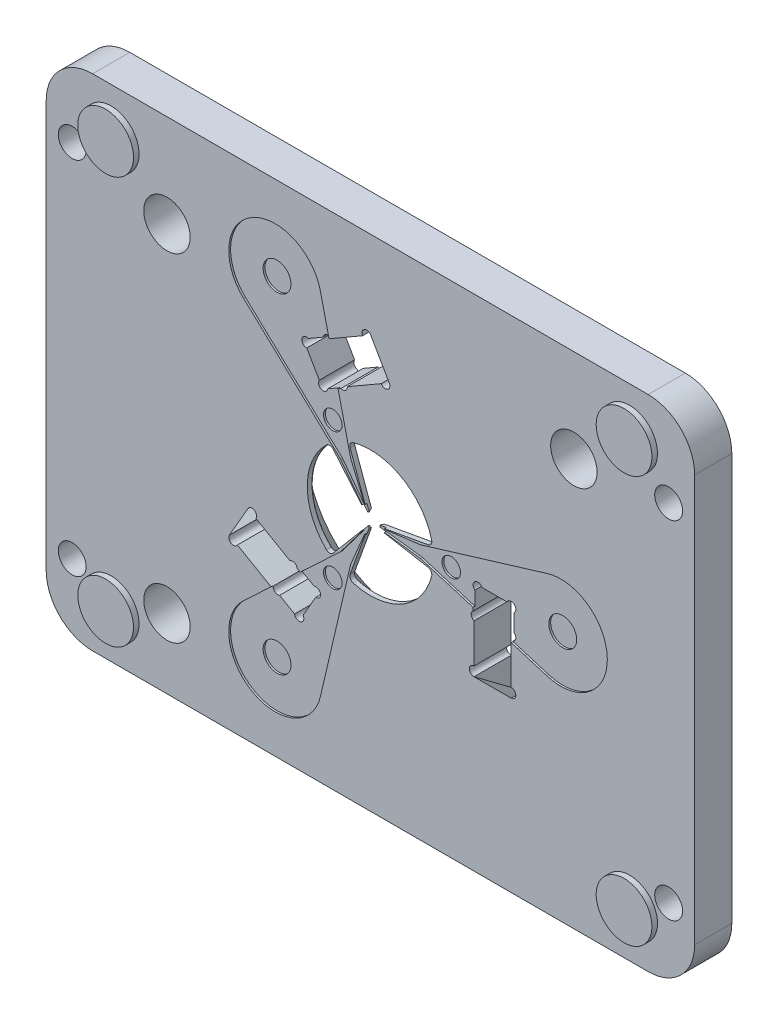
ISO-10303-21;
HEADER;
FILE_DESCRIPTION(('STEP AP214'),'2;1');
FILE_NAME('part.step','',(''),(''),'','','');
FILE_SCHEMA(('AUTOMOTIVE_DESIGN { 1 0 10303 214 1 1 1 1 }'));
ENDSEC;
DATA;
#1=APPLICATION_CONTEXT('core data for automotive mechanical design processes');
#2=APPLICATION_PROTOCOL_DEFINITION('international standard','automotive_design',2000,#1);
#3=PRODUCT_CONTEXT('',#1,'mechanical');
#4=PRODUCT('Part','Part','',(#3));
#5=PRODUCT_RELATED_PRODUCT_CATEGORY('part','',(#4));
#6=PRODUCT_DEFINITION_FORMATION('','',#4);
#7=PRODUCT_DEFINITION_CONTEXT('part definition',#1,'design');
#8=PRODUCT_DEFINITION('design','',#6,#7);
#9=PRODUCT_DEFINITION_SHAPE('','',#8);
#10=(LENGTH_UNIT() NAMED_UNIT(*) SI_UNIT(.MILLI.,.METRE.));
#11=(NAMED_UNIT(*) PLANE_ANGLE_UNIT() SI_UNIT($,.RADIAN.));
#12=(NAMED_UNIT(*) SI_UNIT($,.STERADIAN.) SOLID_ANGLE_UNIT());
#13=UNCERTAINTY_MEASURE_WITH_UNIT(LENGTH_MEASURE(1.E-05),#10,'distance_accuracy_value','');
#14=(GEOMETRIC_REPRESENTATION_CONTEXT(3) GLOBAL_UNCERTAINTY_ASSIGNED_CONTEXT((#13)) GLOBAL_UNIT_ASSIGNED_CONTEXT((#10,
#11,#12)) REPRESENTATION_CONTEXT('',''));
#15=CARTESIAN_POINT('',(0.,0.,0.));
#16=DIRECTION('',(0.,0.,1.));
#17=DIRECTION('',(1.,0.,0.));
#18=AXIS2_PLACEMENT_3D('',#15,#16,#17);
#19=CARTESIAN_POINT('',(0.,0.,4.25));
#20=DIRECTION('',(0.,0.,-1.));
#21=DIRECTION('',(-1.,0.,0.));
#22=AXIS2_PLACEMENT_3D('',#19,#20,#21);
#23=CONICAL_SURFACE('',#22,0.553,0.523598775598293);
#24=CARTESIAN_POINT('',(-0.388920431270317,0.906509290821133,3.4993));
#25=CARTESIAN_POINT('',(-0.370292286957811,0.854884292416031,3.5941839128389));
#26=CARTESIAN_POINT('',(-0.351662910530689,0.803255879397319,3.68906579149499));
#27=CARTESIAN_POINT('',(-0.314389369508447,0.699958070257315,3.8788054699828));
#28=CARTESIAN_POINT('',(-0.295745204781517,0.648288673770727,3.97366326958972));
#29=CARTESIAN_POINT('',(-0.258434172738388,0.544886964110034,4.16331235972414));
#30=CARTESIAN_POINT('',(-0.239767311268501,0.493154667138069,4.25810366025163));
#31=CARTESIAN_POINT('',(-0.202379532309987,0.389540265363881,4.44759350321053));
#32=CARTESIAN_POINT('',(-0.183658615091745,0.337658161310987,4.54229204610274));
#33=CARTESIAN_POINT('',(-0.158654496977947,0.268363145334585,4.66787785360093));
#34=CARTESIAN_POINT('',(-0.152459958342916,0.251195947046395,4.69891815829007));
#35=CARTESIAN_POINT('',(-0.140028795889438,0.216744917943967,4.76092933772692));
#36=CARTESIAN_POINT('',(-0.133792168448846,0.199461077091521,4.79190020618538));
#37=CARTESIAN_POINT('',(-0.119681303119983,0.160355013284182,4.8614216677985));
#38=CARTESIAN_POINT('',(-0.111786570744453,0.138475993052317,4.89993621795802));
#39=CARTESIAN_POINT('',(-0.0986595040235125,0.102096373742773,4.96211862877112));
#40=CARTESIAN_POINT('',(-0.0935309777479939,0.0878834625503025,4.98597228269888));
#41=CARTESIAN_POINT('',(-0.0865037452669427,0.0684085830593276,5.01685248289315));
#42=CARTESIAN_POINT('',(-0.0847920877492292,0.0636649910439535,5.02424191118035));
#43=CARTESIAN_POINT('',(-0.0813010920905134,0.0539902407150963,5.03885970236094));
#44=CARTESIAN_POINT('',(-0.0795218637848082,0.0490593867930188,5.0460882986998));
#45=CARTESIAN_POINT('',(-0.07532165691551,0.0374191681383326,5.06237940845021));
#46=CARTESIAN_POINT('',(-0.0728639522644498,0.0306080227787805,5.07136735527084));
#47=CARTESIAN_POINT('',(-0.068838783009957,0.019452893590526,5.08403698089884));
#48=CARTESIAN_POINT('',(-0.0674293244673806,0.0155467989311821,5.08815117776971));
#49=CARTESIAN_POINT('',(-0.0644234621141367,0.00721651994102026,5.09574284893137));
#50=CARTESIAN_POINT('',(-0.0628286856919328,0.00279684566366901,5.09922526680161));
#51=CARTESIAN_POINT('',(-0.0604180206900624,-0.00388393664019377,5.10301026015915));
#52=CARTESIAN_POINT('',(-0.0597222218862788,-0.00581223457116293,5.10395508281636));
#53=CARTESIAN_POINT('',(-0.0582904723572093,-0.00978010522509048,5.10551272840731));
#54=CARTESIAN_POINT('',(-0.0575547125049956,-0.0118191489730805,5.10612699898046));
#55=CARTESIAN_POINT('',(-0.0564181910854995,-0.0149688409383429,5.10674317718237));
#56=CARTESIAN_POINT('',(-0.05602669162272,-0.0160538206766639,5.10689752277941));
#57=CARTESIAN_POINT('',(-0.0552384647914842,-0.0182382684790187,5.10708846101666));
#58=CARTESIAN_POINT('',(-0.0548417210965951,-0.0193377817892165,5.10712446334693));
#59=CARTESIAN_POINT('',(-0.05444512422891,-0.0204368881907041,5.10709766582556));
#60=B_SPLINE_CURVE_WITH_KNOTS('',3,(#24,#25,#26,#27,#28,#29,#30,#31,#32,#33,#34,#35,#36,#37,#38,
#39,#40,#41,#42,#43,#44,#45,#46,#47,#48,#49,#50,#51,#52,#53,#54,#55,#56,#57,#58,#59),
.UNSPECIFIED.,.F.,.F.,(4,2,2,2,2,2,2,2,2,2,2,2,2,2,2,2,2,4),(0.,0.328840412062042,
0.657683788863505,0.986455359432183,1.3152252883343,1.42324955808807,1.53128324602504,
1.66626090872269,1.7509548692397,1.77778906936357,1.80458137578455,1.83912612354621,
1.85665041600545,1.87403103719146,1.88078279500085,1.88750473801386,1.89099036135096,
1.89449334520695),.UNSPECIFIED.);
#61=CARTESIAN_POINT('',(-0.388783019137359,0.906128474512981,3.5));
#62=VERTEX_POINT('',#61);
#63=CARTESIAN_POINT('',(-0.329870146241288,0.742860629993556,3.8));
#64=VERTEX_POINT('',#63);
#65=EDGE_CURVE('E2030',#62,#64,#60,.T.);
#66=ORIENTED_EDGE('',*,*,#65,.T.);
#67=CARTESIAN_POINT('',(0.,0.,3.8));
#68=DIRECTION('',(0.,0.,1.));
#69=DIRECTION('',(1.,0.,0.));
#70=AXIS2_PLACEMENT_3D('',#67,#68,#69);
#71=CIRCLE('',#70,0.812807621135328);
#72=CARTESIAN_POINT('',(-0.478401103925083,0.657106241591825,3.8));
#73=VERTEX_POINT('',#72);
#74=EDGE_CURVE('E12',#73,#64,#71,.F.);
#75=ORIENTED_EDGE('',*,*,#74,.F.);
#76=CARTESIAN_POINT('',(0.0450321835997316,0.0368011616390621,5.10709342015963));
#77=CARTESIAN_POINT('',(0.0435718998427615,0.0385317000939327,5.10716564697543));
#78=CARTESIAN_POINT('',(0.0421164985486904,0.0402564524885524,5.10698801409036));
#79=CARTESIAN_POINT('',(0.0392820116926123,0.0436155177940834,5.10622341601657));
#80=CARTESIAN_POINT('',(0.037901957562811,0.0452509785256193,5.10564535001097));
#81=CARTESIAN_POINT('',(0.0346988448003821,0.0490468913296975,5.10387960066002));
#82=CARTESIAN_POINT('',(0.0329113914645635,0.0511651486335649,5.10254247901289));
#83=CARTESIAN_POINT('',(0.0294708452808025,0.0552424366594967,5.09946500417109));
#84=CARTESIAN_POINT('',(0.0278193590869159,0.0571995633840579,5.09772056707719));
#85=CARTESIAN_POINT('',(0.0231520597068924,0.0627306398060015,5.09225020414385));
#86=CARTESIAN_POINT('',(0.0203010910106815,0.0661092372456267,5.08819418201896));
#87=CARTESIAN_POINT('',(0.0148596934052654,0.0725576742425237,5.07967509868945));
#88=CARTESIAN_POINT('',(0.0122704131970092,0.0756261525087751,5.07521039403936));
#89=CARTESIAN_POINT('',(0.00471255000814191,0.0845827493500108,5.06144277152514));
#90=CARTESIAN_POINT('',(-1.04328345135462E-05,0.0901798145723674,5.05181851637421));
#91=CARTESIAN_POINT('',(-0.00906940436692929,0.100915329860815,5.03247004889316));
#92=CARTESIAN_POINT('',(-0.0134114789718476,0.106060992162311,5.02275229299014));
#93=CARTESIAN_POINT('',(-0.0219374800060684,0.116164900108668,5.00315023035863));
#94=CARTESIAN_POINT('',(-0.0261214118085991,0.12112315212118,4.99326592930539));
#95=CARTESIAN_POINT('',(-0.0385465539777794,0.135847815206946,4.96344684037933));
#96=CARTESIAN_POINT('',(-0.0466485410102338,0.145449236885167,4.94337420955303));
#97=CARTESIAN_POINT('',(-0.0626329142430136,0.164391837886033,4.90321182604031));
#98=CARTESIAN_POINT('',(-0.0705164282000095,0.173734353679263,4.88312314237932));
#99=CARTESIAN_POINT('',(-0.0861865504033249,0.192304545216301,4.8428723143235));
#100=CARTESIAN_POINT('',(-0.0939732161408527,0.201532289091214,4.82271022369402));
#101=CARTESIAN_POINT('',(-0.117252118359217,0.229119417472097,4.76215370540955));
#102=CARTESIAN_POINT('',(-0.13266456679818,0.247384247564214,4.72168569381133));
#103=CARTESIAN_POINT('',(-0.163396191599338,0.283803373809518,4.64066444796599));
#104=CARTESIAN_POINT('',(-0.178715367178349,0.301957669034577,4.6001112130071));
#105=CARTESIAN_POINT('',(-0.224606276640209,0.356341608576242,4.47836388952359));
#106=CARTESIAN_POINT('',(-0.255103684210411,0.392483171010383,4.39710245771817));
#107=CARTESIAN_POINT('',(-0.316089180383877,0.464755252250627,4.2343492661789));
#108=CARTESIAN_POINT('',(-0.346577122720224,0.500885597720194,4.15285737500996));
#109=CARTESIAN_POINT('',(-0.407513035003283,0.573098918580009,3.9898446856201));
#110=CARTESIAN_POINT('',(-0.437961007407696,0.609181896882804,3.90832388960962));
#111=CARTESIAN_POINT('',(-0.488783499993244,0.669410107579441,3.77219100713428));
#112=CARTESIAN_POINT('',(-0.509163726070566,0.693562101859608,3.71758403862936));
#113=CARTESIAN_POINT('',(-0.54989669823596,0.741833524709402,3.6084187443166));
#114=CARTESIAN_POINT('',(-0.570249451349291,0.765952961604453,3.55386042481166));
#115=CARTESIAN_POINT('',(-0.590599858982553,0.790069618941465,3.4993));
#116=B_SPLINE_CURVE_WITH_KNOTS('',3,(#76,#77,#78,#79,#80,#81,#82,#83,#84,#85,#86,#87,#88,#89,
#90,#91,#92,#93,#94,#95,#96,#97,#98,#99,#100,#101,#102,#103,#104,#105,#106,#107,#108,#109,#110,
#111,#112,#113,#114,#115),.UNSPECIFIED.,.F.,.F.,(4,2,2,2,2,2,2,2,2,2,2,2,2,2,2,2,2,2,2,4),(0.,
0.00676052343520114,0.0133754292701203,0.0225540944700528,0.031829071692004,0.0497584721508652,
0.0677634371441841,0.103999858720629,0.139467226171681,0.174933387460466,0.245968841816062,
0.316515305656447,0.387017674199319,0.528010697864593,0.669004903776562,0.951063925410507,
1.23369906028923,1.51631591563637,1.70559174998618,1.89467725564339),.UNSPECIFIED.);
#117=CARTESIAN_POINT('',(-0.590338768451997,0.789760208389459,3.5));
#118=VERTEX_POINT('',#117);
#119=EDGE_CURVE('E2037',#73,#118,#116,.T.);
#120=ORIENTED_EDGE('',*,*,#119,.T.);
#121=CARTESIAN_POINT('',(0.,0.,3.5));
#122=DIRECTION('',(0.,0.,-1.));
#123=DIRECTION('',(-1.,0.,0.));
#124=AXIS2_PLACEMENT_3D('',#121,#122,#123);
#125=CIRCLE('',#124,0.986012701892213);
#126=EDGE_CURVE('E3777',#62,#118,#125,.F.);
#127=ORIENTED_EDGE('',*,*,#126,.F.);
#128=EDGE_LOOP('',(#66,#75,#120,#127));
#129=FACE_BOUND('',#128,.T.);
#130=ADVANCED_FACE('F441',(#129),#23,.F.);
#131=CARTESIAN_POINT('',(-0.590599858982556,-0.790069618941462,3.4993));
#132=CARTESIAN_POINT('',(-0.555205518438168,-0.748124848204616,3.59418351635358));
#133=CARTESIAN_POINT('',(-0.519808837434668,-0.706177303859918,3.68906499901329));
#134=CARTESIAN_POINT('',(-0.448987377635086,-0.622248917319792,3.87880388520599));
#135=CARTESIAN_POINT('',(-0.413562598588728,-0.58026807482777,3.97366128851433));
#136=CARTESIAN_POINT('',(-0.342669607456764,-0.496254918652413,4.16331037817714));
#137=CARTESIAN_POINT('',(-0.307201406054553,-0.454222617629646,4.25810207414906));
#138=CARTESIAN_POINT('',(-0.236162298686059,-0.370036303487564,4.44759271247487));
#139=CARTESIAN_POINT('',(-0.200591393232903,-0.327882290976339,4.54229165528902));
#140=CARTESIAN_POINT('',(-0.153113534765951,-0.271617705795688,4.66779462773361));
#141=CARTESIAN_POINT('',(-0.141375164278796,-0.257706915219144,4.6987518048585));
#142=CARTESIAN_POINT('',(-0.117819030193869,-0.22979124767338,4.76059713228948));
#143=CARTESIAN_POINT('',(-0.106001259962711,-0.215786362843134,4.79148527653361));
#144=CARTESIAN_POINT('',(-0.0792391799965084,-0.184071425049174,4.86088514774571));
#145=CARTESIAN_POINT('',(-0.0642559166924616,-0.166315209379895,4.89936082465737));
#146=CARTESIAN_POINT('',(-0.0393311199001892,-0.136777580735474,4.96152209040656));
#147=CARTESIAN_POINT('',(-0.0295847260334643,-0.12522742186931,4.98539147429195));
#148=CARTESIAN_POINT('',(-0.016230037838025,-0.109401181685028,5.01630802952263));
#149=CARTESIAN_POINT('',(-0.0129739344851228,-0.105542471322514,5.0237145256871));
#150=CARTESIAN_POINT('',(-0.00633390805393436,-0.0976735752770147,5.03836802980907));
#151=CARTESIAN_POINT('',(-0.00295018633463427,-0.09366362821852,5.0456152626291));
#152=CARTESIAN_POINT('',(0.00504085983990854,-0.0841936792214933,5.06196241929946));
#153=CARTESIAN_POINT('',(0.00971779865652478,-0.0786511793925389,5.07098803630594));
#154=CARTESIAN_POINT('',(0.0173719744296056,-0.0695804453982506,5.0837214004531));
#155=CARTESIAN_POINT('',(0.0200506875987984,-0.0664059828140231,5.08785749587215));
#156=CARTESIAN_POINT('',(0.0257610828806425,-0.0596387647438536,5.09550207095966));
#157=CARTESIAN_POINT('',(0.0287898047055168,-0.0560495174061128,5.09901525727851));
#158=CARTESIAN_POINT('',(0.0333698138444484,-0.0506218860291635,5.10285713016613));
#159=CARTESIAN_POINT('',(0.0346925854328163,-0.0490543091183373,5.10381972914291));
#160=CARTESIAN_POINT('',(0.0374154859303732,-0.0458274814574,5.10541532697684));
#161=CARTESIAN_POINT('',(0.038815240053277,-0.0441686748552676,5.10604978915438));
#162=CARTESIAN_POINT('',(0.0410267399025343,-0.0415478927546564,5.10671098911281));
#163=CARTESIAN_POINT('',(0.0418208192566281,-0.0406068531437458,5.10688265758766));
#164=CARTESIAN_POINT('',(0.0434208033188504,-0.0387107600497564,5.1070919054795));
#165=CARTESIAN_POINT('',(0.0442267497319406,-0.0377556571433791,5.10712871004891));
#166=CARTESIAN_POINT('',(0.0450321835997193,-0.0368011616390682,5.10709342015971));
#167=B_SPLINE_CURVE_WITH_KNOTS('',3,(#131,#132,#133,#134,#135,#136,#137,#138,#139,#140,#141,
#142,#143,#144,#145,#146,#147,#148,#149,#150,#151,#152,#153,#154,#155,#156,#157,#158,#159,#160,
#161,#162,#163,#164,#165,#166),.UNSPECIFIED.,.F.,.F.,(4,2,2,2,2,2,2,2,2,2,2,2,2,2,2,2,2,4),(0.,
0.32883903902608,0.657681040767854,0.986453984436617,1.31522528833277,1.42296009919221,
1.53070402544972,1.66554059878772,1.75027944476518,1.77716614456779,1.80401206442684,
1.83866716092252,1.85624025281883,1.87367431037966,1.8804519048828,1.88719900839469,
1.89092181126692,1.89466596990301),.UNSPECIFIED.);
#168=CARTESIAN_POINT('',(-0.590338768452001,-0.789760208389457,3.5));
#169=VERTEX_POINT('',#168);
#170=CARTESIAN_POINT('',(-0.478401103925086,-0.657106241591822,3.8));
#171=VERTEX_POINT('',#170);
#172=EDGE_CURVE('E3776',#169,#171,#167,.T.);
#173=ORIENTED_EDGE('',*,*,#172,.T.);
#174=CARTESIAN_POINT('',(0.,0.,3.8));
#175=DIRECTION('',(0.,0.,1.));
#176=DIRECTION('',(1.,0.,0.));
#177=AXIS2_PLACEMENT_3D('',#174,#175,#176);
#178=CIRCLE('',#177,0.812807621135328);
#179=CARTESIAN_POINT('',(-0.329870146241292,-0.742860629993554,3.8));
#180=VERTEX_POINT('',#179);
#181=EDGE_CURVE('E462',#180,#171,#178,.F.);
#182=ORIENTED_EDGE('',*,*,#181,.F.);
#183=CARTESIAN_POINT('',(-0.0544451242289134,0.0204368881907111,5.10709766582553));
#184=CARTESIAN_POINT('',(-0.0552169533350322,0.0182978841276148,5.10715842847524));
#185=CARTESIAN_POINT('',(-0.0559856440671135,0.0161675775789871,5.10696753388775));
#186=CARTESIAN_POINT('',(-0.0574818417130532,0.0120210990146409,5.1061753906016));
#187=CARTESIAN_POINT('',(-0.0582098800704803,0.0100034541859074,5.1055831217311));
#188=CARTESIAN_POINT('',(-0.0599049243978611,0.00530590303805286,5.10377824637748));
#189=CARTESIAN_POINT('',(-0.0608524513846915,0.00267997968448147,5.10241288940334));
#190=CARTESIAN_POINT('',(-0.0626758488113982,-0.00237328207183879,5.0992773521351));
#191=CARTESIAN_POINT('',(-0.0635508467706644,-0.00479820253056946,5.09750300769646));
#192=CARTESIAN_POINT('',(-0.0660499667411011,-0.0117241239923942,5.09188579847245));
#193=CARTESIAN_POINT('',(-0.0675826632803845,-0.0159717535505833,5.08769841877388));
#194=CARTESIAN_POINT('',(-0.0705081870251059,-0.0240793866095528,5.07891255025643));
#195=CARTESIAN_POINT('',(-0.0719003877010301,-0.0279376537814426,5.07431237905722));
#196=CARTESIAN_POINT('',(-0.0746059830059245,-0.0354357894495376,5.06485628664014));
#197=CARTESIAN_POINT('',(-0.0759187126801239,-0.0390738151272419,5.05999871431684));
#198=CARTESIAN_POINT('',(-0.0784820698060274,-0.046177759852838,5.0501624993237));
#199=CARTESIAN_POINT('',(-0.0797328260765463,-0.0496440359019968,5.04518414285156));
#200=CARTESIAN_POINT('',(-0.0833752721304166,-0.059738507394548,5.03032817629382));
#201=CARTESIAN_POINT('',(-0.0857106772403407,-0.0662107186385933,5.02033121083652));
#202=CARTESIAN_POINT('',(-0.0903001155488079,-0.0789296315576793,5.00017579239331));
#203=CARTESIAN_POINT('',(-0.0925541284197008,-0.0851762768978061,4.99001729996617));
#204=CARTESIAN_POINT('',(-0.0992487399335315,-0.103729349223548,4.95937675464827));
#205=CARTESIAN_POINT('',(-0.103615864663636,-0.115832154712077,4.93875566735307));
#206=CARTESIAN_POINT('',(-0.112234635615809,-0.139717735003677,4.89750362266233));
#207=CARTESIAN_POINT('',(-0.116486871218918,-0.151502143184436,4.87687371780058));
#208=CARTESIAN_POINT('',(-0.124940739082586,-0.174930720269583,4.83554114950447));
#209=CARTESIAN_POINT('',(-0.129142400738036,-0.18657497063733,4.81483853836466));
#210=CARTESIAN_POINT('',(-0.141706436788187,-0.221394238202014,4.75265568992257));
#211=CARTESIAN_POINT('',(-0.150027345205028,-0.244454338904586,4.71110295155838));
#212=CARTESIAN_POINT('',(-0.166620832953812,-0.290440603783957,4.62791345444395));
#213=CARTESIAN_POINT('',(-0.174893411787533,-0.313366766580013,4.58627669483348));
#214=CARTESIAN_POINT('',(-0.199676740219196,-0.382049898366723,4.46128007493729));
#215=CARTESIAN_POINT('',(-0.216149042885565,-0.427700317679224,4.37785407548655));
#216=CARTESIAN_POINT('',(-0.249090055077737,-0.518991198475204,4.21077009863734));
#217=CARTESIAN_POINT('',(-0.265558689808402,-0.564631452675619,4.12711199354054));
#218=CARTESIAN_POINT('',(-0.298475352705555,-0.655854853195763,3.95976749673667));
#219=CARTESIAN_POINT('',(-0.314923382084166,-0.701438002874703,3.8760811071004));
#220=CARTESIAN_POINT('',(-0.34096588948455,-0.773610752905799,3.7435213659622));
#221=CARTESIAN_POINT('',(-0.350563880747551,-0.800210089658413,3.69465400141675));
#222=CARTESIAN_POINT('',(-0.369748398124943,-0.853376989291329,3.59695833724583));
#223=CARTESIAN_POINT('',(-0.379334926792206,-0.87994455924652,3.54813004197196));
#224=CARTESIAN_POINT('',(-0.388920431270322,-0.906509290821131,3.4993));
#225=B_SPLINE_CURVE_WITH_KNOTS('',3,(#183,#184,#185,#186,#187,#188,#189,#190,#191,#192,#193,
#194,#195,#196,#197,#198,#199,#200,#201,#202,#203,#204,#205,#206,#207,#208,#209,#210,#211,#212,
#213,#214,#215,#216,#217,#218,#219,#220,#221,#222,#223,#224),.UNSPECIFIED.,.F.,.F.,(4,2,2,2,2,2,
2,2,2,2,2,2,2,2,2,2,2,2,2,2,4),(0.,0.00678772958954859,0.0134284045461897,0.022697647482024,
0.0320657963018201,0.0504693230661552,0.0689515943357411,0.0875716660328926,0.106151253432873,
0.142550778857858,0.178959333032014,0.251871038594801,0.324278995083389,0.396642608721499,
0.54137865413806,0.686116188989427,0.97566159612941,1.26579321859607,1.55590688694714,
1.72528513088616,1.89451118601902),.UNSPECIFIED.);
#226=CARTESIAN_POINT('',(-0.388783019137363,-0.906128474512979,3.5));
#227=VERTEX_POINT('',#226);
#228=EDGE_CURVE('E1493',#180,#227,#225,.T.);
#229=ORIENTED_EDGE('',*,*,#228,.T.);
#230=CARTESIAN_POINT('',(0.,0.,3.5));
#231=DIRECTION('',(0.,0.,-1.));
#232=DIRECTION('',(-1.,0.,0.));
#233=AXIS2_PLACEMENT_3D('',#230,#231,#232);
#234=CIRCLE('',#233,0.986012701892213);
#235=EDGE_CURVE('E3782',#169,#227,#234,.F.);
#236=ORIENTED_EDGE('',*,*,#235,.F.);
#237=EDGE_LOOP('',(#173,#182,#229,#236));
#238=FACE_BOUND('',#237,.T.);
#239=ADVANCED_FACE('F1466',(#238),#23,.F.);
#240=CARTESIAN_POINT('',(0.,0.,3.8));
#241=DIRECTION('',(0.,0.,1.));
#242=DIRECTION('',(1.,0.,0.));
#243=AXIS2_PLACEMENT_3D('',#240,#241,#242);
#244=CIRCLE('',#243,0.812807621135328);
#245=CARTESIAN_POINT('',(0.808271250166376,0.0857543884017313,3.8));
#246=VERTEX_POINT('',#245);
#247=CARTESIAN_POINT('',(0.808271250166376,-0.0857543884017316,3.8));
#248=VERTEX_POINT('',#247);
#249=EDGE_CURVE('E1484',#246,#248,#244,.F.);
#250=ORIENTED_EDGE('',*,*,#249,.F.);
#251=CARTESIAN_POINT('',(0.00955620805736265,-0.0573634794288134,5.10709838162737));
#252=CARTESIAN_POINT('',(0.0117963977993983,-0.0569620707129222,5.10715692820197));
#253=CARTESIAN_POINT('',(0.0140271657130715,-0.0565623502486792,5.10696347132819));
#254=CARTESIAN_POINT('',(0.0183686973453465,-0.0557844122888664,5.10616600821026));
#255=CARTESIAN_POINT('',(0.020481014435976,-0.05540591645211,5.10557099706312));
#256=CARTESIAN_POINT('',(0.0254019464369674,-0.0545241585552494,5.10375853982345));
#257=CARTESIAN_POINT('',(0.0281536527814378,-0.0540310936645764,5.1023877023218));
#258=CARTESIAN_POINT('',(0.0334487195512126,-0.053082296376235,5.09924088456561));
#259=CARTESIAN_POINT('',(0.0359895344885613,-0.0526270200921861,5.09746072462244));
#260=CARTESIAN_POINT('',(0.0432614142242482,-0.0513240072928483,5.09181475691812));
#261=CARTESIAN_POINT('',(0.0477247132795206,-0.0505242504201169,5.08760165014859));
#262=CARTESIAN_POINT('',(0.0562437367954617,-0.0489977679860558,5.0787631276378));
#263=CARTESIAN_POINT('',(0.0602976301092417,-0.0482713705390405,5.07413602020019));
#264=CARTESIAN_POINT('',(0.0681760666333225,-0.0468596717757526,5.06462552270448));
#265=CARTESIAN_POINT('',(0.0719986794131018,-0.0461747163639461,5.05974048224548));
#266=CARTESIAN_POINT('',(0.0794633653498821,-0.0448371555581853,5.04984933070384));
#267=CARTESIAN_POINT('',(0.0831058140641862,-0.0441844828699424,5.04484350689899));
#268=CARTESIAN_POINT('',(0.0937138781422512,-0.0422836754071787,5.02990614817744));
#269=CARTESIAN_POINT('',(0.100516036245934,-0.0410648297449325,5.0198552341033));
#270=CARTESIAN_POINT('',(0.113884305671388,-0.0386694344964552,4.99959202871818));
#271=CARTESIAN_POINT('',(0.12045035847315,-0.0374928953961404,4.98937969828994));
#272=CARTESIAN_POINT('',(0.139953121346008,-0.0339982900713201,4.95857768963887));
#273=CARTESIAN_POINT('',(0.152676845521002,-0.0317183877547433,4.93784913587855));
#274=CARTESIAN_POINT('',(0.177789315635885,-0.0272186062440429,4.89638328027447));
#275=CARTESIAN_POINT('',(0.19017976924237,-0.0249984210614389,4.87564702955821));
#276=CARTESIAN_POINT('',(0.21481418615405,-0.0205842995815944,4.8341019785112));
#277=CARTESIAN_POINT('',(0.22705823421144,-0.0183903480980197,4.81329323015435));
#278=CARTESIAN_POINT('',(0.263672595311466,-0.0118295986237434,4.75079100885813));
#279=CARTESIAN_POINT('',(0.287922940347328,-0.0074842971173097,4.7090252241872));
#280=CARTESIAN_POINT('',(0.336283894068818,0.00118126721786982,4.62540989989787));
#281=CARTESIAN_POINT('',(0.360394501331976,0.00550152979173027,4.58356035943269));
#282=CARTESIAN_POINT('',(0.432626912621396,0.0184445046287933,4.45792561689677));
#283=CARTESIAN_POINT('',(0.480637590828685,0.0270473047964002,4.37407450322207));
#284=CARTESIAN_POINT('',(0.576649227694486,0.0442511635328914,4.20614003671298));
#285=CARTESIAN_POINT('',(0.624649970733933,0.0528521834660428,4.12205655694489));
#286=CARTESIAN_POINT('',(0.720591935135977,0.0700435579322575,3.95386142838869));
#287=CARTESIAN_POINT('',(0.768533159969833,0.0786339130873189,3.86974978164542));
#288=CARTESIAN_POINT('',(0.843656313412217,0.0920948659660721,3.73789163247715));
#289=CARTESIAN_POINT('',(0.870848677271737,0.0969673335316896,3.69015126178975));
#290=CARTESIAN_POINT('',(0.925201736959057,0.10670659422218,3.59470781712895));
#291=CARTESIAN_POINT('',(0.952362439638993,0.111573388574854,3.54700474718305));
#292=CARTESIAN_POINT('',(0.979520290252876,0.116439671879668,3.4993));
#293=B_SPLINE_CURVE_WITH_KNOTS('',3,(#251,#252,#253,#254,#255,#256,#257,#258,#259,#260,#261,
#262,#263,#264,#265,#266,#267,#268,#269,#270,#271,#272,#273,#274,#275,#276,#277,#278,#279,#280,
#281,#282,#283,#284,#285,#286,#287,#288,#289,#290,#291,#292),.UNSPECIFIED.,.F.,.F.,(4,2,2,2,2,2,
2,2,2,2,2,2,2,2,2,2,2,2,2,2,4),(0.,0.0067930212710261,0.0134387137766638,0.0227255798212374,
0.0321118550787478,0.0506084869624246,0.0691844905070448,0.0878986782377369,0.106572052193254,
0.143155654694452,0.17974826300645,0.253028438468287,0.325802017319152,0.398531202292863,
0.544002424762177,0.689475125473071,0.980490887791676,1.27209462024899,1.56368046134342,
1.72915184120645,1.89447803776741),.UNSPECIFIED.);
#294=CARTESIAN_POINT('',(0.979121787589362,0.116368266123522,3.5));
#295=VERTEX_POINT('',#294);
#296=EDGE_CURVE('E1487',#246,#295,#293,.T.);
#297=ORIENTED_EDGE('',*,*,#296,.T.);
#298=CARTESIAN_POINT('',(0.,0.,3.5));
#299=DIRECTION('',(0.,0.,-1.));
#300=DIRECTION('',(-1.,0.,0.));
#301=AXIS2_PLACEMENT_3D('',#298,#299,#300);
#302=CIRCLE('',#301,0.986012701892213);
#303=CARTESIAN_POINT('',(0.979121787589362,-0.116368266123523,3.5));
#304=VERTEX_POINT('',#303);
#305=EDGE_CURVE('E1510',#304,#295,#302,.F.);
#306=ORIENTED_EDGE('',*,*,#305,.F.);
#307=CARTESIAN_POINT('',(0.979520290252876,-0.116439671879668,3.4993));
#308=CARTESIAN_POINT('',(0.925497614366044,-0.106759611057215,3.59418398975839));
#309=CARTESIAN_POINT('',(0.871471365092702,-0.0970789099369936,3.68906594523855));
#310=CARTESIAN_POINT('',(0.763375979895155,-0.0777098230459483,3.87880577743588));
#311=CARTESIAN_POINT('',(0.709306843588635,-0.068021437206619,3.97366365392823));
#312=CARTESIAN_POINT('',(0.601102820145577,-0.0486328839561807,4.16331274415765));
#313=CARTESIAN_POINT('',(0.546967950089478,-0.0389327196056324,4.25810396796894));
#314=CARTESIAN_POINT('',(0.438541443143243,-0.019504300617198,4.44759365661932));
#315=CARTESIAN_POINT('',(0.384249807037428,-0.0097760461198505,4.54229212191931));
#316=CARTESIAN_POINT('',(0.311727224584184,0.00321892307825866,4.66789400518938));
#317=CARTESIAN_POINT('',(0.293753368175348,0.00643957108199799,4.69895044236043));
#318=CARTESIAN_POINT('',(0.257683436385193,0.0129027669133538,4.76099380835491));
#319=CARTESIAN_POINT('',(0.239587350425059,0.0161453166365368,4.79198073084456));
#320=CARTESIAN_POINT('',(0.198650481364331,0.0234805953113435,4.86152574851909));
#321=CARTESIAN_POINT('',(0.175750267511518,0.0275839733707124,4.90004780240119));
#322=CARTESIAN_POINT('',(0.13767595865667,0.0344063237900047,4.96223424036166));
#323=CARTESIAN_POINT('',(0.122803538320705,0.0370712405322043,4.98608480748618));
#324=CARTESIAN_POINT('',(0.102424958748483,0.0407227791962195,5.01695790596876));
#325=CARTESIAN_POINT('',(0.097462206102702,0.0416120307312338,5.02434401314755));
#326=CARTESIAN_POINT('',(0.0873401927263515,0.0434257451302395,5.03895485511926));
#327=CARTESIAN_POINT('',(0.0821812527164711,0.0443501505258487,5.04617982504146));
#328=CARTESIAN_POINT('',(0.070003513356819,0.046532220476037,5.06246004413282));
#329=CARTESIAN_POINT('',(0.0628781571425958,0.0478089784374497,5.07144067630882));
#330=CARTESIAN_POINT('',(0.0512067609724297,0.0499003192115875,5.08409792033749));
#331=CARTESIAN_POINT('',(0.0471194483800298,0.0506327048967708,5.08820786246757));
#332=CARTESIAN_POINT('',(0.0384020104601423,0.0521947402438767,5.09578924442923));
#333=CARTESIAN_POINT('',(0.0337766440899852,0.0530235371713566,5.0992656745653));
#334=CARTESIAN_POINT('',(0.0267854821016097,0.0542762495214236,5.10303961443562));
#335=CARTESIAN_POINT('',(0.0247678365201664,0.0546377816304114,5.10398098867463));
#336=CARTESIAN_POINT('',(0.0206164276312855,0.0553816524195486,5.10553127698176));
#337=CARTESIAN_POINT('',(0.0184832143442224,0.0557638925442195,5.10614163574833));
#338=CARTESIAN_POINT('',(0.015202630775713,0.0563517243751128,5.10674925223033));
#339=CARTESIAN_POINT('',(0.0140820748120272,0.0565525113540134,5.10690034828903));
#340=CARTESIAN_POINT('',(0.0118263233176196,0.0569567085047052,5.10708782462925));
#341=CARTESIAN_POINT('',(0.0106910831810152,0.0571601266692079,5.10712364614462));
#342=CARTESIAN_POINT('',(0.00955620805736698,0.0573634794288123,5.1070983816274));
#343=B_SPLINE_CURVE_WITH_KNOTS('',3,(#307,#308,#309,#310,#311,#312,#313,#314,#315,#316,#317,
#318,#319,#320,#321,#322,#323,#324,#325,#326,#327,#328,#329,#330,#331,#332,#333,#334,#335,#336,
#337,#338,#339,#340,#341,#342),.UNSPECIFIED.,.F.,.F.,(4,2,2,2,2,2,2,2,2,2,2,2,2,2,2,2,2,4),(0.,
0.328840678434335,0.657684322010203,0.986455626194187,1.3152252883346,1.42330573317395,
1.53139565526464,1.66640056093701,1.75108569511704,1.77790967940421,1.80469155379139,
1.83921488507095,1.85672971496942,1.87409997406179,1.88084676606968,1.88756387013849,
1.89100367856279,1.89446013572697),.UNSPECIFIED.);
#344=EDGE_CURVE('E1490',#304,#248,#343,.T.);
#345=ORIENTED_EDGE('',*,*,#344,.T.);
#346=EDGE_LOOP('',(#250,#297,#306,#345));
#347=FACE_BOUND('',#346,.T.);
#348=ADVANCED_FACE('F1468',(#347),#23,.F.);
#349=CARTESIAN_POINT('',(0.,0.,0.));
#350=DIRECTION('',(0.,0.,1.));
#351=DIRECTION('',(1.,0.,0.));
#352=AXIS2_PLACEMENT_3D('',#349,#350,#351);
#353=PLANE('',#352);
#354=DIRECTION('',(0.,-1.,0.));
#355=VECTOR('',#354,1.);
#356=CARTESIAN_POINT('',(-34.9,0.,0.));
#357=LINE('',#356,#355);
#358=CARTESIAN_POINT('',(-34.9,21.9,0.));
#359=VERTEX_POINT('',#358);
#360=CARTESIAN_POINT('',(-34.9,-21.9,0.));
#361=VERTEX_POINT('',#360);
#362=EDGE_CURVE('E1348',#359,#361,#357,.T.);
#363=ORIENTED_EDGE('',*,*,#362,.F.);
#364=CARTESIAN_POINT('',(-29.9,21.9,0.));
#365=DIRECTION('',(0.,0.,1.));
#366=DIRECTION('',(1.,0.,0.));
#367=AXIS2_PLACEMENT_3D('',#364,#365,#366);
#368=CIRCLE('',#367,5.);
#369=CARTESIAN_POINT('',(-29.9,26.9,0.));
#370=VERTEX_POINT('',#369);
#371=EDGE_CURVE('E1314',#359,#370,#368,.F.);
#372=ORIENTED_EDGE('',*,*,#371,.T.);
#373=DIRECTION('',(1.,0.,0.));
#374=VECTOR('',#373,1.);
#375=CARTESIAN_POINT('',(0.,26.9,0.));
#376=LINE('',#375,#374);
#377=CARTESIAN_POINT('',(29.9,26.9,0.));
#378=VERTEX_POINT('',#377);
#379=EDGE_CURVE('E1331',#370,#378,#376,.T.);
#380=ORIENTED_EDGE('',*,*,#379,.T.);
#381=CARTESIAN_POINT('',(29.9,21.9,0.));
#382=DIRECTION('',(0.,0.,1.));
#383=DIRECTION('',(1.,0.,0.));
#384=AXIS2_PLACEMENT_3D('',#381,#382,#383);
#385=CIRCLE('',#384,5.);
#386=CARTESIAN_POINT('',(34.9,21.9,0.));
#387=VERTEX_POINT('',#386);
#388=EDGE_CURVE('E1334',#378,#387,#385,.F.);
#389=ORIENTED_EDGE('',*,*,#388,.T.);
#390=DIRECTION('',(0.,-1.,0.));
#391=VECTOR('',#390,1.);
#392=CARTESIAN_POINT('',(34.9,0.,0.));
#393=LINE('',#392,#391);
#394=CARTESIAN_POINT('',(34.9,-21.9,0.));
#395=VERTEX_POINT('',#394);
#396=EDGE_CURVE('E1337',#387,#395,#393,.T.);
#397=ORIENTED_EDGE('',*,*,#396,.T.);
#398=CARTESIAN_POINT('',(29.9,-21.9,0.));
#399=DIRECTION('',(0.,0.,1.));
#400=DIRECTION('',(1.,0.,0.));
#401=AXIS2_PLACEMENT_3D('',#398,#399,#400);
#402=CIRCLE('',#401,5.);
#403=CARTESIAN_POINT('',(29.9,-26.9,0.));
#404=VERTEX_POINT('',#403);
#405=EDGE_CURVE('E1340',#395,#404,#402,.F.);
#406=ORIENTED_EDGE('',*,*,#405,.T.);
#407=DIRECTION('',(1.,0.,0.));
#408=VECTOR('',#407,1.);
#409=CARTESIAN_POINT('',(0.,-26.9,0.));
#410=LINE('',#409,#408);
#411=CARTESIAN_POINT('',(-29.9,-26.9,0.));
#412=VERTEX_POINT('',#411);
#413=EDGE_CURVE('E1343',#412,#404,#410,.T.);
#414=ORIENTED_EDGE('',*,*,#413,.F.);
#415=CARTESIAN_POINT('',(-29.9,-21.9,0.));
#416=DIRECTION('',(0.,0.,1.));
#417=DIRECTION('',(1.,0.,0.));
#418=AXIS2_PLACEMENT_3D('',#415,#416,#417);
#419=CIRCLE('',#418,5.);
#420=EDGE_CURVE('E1345',#412,#361,#419,.F.);
#421=ORIENTED_EDGE('',*,*,#420,.T.);
#422=EDGE_LOOP('',(#363,#372,#380,#389,#397,#406,#414,#421));
#423=FACE_BOUND('',#422,.T.);
#424=CARTESIAN_POINT('',(32.1,17.9,0.));
#425=DIRECTION('',(0.,0.,1.));
#426=DIRECTION('',(1.,0.,0.));
#427=AXIS2_PLACEMENT_3D('',#424,#425,#426);
#428=CIRCLE('',#427,1.5);
#429=CARTESIAN_POINT('',(33.6,17.9,0.));
#430=VERTEX_POINT('',#429);
#431=EDGE_CURVE('E1122',#430,#430,#428,.T.);
#432=ORIENTED_EDGE('',*,*,#431,.T.);
#433=EDGE_LOOP('',(#432));
#434=FACE_BOUND('',#433,.T.);
#435=CARTESIAN_POINT('',(-32.1,-19.4,0.));
#436=DIRECTION('',(0.,0.,1.));
#437=DIRECTION('',(-1.,0.,0.));
#438=AXIS2_PLACEMENT_3D('',#435,#436,#437);
#439=CIRCLE('',#438,1.5);
#440=CARTESIAN_POINT('',(-33.6,-19.4,0.));
#441=VERTEX_POINT('',#440);
#442=EDGE_CURVE('E1557',#441,#441,#439,.T.);
#443=ORIENTED_EDGE('',*,*,#442,.T.);
#444=EDGE_LOOP('',(#443));
#445=FACE_BOUND('',#444,.T.);
#446=CARTESIAN_POINT('',(-32.1,19.4,0.));
#447=DIRECTION('',(0.,0.,1.));
#448=DIRECTION('',(1.,0.,0.));
#449=AXIS2_PLACEMENT_3D('',#446,#447,#448);
#450=CIRCLE('',#449,1.5);
#451=CARTESIAN_POINT('',(-30.6,19.4,0.));
#452=VERTEX_POINT('',#451);
#453=EDGE_CURVE('E1567',#452,#452,#450,.T.);
#454=ORIENTED_EDGE('',*,*,#453,.T.);
#455=EDGE_LOOP('',(#454));
#456=FACE_BOUND('',#455,.T.);
#457=CARTESIAN_POINT('',(32.1,-19.4,0.));
#458=DIRECTION('',(0.,0.,1.));
#459=DIRECTION('',(1.,0.,0.));
#460=AXIS2_PLACEMENT_3D('',#457,#458,#459);
#461=CIRCLE('',#460,1.5);
#462=CARTESIAN_POINT('',(33.6,-19.4,0.));
#463=VERTEX_POINT('',#462);
#464=EDGE_CURVE('E1560',#463,#463,#461,.T.);
#465=ORIENTED_EDGE('',*,*,#464,.T.);
#466=EDGE_LOOP('',(#465));
#467=FACE_BOUND('',#466,.T.);
#468=CARTESIAN_POINT('',(-0.405546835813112,17.25957058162,0.));
#469=DIRECTION('',(0.,0.,1.));
#470=DIRECTION('',(1.,0.,0.));
#471=AXIS2_PLACEMENT_3D('',#468,#469,#470);
#472=CIRCLE('',#471,0.500000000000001);
#473=CARTESIAN_POINT('',(0.0274658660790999,17.50957058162,0.));
#474=VERTEX_POINT('',#473);
#475=CARTESIAN_POINT('',(-0.838559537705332,17.00957058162,0.));
#476=VERTEX_POINT('',#475);
#477=EDGE_CURVE('E1164',#474,#476,#472,.T.);
#478=ORIENTED_EDGE('',*,*,#477,.T.);
#479=DIRECTION('',(-0.86602540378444,-0.499999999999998,0.));
#480=VECTOR('',#479,1.);
#481=CARTESIAN_POINT('',(-7.57499999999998,13.1202848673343,0.));
#482=LINE('',#481,#480);
#483=CARTESIAN_POINT('',(-4.48727265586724,14.9029850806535,0.));
#484=VERTEX_POINT('',#483);
#485=EDGE_CURVE('E3554',#476,#484,#482,.T.);
#486=ORIENTED_EDGE('',*,*,#485,.T.);
#487=CARTESIAN_POINT('',(-4.78413535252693,14.5006512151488,0.));
#488=DIRECTION('',(0.,0.,-1.));
#489=DIRECTION('',(-1.,0.,0.));
#490=AXIS2_PLACEMENT_3D('',#487,#488,#489);
#491=CIRCLE('',#490,0.500000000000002);
#492=CARTESIAN_POINT('',(-5.2805455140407,14.5604588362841,0.));
#493=VERTEX_POINT('',#492);
#494=EDGE_CURVE('E1187',#493,#484,#491,.T.);
#495=ORIENTED_EDGE('',*,*,#494,.F.);
#496=DIRECTION('',(0.86602540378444,0.499999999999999,0.));
#497=VECTOR('',#496,1.);
#498=CARTESIAN_POINT('',(-7.62499999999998,13.2068874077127,0.));
#499=LINE('',#498,#497);
#500=CARTESIAN_POINT('',(-6.88887840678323,13.6318874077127,0.));
#501=VERTEX_POINT('',#500);
#502=EDGE_CURVE('E1250',#501,#493,#499,.T.);
#503=ORIENTED_EDGE('',*,*,#502,.F.);
#504=CARTESIAN_POINT('',(-7.085288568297,13.1720797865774,0.));
#505=DIRECTION('',(0.,0.,1.));
#506=DIRECTION('',(1.,0.,0.));
#507=AXIS2_PLACEMENT_3D('',#504,#505,#506);
#508=CIRCLE('',#507,0.500000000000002);
#509=CARTESIAN_POINT('',(-7.05290328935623,12.6731296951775,0.));
#510=VERTEX_POINT('',#509);
#511=EDGE_CURVE('E1256',#501,#510,#508,.T.);
#512=ORIENTED_EDGE('',*,*,#511,.T.);
#513=DIRECTION('',(0.5,-0.866025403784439,0.));
#514=VECTOR('',#513,1.);
#515=CARTESIAN_POINT('',(0.197948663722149,0.114285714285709,0.));
#516=LINE('',#515,#514);
#517=CARTESIAN_POINT('',(-5.70119938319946,10.3319098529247,0.));
#518=VERTEX_POINT('',#517);
#519=EDGE_CURVE('E1243',#510,#518,#516,.T.);
#520=ORIENTED_EDGE('',*,*,#519,.T.);
#521=CARTESIAN_POINT('',(-5.285288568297,10.0543883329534,0.));
#522=DIRECTION('',(0.,0.,-1.));
#523=DIRECTION('',(-1.,0.,0.));
#524=AXIS2_PLACEMENT_3D('',#521,#522,#523);
#525=CIRCLE('',#524,0.500000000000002);
#526=CARTESIAN_POINT('',(-5.4000816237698,9.56774415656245,0.));
#527=VERTEX_POINT('',#526);
#528=EDGE_CURVE('E1279',#527,#518,#525,.T.);
#529=ORIENTED_EDGE('',*,*,#528,.F.);
#530=CARTESIAN_POINT('',(0.027465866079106,0.,0.));
#531=DIRECTION('',(0.,0.,-1.));
#532=DIRECTION('',(-1.,0.,0.));
#533=AXIS2_PLACEMENT_3D('',#530,#531,#532);
#534=CIRCLE('',#533,11.);
#535=CARTESIAN_POINT('',(-6.13791884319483,-9.10977669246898,0.));
#536=VERTEX_POINT('',#535);
#537=EDGE_CURVE('E1721',#536,#527,#534,.T.);
#538=ORIENTED_EDGE('',*,*,#537,.F.);
#539=CARTESIAN_POINT('',(-6.064711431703,-9.60438833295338,0.));
#540=DIRECTION('',(0.,0.,-1.));
#541=DIRECTION('',(-1.,0.,0.));
#542=AXIS2_PLACEMENT_3D('',#539,#540,#541);
#543=CIRCLE('',#542,0.500000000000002);
#544=CARTESIAN_POINT('',(-6.26112159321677,-9.14458071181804,0.));
#545=VERTEX_POINT('',#544);
#546=EDGE_CURVE('E1197',#545,#536,#543,.T.);
#547=ORIENTED_EDGE('',*,*,#546,.F.);
#548=DIRECTION('',(-0.866025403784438,0.500000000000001,0.));
#549=VECTOR('',#548,1.);
#550=CARTESIAN_POINT('',(-5.52500000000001,-9.56958071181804,0.));
#551=LINE('',#550,#549);
#552=CARTESIAN_POINT('',(-7.86945448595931,-8.21600928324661,0.));
#553=VERTEX_POINT('',#552);
#554=EDGE_CURVE('E1215',#545,#553,#551,.T.);
#555=ORIENTED_EDGE('',*,*,#554,.T.);
#556=CARTESIAN_POINT('',(-8.36586464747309,-8.27581690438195,0.));
#557=DIRECTION('',(0.,0.,1.));
#558=DIRECTION('',(1.,0.,0.));
#559=AXIS2_PLACEMENT_3D('',#556,#557,#558);
#560=CIRCLE('',#559,0.500000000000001);
#561=CARTESIAN_POINT('',(-8.66272734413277,-7.87348303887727,0.));
#562=VERTEX_POINT('',#561);
#563=EDGE_CURVE('E1188',#553,#562,#560,.T.);
#564=ORIENTED_EDGE('',*,*,#563,.T.);
#565=DIRECTION('',(-0.866025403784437,0.500000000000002,0.));
#566=VECTOR('',#565,1.);
#567=CARTESIAN_POINT('',(-5.57500000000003,-9.65618325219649,0.));
#568=LINE('',#567,#566);
#569=CARTESIAN_POINT('',(-12.3114404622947,-5.76689753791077,0.));
#570=VERTEX_POINT('',#569);
#571=EDGE_CURVE('E3689',#562,#570,#568,.T.);
#572=ORIENTED_EDGE('',*,*,#571,.T.);
#573=CARTESIAN_POINT('',(-12.7444531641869,-5.51689753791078,0.));
#574=DIRECTION('',(0.,0.,1.));
#575=DIRECTION('',(1.,0.,0.));
#576=AXIS2_PLACEMENT_3D('',#573,#574,#575);
#577=CIRCLE('',#576,0.500000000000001);
#578=CARTESIAN_POINT('',(-13.1774658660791,-5.26689753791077,0.));
#579=VERTEX_POINT('',#578);
#580=EDGE_CURVE('E1134',#570,#579,#577,.T.);
#581=ORIENTED_EDGE('',*,*,#580,.T.);
#582=DIRECTION('',(0.866025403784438,-0.500000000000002,0.));
#583=VECTOR('',#582,1.);
#584=CARTESIAN_POINT('',(-13.1774658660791,-5.26689753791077,0.));
#585=LINE('',#584,#583);
#586=CARTESIAN_POINT('',(-15.7755420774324,-3.76689753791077,0.));
#587=VERTEX_POINT('',#586);
#588=EDGE_CURVE('E2009',#587,#579,#585,.T.);
#589=ORIENTED_EDGE('',*,*,#588,.F.);
#590=DIRECTION('',(0.500000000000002,0.866025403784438,0.));
#591=VECTOR('',#590,1.);
#592=CARTESIAN_POINT('',(-17.7755420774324,-7.23099915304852,0.));
#593=LINE('',#592,#591);
#594=CARTESIAN_POINT('',(-17.7755420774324,-7.23099915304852,0.));
#595=VERTEX_POINT('',#594);
#596=EDGE_CURVE('E2012',#595,#587,#593,.T.);
#597=ORIENTED_EDGE('',*,*,#596,.F.);
#598=DIRECTION('',(0.866025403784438,-0.500000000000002,0.));
#599=VECTOR('',#598,1.);
#600=CARTESIAN_POINT('',(-15.1774658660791,-8.73099915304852,0.));
#601=LINE('',#600,#599);
#602=CARTESIAN_POINT('',(-15.1774658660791,-8.73099915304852,0.));
#603=VERTEX_POINT('',#602);
#604=EDGE_CURVE('E2008',#595,#603,#601,.T.);
#605=ORIENTED_EDGE('',*,*,#604,.T.);
#606=CARTESIAN_POINT('',(-14.7444531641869,-8.98099915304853,0.));
#607=DIRECTION('',(0.,0.,1.));
#608=DIRECTION('',(1.,0.,0.));
#609=AXIS2_PLACEMENT_3D('',#606,#607,#608);
#610=CIRCLE('',#609,0.500000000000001);
#611=CARTESIAN_POINT('',(-14.3114404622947,-9.23099915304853,0.));
#612=VERTEX_POINT('',#611);
#613=EDGE_CURVE('E1140',#603,#612,#610,.T.);
#614=ORIENTED_EDGE('',*,*,#613,.T.);
#615=DIRECTION('',(0.866025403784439,-0.5,0.));
#616=VECTOR('',#615,1.);
#617=CARTESIAN_POINT('',(-7.57499999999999,-13.1202848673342,0.));
#618=LINE('',#617,#616);
#619=CARTESIAN_POINT('',(-10.6627273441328,-11.337584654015,0.));
#620=VERTEX_POINT('',#619);
#621=EDGE_CURVE('E3567',#612,#620,#618,.T.);
#622=ORIENTED_EDGE('',*,*,#621,.T.);
#623=CARTESIAN_POINT('',(-10.1658646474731,-11.3935083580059,0.));
#624=DIRECTION('',(0.,0.,-1.));
#625=DIRECTION('',(-1.,0.,0.));
#626=AXIS2_PLACEMENT_3D('',#623,#624,#625);
#627=CIRCLE('',#626,0.500000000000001);
#628=CARTESIAN_POINT('',(-9.96945448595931,-11.8533159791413,0.));
#629=VERTEX_POINT('',#628);
#630=EDGE_CURVE('E1191',#629,#620,#627,.T.);
#631=ORIENTED_EDGE('',*,*,#630,.F.);
#632=DIRECTION('',(0.866025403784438,-0.500000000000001,0.));
#633=VECTOR('',#632,1.);
#634=CARTESIAN_POINT('',(-7.62500000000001,-13.2068874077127,0.));
#635=LINE('',#634,#633);
#636=CARTESIAN_POINT('',(-8.36112159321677,-12.7818874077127,0.));
#637=VERTEX_POINT('',#636);
#638=EDGE_CURVE('E1218',#629,#637,#635,.T.);
#639=ORIENTED_EDGE('',*,*,#638,.T.);
#640=CARTESIAN_POINT('',(-7.864711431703,-12.7220797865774,0.));
#641=DIRECTION('',(0.,0.,1.));
#642=DIRECTION('',(1.,0.,0.));
#643=AXIS2_PLACEMENT_3D('',#640,#641,#642);
#644=CIRCLE('',#643,0.500000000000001);
#645=CARTESIAN_POINT('',(-7.44880061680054,-12.4445582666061,0.));
#646=VERTEX_POINT('',#645);
#647=EDGE_CURVE('E1194',#637,#646,#644,.T.);
#648=ORIENTED_EDGE('',*,*,#647,.T.);
#649=DIRECTION('',(-0.5,-0.866025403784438,0.));
#650=VECTOR('',#649,1.);
#651=CARTESIAN_POINT('',(-0.197948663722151,0.114285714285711,0.));
#652=LINE('',#651,#650);
#653=CARTESIAN_POINT('',(-6.09709671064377,-10.1033384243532,0.));
#654=VERTEX_POINT('',#653);
#655=EDGE_CURVE('E1204',#654,#646,#652,.T.);
#656=ORIENTED_EDGE('',*,*,#655,.F.);
#657=CARTESIAN_POINT('',(-5.58606657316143,-9.45982312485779,0.));
#658=VERTEX_POINT('',#657);
#659=EDGE_CURVE('E1200',#658,#654,#543,.T.);
#660=ORIENTED_EDGE('',*,*,#659,.F.);
#661=CARTESIAN_POINT('',(10.9979657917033,-0.805066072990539,0.));
#662=VERTEX_POINT('',#661);
#663=EDGE_CURVE('E1720',#662,#658,#534,.T.);
#664=ORIENTED_EDGE('',*,*,#663,.F.);
#665=CARTESIAN_POINT('',(11.35,-0.45,0.));
#666=DIRECTION('',(0.,0.,1.));
#667=DIRECTION('',(1.,0.,0.));
#668=AXIS2_PLACEMENT_3D('',#665,#666,#667);
#669=CIRCLE('',#668,0.500000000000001);
#670=CARTESIAN_POINT('',(11.05,-0.850000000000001,0.));
#671=VERTEX_POINT('',#670);
#672=EDGE_CURVE('E1094',#662,#671,#669,.T.);
#673=ORIENTED_EDGE('',*,*,#672,.T.);
#674=DIRECTION('',(0.,1.,0.));
#675=VECTOR('',#674,1.);
#676=CARTESIAN_POINT('',(11.05,0.,0.));
#677=LINE('',#676,#675);
#678=CARTESIAN_POINT('',(11.05,-2.70714285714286,0.));
#679=VERTEX_POINT('',#678);
#680=EDGE_CURVE('E1088',#679,#671,#677,.T.);
#681=ORIENTED_EDGE('',*,*,#680,.F.);
#682=CARTESIAN_POINT('',(11.35,-3.10714285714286,0.));
#683=DIRECTION('',(0.,0.,-1.));
#684=DIRECTION('',(-1.,0.,0.));
#685=AXIS2_PLACEMENT_3D('',#682,#683,#684);
#686=CIRCLE('',#685,0.500000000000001);
#687=CARTESIAN_POINT('',(11.15,-3.56540042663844,0.));
#688=VERTEX_POINT('',#687);
#689=EDGE_CURVE('E1066',#688,#679,#686,.T.);
#690=ORIENTED_EDGE('',*,*,#689,.F.);
#691=DIRECTION('',(0.,-1.,0.));
#692=VECTOR('',#691,1.);
#693=CARTESIAN_POINT('',(11.15,0.,0.));
#694=LINE('',#693,#692);
#695=CARTESIAN_POINT('',(11.15,-7.77857142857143,0.));
#696=VERTEX_POINT('',#695);
#697=EDGE_CURVE('E1076',#688,#696,#694,.T.);
#698=ORIENTED_EDGE('',*,*,#697,.T.);
#699=CARTESIAN_POINT('',(11.15,-8.27857142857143,0.));
#700=DIRECTION('',(0.,0.,1.));
#701=DIRECTION('',(1.,0.,0.));
#702=AXIS2_PLACEMENT_3D('',#699,#700,#701);
#703=CIRCLE('',#702,0.499999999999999);
#704=CARTESIAN_POINT('',(11.15,-8.77857142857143,0.));
#705=VERTEX_POINT('',#704);
#706=EDGE_CURVE('E1225',#696,#705,#703,.T.);
#707=ORIENTED_EDGE('',*,*,#706,.T.);
#708=DIRECTION('',(0.,1.,0.));
#709=VECTOR('',#708,1.);
#710=CARTESIAN_POINT('',(11.15,-8.77857142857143,0.));
#711=LINE('',#710,#709);
#712=CARTESIAN_POINT('',(11.15,-11.7785714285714,0.));
#713=VERTEX_POINT('',#712);
#714=EDGE_CURVE('E2022',#713,#705,#711,.T.);
#715=ORIENTED_EDGE('',*,*,#714,.F.);
#716=DIRECTION('',(-1.,0.,0.));
#717=VECTOR('',#716,1.);
#718=CARTESIAN_POINT('',(15.15,-11.7785714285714,0.));
#719=LINE('',#718,#717);
#720=CARTESIAN_POINT('',(15.15,-11.7785714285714,0.));
#721=VERTEX_POINT('',#720);
#722=EDGE_CURVE('E2025',#721,#713,#719,.T.);
#723=ORIENTED_EDGE('',*,*,#722,.F.);
#724=DIRECTION('',(0.,1.,0.));
#725=VECTOR('',#724,1.);
#726=CARTESIAN_POINT('',(15.15,-8.77857142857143,0.));
#727=LINE('',#726,#725);
#728=CARTESIAN_POINT('',(15.15,-8.77857142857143,0.));
#729=VERTEX_POINT('',#728);
#730=EDGE_CURVE('E2021',#721,#729,#727,.T.);
#731=ORIENTED_EDGE('',*,*,#730,.T.);
#732=CARTESIAN_POINT('',(15.15,-8.27857142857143,0.));
#733=DIRECTION('',(0.,0.,1.));
#734=DIRECTION('',(1.,0.,0.));
#735=AXIS2_PLACEMENT_3D('',#732,#733,#734);
#736=CIRCLE('',#735,0.499999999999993);
#737=CARTESIAN_POINT('',(15.15,-7.77857142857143,0.));
#738=VERTEX_POINT('',#737);
#739=EDGE_CURVE('E1230',#729,#738,#736,.T.);
#740=ORIENTED_EDGE('',*,*,#739,.T.);
#741=DIRECTION('',(0.,1.,0.));
#742=VECTOR('',#741,1.);
#743=CARTESIAN_POINT('',(15.15,0.,0.));
#744=LINE('',#743,#742);
#745=CARTESIAN_POINT('',(15.15,-3.56540042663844,0.));
#746=VERTEX_POINT('',#745);
#747=EDGE_CURVE('E1082',#738,#746,#744,.T.);
#748=ORIENTED_EDGE('',*,*,#747,.T.);
#749=CARTESIAN_POINT('',(14.95,-3.10714285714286,0.));
#750=DIRECTION('',(0.,0.,1.));
#751=DIRECTION('',(1.,0.,0.));
#752=AXIS2_PLACEMENT_3D('',#749,#750,#751);
#753=CIRCLE('',#752,0.499999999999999);
#754=CARTESIAN_POINT('',(15.25,-2.70714285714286,0.));
#755=VERTEX_POINT('',#754);
#756=EDGE_CURVE('E1101',#746,#755,#753,.T.);
#757=ORIENTED_EDGE('',*,*,#756,.T.);
#758=DIRECTION('',(0.,-1.,0.));
#759=VECTOR('',#758,1.);
#760=CARTESIAN_POINT('',(15.25,0.,0.));
#761=LINE('',#760,#759);
#762=CARTESIAN_POINT('',(15.25,-0.850000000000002,0.));
#763=VERTEX_POINT('',#762);
#764=EDGE_CURVE('E1127',#763,#755,#761,.T.);
#765=ORIENTED_EDGE('',*,*,#764,.F.);
#766=CARTESIAN_POINT('',(14.95,-0.45,0.));
#767=DIRECTION('',(0.,0.,-1.));
#768=DIRECTION('',(-1.,0.,0.));
#769=AXIS2_PLACEMENT_3D('',#766,#767,#768);
#770=CIRCLE('',#769,0.500000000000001);
#771=CARTESIAN_POINT('',(14.5017039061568,-0.228571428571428,0.));
#772=VERTEX_POINT('',#771);
#773=EDGE_CURVE('E1098',#772,#763,#770,.T.);
#774=ORIENTED_EDGE('',*,*,#773,.F.);
#775=DIRECTION('',(1.,0.,0.));
#776=VECTOR('',#775,1.);
#777=CARTESIAN_POINT('',(0.,-0.228571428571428,0.));
#778=LINE('',#777,#776);
#779=CARTESIAN_POINT('',(11.7982960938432,-0.228571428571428,0.));
#780=VERTEX_POINT('',#779);
#781=EDGE_CURVE('E1106',#780,#772,#778,.T.);
#782=ORIENTED_EDGE('',*,*,#781,.F.);
#783=CARTESIAN_POINT('',(11.0272549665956,-0.068115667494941,0.));
#784=VERTEX_POINT('',#783);
#785=EDGE_CURVE('E1089',#780,#784,#669,.T.);
#786=ORIENTED_EDGE('',*,*,#785,.T.);
#787=CARTESIAN_POINT('',(-4.81857097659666,9.87501528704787,0.));
#788=VERTEX_POINT('',#787);
#789=EDGE_CURVE('E1716',#788,#784,#534,.T.);
#790=ORIENTED_EDGE('',*,*,#789,.F.);
#791=CARTESIAN_POINT('',(-4.78887840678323,9.99458071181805,0.));
#792=VERTEX_POINT('',#791);
#793=EDGE_CURVE('E1276',#792,#788,#525,.T.);
#794=ORIENTED_EDGE('',*,*,#793,.F.);
#795=DIRECTION('',(-0.866025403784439,-0.5,0.));
#796=VECTOR('',#795,1.);
#797=CARTESIAN_POINT('',(-5.525,9.56958071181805,0.));
#798=LINE('',#797,#796);
#799=CARTESIAN_POINT('',(-3.1805455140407,10.9231521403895,0.));
#800=VERTEX_POINT('',#799);
#801=EDGE_CURVE('E1246',#800,#792,#798,.T.);
#802=ORIENTED_EDGE('',*,*,#801,.F.);
#803=CARTESIAN_POINT('',(-2.98413535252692,11.3829597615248,0.));
#804=DIRECTION('',(0.,0.,1.));
#805=DIRECTION('',(1.,0.,0.));
#806=AXIS2_PLACEMENT_3D('',#803,#804,#805);
#807=CIRCLE('',#806,0.500000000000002);
#808=CARTESIAN_POINT('',(-2.48727265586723,11.4388834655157,0.));
#809=VERTEX_POINT('',#808);
#810=EDGE_CURVE('E1280',#800,#809,#807,.T.);
#811=ORIENTED_EDGE('',*,*,#810,.T.);
#812=DIRECTION('',(0.866025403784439,0.5,0.));
#813=VECTOR('',#812,1.);
#814=CARTESIAN_POINT('',(-5.575,9.65618325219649,0.));
#815=LINE('',#814,#813);
#816=CARTESIAN_POINT('',(1.16144046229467,13.5454689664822,0.));
#817=VERTEX_POINT('',#816);
#818=EDGE_CURVE('E3561',#809,#817,#815,.T.);
#819=ORIENTED_EDGE('',*,*,#818,.T.);
#820=CARTESIAN_POINT('',(1.59445316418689,13.7954689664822,0.));
#821=DIRECTION('',(0.,0.,1.));
#822=DIRECTION('',(1.,0.,0.));
#823=AXIS2_PLACEMENT_3D('',#820,#821,#822);
#824=CIRCLE('',#823,0.500000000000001);
#825=CARTESIAN_POINT('',(2.0274658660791,14.0454689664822,0.));
#826=VERTEX_POINT('',#825);
#827=EDGE_CURVE('E1158',#817,#826,#824,.T.);
#828=ORIENTED_EDGE('',*,*,#827,.T.);
#829=DIRECTION('',(0.866025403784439,0.5,0.));
#830=VECTOR('',#829,1.);
#831=CARTESIAN_POINT('',(2.0274658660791,14.0454689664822,0.));
#832=LINE('',#831,#830);
#833=CARTESIAN_POINT('',(4.62554207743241,15.5454689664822,0.));
#834=VERTEX_POINT('',#833);
#835=EDGE_CURVE('E1991',#826,#834,#832,.T.);
#836=ORIENTED_EDGE('',*,*,#835,.T.);
#837=DIRECTION('',(-0.5,0.866025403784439,0.));
#838=VECTOR('',#837,1.);
#839=CARTESIAN_POINT('',(4.62554207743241,15.5454689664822,0.));
#840=LINE('',#839,#838);
#841=CARTESIAN_POINT('',(2.62554207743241,19.00957058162,0.));
#842=VERTEX_POINT('',#841);
#843=EDGE_CURVE('E1997',#834,#842,#840,.T.);
#844=ORIENTED_EDGE('',*,*,#843,.T.);
#845=DIRECTION('',(0.866025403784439,0.5,0.));
#846=VECTOR('',#845,1.);
#847=CARTESIAN_POINT('',(0.0274658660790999,17.50957058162,0.));
#848=LINE('',#847,#846);
#849=EDGE_CURVE('E1990',#474,#842,#848,.T.);
#850=ORIENTED_EDGE('',*,*,#849,.F.);
#851=EDGE_LOOP('',(#478,#486,#495,#503,#512,#520,#529,#538,#547,#555,#564,#572,#581,#589,#597,
#605,#614,#622,#631,#639,#648,#656,#660,#664,#673,#681,#690,#698,#707,#715,#723,#731,#740,#748,
#757,#765,#774,#782,#786,#790,#794,#802,#811,#819,#828,#836,#844,#850));
#852=FACE_BOUND('',#851,.T.);
#853=CARTESIAN_POINT('',(-21.9,16.9,0.));
#854=DIRECTION('',(0.,0.,1.));
#855=DIRECTION('',(1.,0.,0.));
#856=AXIS2_PLACEMENT_3D('',#853,#854,#855);
#857=CIRCLE('',#856,2.5);
#858=CARTESIAN_POINT('',(-19.4,16.9,0.));
#859=VERTEX_POINT('',#858);
#860=EDGE_CURVE('E1725',#859,#859,#857,.T.);
#861=ORIENTED_EDGE('',*,*,#860,.T.);
#862=EDGE_LOOP('',(#861));
#863=FACE_BOUND('',#862,.T.);
#864=CARTESIAN_POINT('',(21.9,16.9,0.));
#865=DIRECTION('',(0.,0.,1.));
#866=DIRECTION('',(-1.,0.,0.));
#867=AXIS2_PLACEMENT_3D('',#864,#865,#866);
#868=CIRCLE('',#867,2.5);
#869=CARTESIAN_POINT('',(19.4,16.9,0.));
#870=VERTEX_POINT('',#869);
#871=EDGE_CURVE('E1741',#870,#870,#868,.T.);
#872=ORIENTED_EDGE('',*,*,#871,.T.);
#873=EDGE_LOOP('',(#872));
#874=FACE_BOUND('',#873,.T.);
#875=CARTESIAN_POINT('',(-21.9,-19.4,0.));
#876=DIRECTION('',(0.,0.,1.));
#877=DIRECTION('',(1.,0.,0.));
#878=AXIS2_PLACEMENT_3D('',#875,#876,#877);
#879=CIRCLE('',#878,2.5);
#880=CARTESIAN_POINT('',(-19.4,-19.4,0.));
#881=VERTEX_POINT('',#880);
#882=EDGE_CURVE('E1735',#881,#881,#879,.T.);
#883=ORIENTED_EDGE('',*,*,#882,.T.);
#884=EDGE_LOOP('',(#883));
#885=FACE_BOUND('',#884,.T.);
#886=ADVANCED_FACE('F443',(#423,#434,#445,#456,#467,#852,#863,#874,#885),#353,.F.);
#887=CARTESIAN_POINT('',(0.357380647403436,-0.0049614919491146,3.5));
#888=DIRECTION('',(0.176376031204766,0.984322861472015,0.));
#889=DIRECTION('',(-0.984322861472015,0.176376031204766,0.));
#890=AXIS2_PLACEMENT_3D('',#887,#888,#889);
#891=PLANE('',#890);
#892=DIRECTION('',(-0.984322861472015,0.176376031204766,0.));
#893=VECTOR('',#892,1.);
#894=CARTESIAN_POINT('',(0.357380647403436,-0.0049614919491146,4.));
#895=LINE('',#894,#893);
#896=CARTESIAN_POINT('',(6.19621976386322,-1.05119470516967,4.));
#897=VERTEX_POINT('',#896);
#898=CARTESIAN_POINT('',(1.51187035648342,-0.211828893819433,4.));
#899=VERTEX_POINT('',#898);
#900=EDGE_CURVE('E1602',#897,#899,#895,.T.);
#901=ORIENTED_EDGE('',*,*,#900,.T.);
#902=DIRECTION('',(0.,0.,1.));
#903=VECTOR('',#902,1.);
#904=CARTESIAN_POINT('',(1.51187035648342,-0.211828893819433,3.8));
#905=LINE('',#904,#903);
#906=CARTESIAN_POINT('',(1.51187035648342,-0.211828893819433,3.8));
#907=VERTEX_POINT('',#906);
#908=EDGE_CURVE('E1987',#899,#907,#905,.F.);
#909=ORIENTED_EDGE('',*,*,#908,.T.);
#910=DIRECTION('',(0.984322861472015,-0.176376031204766,0.));
#911=VECTOR('',#910,1.);
#912=CARTESIAN_POINT('',(0.357380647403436,-0.0049614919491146,3.8));
#913=LINE('',#912,#911);
#914=EDGE_CURVE('E1503',#248,#907,#913,.T.);
#915=ORIENTED_EDGE('',*,*,#914,.F.);
#916=ORIENTED_EDGE('',*,*,#344,.F.);
#917=DIRECTION('',(-0.984322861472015,0.176376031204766,0.));
#918=VECTOR('',#917,1.);
#919=CARTESIAN_POINT('',(0.357380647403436,-0.0049614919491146,3.5));
#920=LINE('',#919,#918);
#921=CARTESIAN_POINT('',(6.19621976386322,-1.05119470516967,3.5));
#922=VERTEX_POINT('',#921);
#923=EDGE_CURVE('E1579',#922,#304,#920,.T.);
#924=ORIENTED_EDGE('',*,*,#923,.F.);
#925=DIRECTION('',(0.,0.,1.));
#926=VECTOR('',#925,1.);
#927=CARTESIAN_POINT('',(6.19621976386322,-1.05119470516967,3.5));
#928=LINE('',#927,#926);
#929=EDGE_CURVE('E1564',#922,#897,#928,.T.);
#930=ORIENTED_EDGE('',*,*,#929,.T.);
#931=EDGE_LOOP('',(#901,#909,#915,#916,#924,#930));
#932=FACE_BOUND('',#931,.T.);
#933=ADVANCED_FACE('F1481',(#932),#891,.F.);
#934=CARTESIAN_POINT('',(-0.174393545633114,-0.311981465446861,3.5));
#935=DIRECTION('',(-0.940636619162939,0.339415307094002,0.));
#936=DIRECTION('',(-0.339415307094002,-0.940636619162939,0.));
#937=AXIS2_PLACEMENT_3D('',#934,#935,#936);
#938=PLANE('',#937);
#939=DIRECTION('',(0.339415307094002,0.940636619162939,0.));
#940=VECTOR('',#939,1.);
#941=CARTESIAN_POINT('',(-0.174393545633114,-0.311981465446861,3.8));
#942=LINE('',#941,#940);
#943=CARTESIAN_POINT('',(-0.572485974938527,-1.415232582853,3.8));
#944=VERTEX_POINT('',#943);
#945=EDGE_CURVE('E3637',#944,#180,#942,.T.);
#946=ORIENTED_EDGE('',*,*,#945,.F.);
#947=DIRECTION('',(0.,0.,1.));
#948=VECTOR('',#947,1.);
#949=CARTESIAN_POINT('',(-0.572485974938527,-1.415232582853,3.8));
#950=LINE('',#949,#948);
#951=CARTESIAN_POINT('',(-0.572485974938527,-1.415232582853,4.));
#952=VERTEX_POINT('',#951);
#953=EDGE_CURVE('E1984',#944,#952,#950,.T.);
#954=ORIENTED_EDGE('',*,*,#953,.T.);
#955=DIRECTION('',(-0.339415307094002,-0.940636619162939,0.));
#956=VECTOR('',#955,1.);
#957=CARTESIAN_POINT('',(-0.174393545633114,-0.311981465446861,4.));
#958=LINE('',#957,#956);
#959=CARTESIAN_POINT('',(-2.18774856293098,-5.8916810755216,4.));
#960=VERTEX_POINT('',#959);
#961=EDGE_CURVE('E1614',#952,#960,#958,.T.);
#962=ORIENTED_EDGE('',*,*,#961,.T.);
#963=DIRECTION('',(0.,0.,1.));
#964=VECTOR('',#963,1.);
#965=CARTESIAN_POINT('',(-2.18774856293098,-5.8916810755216,3.5));
#966=LINE('',#965,#964);
#967=CARTESIAN_POINT('',(-2.18774856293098,-5.8916810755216,3.5));
#968=VERTEX_POINT('',#967);
#969=EDGE_CURVE('E1594',#968,#960,#966,.T.);
#970=ORIENTED_EDGE('',*,*,#969,.F.);
#971=DIRECTION('',(-0.339415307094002,-0.940636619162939,0.));
#972=VECTOR('',#971,1.);
#973=CARTESIAN_POINT('',(-0.174393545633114,-0.311981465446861,3.5));
#974=LINE('',#973,#972);
#975=EDGE_CURVE('E1655',#227,#968,#974,.T.);
#976=ORIENTED_EDGE('',*,*,#975,.F.);
#977=ORIENTED_EDGE('',*,*,#228,.F.);
#978=EDGE_LOOP('',(#946,#954,#962,#970,#976,#977));
#979=FACE_BOUND('',#978,.T.);
#980=ADVANCED_FACE('F2750',(#979),#938,.F.);
#981=CARTESIAN_POINT('',(-0.182987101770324,-0.307019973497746,3.5));
#982=DIRECTION('',(0.764260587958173,-0.644907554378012,0.));
#983=DIRECTION('',(0.644907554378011,0.764260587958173,0.));
#984=AXIS2_PLACEMENT_3D('',#981,#982,#983);
#985=PLANE('',#984);
#986=DIRECTION('',(0.644907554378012,0.764260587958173,0.));
#987=VECTOR('',#986,1.);
#988=CARTESIAN_POINT('',(-0.182987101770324,-0.307019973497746,4.));
#989=LINE('',#988,#987);
#990=CARTESIAN_POINT('',(-4.00847120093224,-4.84048637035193,4.));
#991=VERTEX_POINT('',#990);
#992=CARTESIAN_POINT('',(-0.939384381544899,-1.20340368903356,4.));
#993=VERTEX_POINT('',#992);
#994=EDGE_CURVE('E1616',#991,#993,#989,.T.);
#995=ORIENTED_EDGE('',*,*,#994,.T.);
#996=DIRECTION('',(0.,0.,1.));
#997=VECTOR('',#996,1.);
#998=CARTESIAN_POINT('',(-0.939384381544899,-1.20340368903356,3.8));
#999=LINE('',#998,#997);
#1000=CARTESIAN_POINT('',(-0.939384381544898,-1.20340368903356,3.8));
#1001=VERTEX_POINT('',#1000);
#1002=EDGE_CURVE('E1981',#993,#1001,#999,.F.);
#1003=ORIENTED_EDGE('',*,*,#1002,.T.);
#1004=DIRECTION('',(-0.644907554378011,-0.764260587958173,0.));
#1005=VECTOR('',#1004,1.);
#1006=CARTESIAN_POINT('',(-0.182987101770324,-0.307019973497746,3.8));
#1007=LINE('',#1006,#1005);
#1008=EDGE_CURVE('E3635',#171,#1001,#1007,.T.);
#1009=ORIENTED_EDGE('',*,*,#1008,.F.);
#1010=ORIENTED_EDGE('',*,*,#172,.F.);
#1011=DIRECTION('',(0.644907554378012,0.764260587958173,0.));
#1012=VECTOR('',#1011,1.);
#1013=CARTESIAN_POINT('',(-0.182987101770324,-0.307019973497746,3.5));
#1014=LINE('',#1013,#1012);
#1015=CARTESIAN_POINT('',(-4.00847120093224,-4.84048637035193,3.5));
#1016=VERTEX_POINT('',#1015);
#1017=EDGE_CURVE('E1657',#1016,#169,#1014,.T.);
#1018=ORIENTED_EDGE('',*,*,#1017,.F.);
#1019=DIRECTION('',(0.,0.,1.));
#1020=VECTOR('',#1019,1.);
#1021=CARTESIAN_POINT('',(-4.00847120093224,-4.84048637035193,3.5));
#1022=LINE('',#1021,#1020);
#1023=EDGE_CURVE('E1592',#1016,#991,#1022,.T.);
#1024=ORIENTED_EDGE('',*,*,#1023,.T.);
#1025=EDGE_LOOP('',(#995,#1003,#1009,#1010,#1018,#1024));
#1026=FACE_BOUND('',#1025,.T.);
#1027=ADVANCED_FACE('F2760',(#1026),#985,.F.);
#1028=CARTESIAN_POINT('',(-0.18298710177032,0.307019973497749,3.5));
#1029=DIRECTION('',(0.764260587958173,0.644907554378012,0.));
#1030=DIRECTION('',(-0.644907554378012,0.764260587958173,0.));
#1031=AXIS2_PLACEMENT_3D('',#1028,#1029,#1030);
#1032=PLANE('',#1031);
#1033=DIRECTION('',(0.644907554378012,-0.764260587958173,0.));
#1034=VECTOR('',#1033,1.);
#1035=CARTESIAN_POINT('',(-0.18298710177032,0.307019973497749,3.8));
#1036=LINE('',#1035,#1034);
#1037=CARTESIAN_POINT('',(-0.939384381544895,1.20340368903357,3.8));
#1038=VERTEX_POINT('',#1037);
#1039=EDGE_CURVE('E3641',#1038,#73,#1036,.T.);
#1040=ORIENTED_EDGE('',*,*,#1039,.F.);
#1041=DIRECTION('',(0.,0.,1.));
#1042=VECTOR('',#1041,1.);
#1043=CARTESIAN_POINT('',(-0.939384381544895,1.20340368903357,3.8));
#1044=LINE('',#1043,#1042);
#1045=CARTESIAN_POINT('',(-0.939384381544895,1.20340368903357,4.));
#1046=VERTEX_POINT('',#1045);
#1047=EDGE_CURVE('E1978',#1038,#1046,#1044,.T.);
#1048=ORIENTED_EDGE('',*,*,#1047,.T.);
#1049=DIRECTION('',(-0.644907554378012,0.764260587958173,0.));
#1050=VECTOR('',#1049,1.);
#1051=CARTESIAN_POINT('',(-0.18298710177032,0.307019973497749,4.));
#1052=LINE('',#1051,#1050);
#1053=CARTESIAN_POINT('',(-4.00847120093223,4.84048637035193,4.));
#1054=VERTEX_POINT('',#1053);
#1055=EDGE_CURVE('E1628',#1046,#1054,#1052,.T.);
#1056=ORIENTED_EDGE('',*,*,#1055,.T.);
#1057=DIRECTION('',(0.,0.,1.));
#1058=VECTOR('',#1057,1.);
#1059=CARTESIAN_POINT('',(-4.00847120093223,4.84048637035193,3.5));
#1060=LINE('',#1059,#1058);
#1061=CARTESIAN_POINT('',(-4.00847120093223,4.84048637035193,3.5));
#1062=VERTEX_POINT('',#1061);
#1063=EDGE_CURVE('E1585',#1062,#1054,#1060,.T.);
#1064=ORIENTED_EDGE('',*,*,#1063,.F.);
#1065=DIRECTION('',(-0.644907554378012,0.764260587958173,0.));
#1066=VECTOR('',#1065,1.);
#1067=CARTESIAN_POINT('',(-0.18298710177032,0.307019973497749,3.5));
#1068=LINE('',#1067,#1066);
#1069=EDGE_CURVE('E1671',#118,#1062,#1068,.T.);
#1070=ORIENTED_EDGE('',*,*,#1069,.F.);
#1071=ORIENTED_EDGE('',*,*,#119,.F.);
#1072=EDGE_LOOP('',(#1040,#1048,#1056,#1064,#1070,#1071));
#1073=FACE_BOUND('',#1072,.T.);
#1074=ADVANCED_FACE('F2047',(#1073),#1032,.F.);
#1075=CARTESIAN_POINT('',(-0.17439354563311,0.311981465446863,3.5));
#1076=DIRECTION('',(-0.940636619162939,-0.339415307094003,0.));
#1077=DIRECTION('',(0.339415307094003,-0.940636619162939,0.));
#1078=AXIS2_PLACEMENT_3D('',#1075,#1076,#1077);
#1079=PLANE('',#1078);
#1080=DIRECTION('',(0.339415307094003,-0.940636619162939,0.));
#1081=VECTOR('',#1080,1.);
#1082=CARTESIAN_POINT('',(-0.17439354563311,0.311981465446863,4.));
#1083=LINE('',#1082,#1081);
#1084=CARTESIAN_POINT('',(-2.18774856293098,5.8916810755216,4.));
#1085=VERTEX_POINT('',#1084);
#1086=CARTESIAN_POINT('',(-0.572485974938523,1.415232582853,4.));
#1087=VERTEX_POINT('',#1086);
#1088=EDGE_CURVE('E1630',#1085,#1087,#1083,.T.);
#1089=ORIENTED_EDGE('',*,*,#1088,.T.);
#1090=DIRECTION('',(0.,0.,1.));
#1091=VECTOR('',#1090,1.);
#1092=CARTESIAN_POINT('',(-0.572485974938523,1.415232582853,3.8));
#1093=LINE('',#1092,#1091);
#1094=CARTESIAN_POINT('',(-0.572485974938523,1.415232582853,3.8));
#1095=VERTEX_POINT('',#1094);
#1096=EDGE_CURVE('E1969',#1087,#1095,#1093,.F.);
#1097=ORIENTED_EDGE('',*,*,#1096,.T.);
#1098=DIRECTION('',(-0.339415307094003,0.940636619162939,0.));
#1099=VECTOR('',#1098,1.);
#1100=CARTESIAN_POINT('',(-0.17439354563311,0.311981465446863,3.8));
#1101=LINE('',#1100,#1099);
#1102=EDGE_CURVE('E3639',#64,#1095,#1101,.T.);
#1103=ORIENTED_EDGE('',*,*,#1102,.F.);
#1104=ORIENTED_EDGE('',*,*,#65,.F.);
#1105=DIRECTION('',(0.339415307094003,-0.940636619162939,0.));
#1106=VECTOR('',#1105,1.);
#1107=CARTESIAN_POINT('',(-0.17439354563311,0.311981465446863,3.5));
#1108=LINE('',#1107,#1106);
#1109=CARTESIAN_POINT('',(-2.18774856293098,5.8916810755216,3.5));
#1110=VERTEX_POINT('',#1109);
#1111=EDGE_CURVE('E1673',#1110,#62,#1108,.T.);
#1112=ORIENTED_EDGE('',*,*,#1111,.F.);
#1113=DIRECTION('',(0.,0.,1.));
#1114=VECTOR('',#1113,1.);
#1115=CARTESIAN_POINT('',(-2.18774856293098,5.8916810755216,3.5));
#1116=LINE('',#1115,#1114);
#1117=EDGE_CURVE('E1583',#1110,#1085,#1116,.T.);
#1118=ORIENTED_EDGE('',*,*,#1117,.T.);
#1119=EDGE_LOOP('',(#1089,#1097,#1103,#1104,#1112,#1118));
#1120=FACE_BOUND('',#1119,.T.);
#1121=ADVANCED_FACE('F1528',(#1120),#1079,.F.);
#1122=CARTESIAN_POINT('',(0.357380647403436,0.00496149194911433,3.5));
#1123=DIRECTION('',(0.176376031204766,-0.984322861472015,0.));
#1124=DIRECTION('',(0.984322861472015,0.176376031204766,0.));
#1125=AXIS2_PLACEMENT_3D('',#1122,#1123,#1124);
#1126=PLANE('',#1125);
#1127=DIRECTION('',(-0.984322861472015,-0.176376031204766,0.));
#1128=VECTOR('',#1127,1.);
#1129=CARTESIAN_POINT('',(0.357380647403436,0.00496149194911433,3.8));
#1130=LINE('',#1129,#1128);
#1131=CARTESIAN_POINT('',(1.51187035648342,0.211828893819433,3.8));
#1132=VERTEX_POINT('',#1131);
#1133=EDGE_CURVE('E1497',#1132,#246,#1130,.T.);
#1134=ORIENTED_EDGE('',*,*,#1133,.F.);
#1135=DIRECTION('',(0.,0.,1.));
#1136=VECTOR('',#1135,1.);
#1137=CARTESIAN_POINT('',(1.51187035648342,0.211828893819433,3.8));
#1138=LINE('',#1137,#1136);
#1139=CARTESIAN_POINT('',(1.51187035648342,0.211828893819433,4.));
#1140=VERTEX_POINT('',#1139);
#1141=EDGE_CURVE('E1966',#1132,#1140,#1138,.T.);
#1142=ORIENTED_EDGE('',*,*,#1141,.T.);
#1143=DIRECTION('',(0.984322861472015,0.176376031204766,0.));
#1144=VECTOR('',#1143,1.);
#1145=CARTESIAN_POINT('',(0.357380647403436,0.00496149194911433,4.));
#1146=LINE('',#1145,#1144);
#1147=CARTESIAN_POINT('',(6.19621976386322,1.05119470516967,4.));
#1148=VERTEX_POINT('',#1147);
#1149=EDGE_CURVE('E1642',#1140,#1148,#1146,.T.);
#1150=ORIENTED_EDGE('',*,*,#1149,.T.);
#1151=DIRECTION('',(0.,0.,1.));
#1152=VECTOR('',#1151,1.);
#1153=CARTESIAN_POINT('',(6.19621976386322,1.05119470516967,3.5));
#1154=LINE('',#1153,#1152);
#1155=CARTESIAN_POINT('',(6.19621976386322,1.05119470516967,3.5));
#1156=VERTEX_POINT('',#1155);
#1157=EDGE_CURVE('E1575',#1156,#1148,#1154,.T.);
#1158=ORIENTED_EDGE('',*,*,#1157,.F.);
#1159=DIRECTION('',(0.984322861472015,0.176376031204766,0.));
#1160=VECTOR('',#1159,1.);
#1161=CARTESIAN_POINT('',(0.357380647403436,0.00496149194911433,3.5));
#1162=LINE('',#1161,#1160);
#1163=EDGE_CURVE('E1508',#295,#1156,#1162,.T.);
#1164=ORIENTED_EDGE('',*,*,#1163,.F.);
#1165=ORIENTED_EDGE('',*,*,#296,.F.);
#1166=EDGE_LOOP('',(#1134,#1142,#1150,#1158,#1164,#1165));
#1167=FACE_BOUND('',#1166,.T.);
#1168=ADVANCED_FACE('F1506',(#1167),#1126,.F.);
#1169=CARTESIAN_POINT('',(0.357380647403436,0.0049614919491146,3.8));
#1170=DIRECTION('',(-0.123870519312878,0.992298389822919,0.));
#1171=DIRECTION('',(-0.992298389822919,-0.123870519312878,0.));
#1172=AXIS2_PLACEMENT_3D('',#1169,#1170,#1171);
#1173=PLANE('',#1172);
#1174=DIRECTION('',(-0.992298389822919,-0.123870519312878,0.));
#1175=VECTOR('',#1174,1.);
#1176=CARTESIAN_POINT('',(0.357380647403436,0.0049614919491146,4.));
#1177=LINE('',#1176,#1175);
#1178=CARTESIAN_POINT('',(5.358,0.629198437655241,4.));
#1179=VERTEX_POINT('',#1178);
#1180=CARTESIAN_POINT('',(1.51925095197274,0.15,4.));
#1181=VERTEX_POINT('',#1180);
#1182=EDGE_CURVE('E1916',#1179,#1181,#1177,.T.);
#1183=ORIENTED_EDGE('',*,*,#1182,.T.);
#1184=DIRECTION('',(0.,0.,1.));
#1185=VECTOR('',#1184,1.);
#1186=CARTESIAN_POINT('',(1.51925095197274,0.15,3.8));
#1187=LINE('',#1186,#1185);
#1188=CARTESIAN_POINT('',(1.51925095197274,0.15,3.8));
#1189=VERTEX_POINT('',#1188);
#1190=EDGE_CURVE('E1962',#1181,#1189,#1187,.F.);
#1191=ORIENTED_EDGE('',*,*,#1190,.T.);
#1192=DIRECTION('',(-0.992298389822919,-0.123870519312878,0.));
#1193=VECTOR('',#1192,1.);
#1194=CARTESIAN_POINT('',(0.357380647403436,0.0049614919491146,3.8));
#1195=LINE('',#1194,#1193);
#1196=CARTESIAN_POINT('',(5.358,0.629198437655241,3.8));
#1197=VERTEX_POINT('',#1196);
#1198=EDGE_CURVE('E1910',#1197,#1189,#1195,.T.);
#1199=ORIENTED_EDGE('',*,*,#1198,.F.);
#1200=DIRECTION('',(0.,0.,1.));
#1201=VECTOR('',#1200,1.);
#1202=CARTESIAN_POINT('',(5.358,0.629198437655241,3.8));
#1203=LINE('',#1202,#1201);
#1204=EDGE_CURVE('E1826',#1197,#1179,#1203,.T.);
#1205=ORIENTED_EDGE('',*,*,#1204,.T.);
#1206=EDGE_LOOP('',(#1183,#1191,#1199,#1205));
#1207=FACE_BOUND('',#1206,.T.);
#1208=ADVANCED_FACE('F1527',(#1207),#1173,.F.);
#1209=CARTESIAN_POINT('',(0.357380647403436,-0.00496149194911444,3.8));
#1210=DIRECTION('',(-0.123870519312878,-0.992298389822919,0.));
#1211=DIRECTION('',(0.992298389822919,-0.123870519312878,0.));
#1212=AXIS2_PLACEMENT_3D('',#1209,#1210,#1211);
#1213=PLANE('',#1212);
#1214=DIRECTION('',(0.992298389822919,-0.123870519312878,0.));
#1215=VECTOR('',#1214,1.);
#1216=CARTESIAN_POINT('',(0.357380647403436,-0.00496149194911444,3.8));
#1217=LINE('',#1216,#1215);
#1218=CARTESIAN_POINT('',(1.51925095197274,-0.15,3.8));
#1219=VERTEX_POINT('',#1218);
#1220=CARTESIAN_POINT('',(5.358,-0.629198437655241,3.8));
#1221=VERTEX_POINT('',#1220);
#1222=EDGE_CURVE('E1919',#1219,#1221,#1217,.T.);
#1223=ORIENTED_EDGE('',*,*,#1222,.F.);
#1224=DIRECTION('',(0.,0.,1.));
#1225=VECTOR('',#1224,1.);
#1226=CARTESIAN_POINT('',(1.51925095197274,-0.15,3.8));
#1227=LINE('',#1226,#1225);
#1228=CARTESIAN_POINT('',(1.51925095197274,-0.15,4.));
#1229=VERTEX_POINT('',#1228);
#1230=EDGE_CURVE('E1967',#1219,#1229,#1227,.T.);
#1231=ORIENTED_EDGE('',*,*,#1230,.T.);
#1232=DIRECTION('',(0.992298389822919,-0.123870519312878,0.));
#1233=VECTOR('',#1232,1.);
#1234=CARTESIAN_POINT('',(0.357380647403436,-0.00496149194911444,4.));
#1235=LINE('',#1234,#1233);
#1236=CARTESIAN_POINT('',(5.358,-0.629198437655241,4.));
#1237=VERTEX_POINT('',#1236);
#1238=EDGE_CURVE('E1886',#1229,#1237,#1235,.T.);
#1239=ORIENTED_EDGE('',*,*,#1238,.T.);
#1240=DIRECTION('',(0.,0.,1.));
#1241=VECTOR('',#1240,1.);
#1242=CARTESIAN_POINT('',(5.358,-0.629198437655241,3.8));
#1243=LINE('',#1242,#1241);
#1244=EDGE_CURVE('E1906',#1221,#1237,#1243,.T.);
#1245=ORIENTED_EDGE('',*,*,#1244,.F.);
#1246=EDGE_LOOP('',(#1223,#1231,#1239,#1245));
#1247=FACE_BOUND('',#1246,.T.);
#1248=ADVANCED_FACE('F2804',(#1247),#1213,.F.);
#1249=CARTESIAN_POINT('',(-0.174393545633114,-0.311981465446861,3.8));
#1250=DIRECTION('',(0.921290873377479,-0.38887417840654,0.));
#1251=DIRECTION('',(0.38887417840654,0.921290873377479,0.));
#1252=AXIS2_PLACEMENT_3D('',#1249,#1250,#1251);
#1253=PLANE('',#1252);
#1254=DIRECTION('',(0.38887417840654,0.921290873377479,0.));
#1255=VECTOR('',#1254,1.);
#1256=CARTESIAN_POINT('',(-0.174393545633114,-0.311981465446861,4.));
#1257=LINE('',#1256,#1255);
#1258=CARTESIAN_POINT('',(-2.13409816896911,-4.95476333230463,4.));
#1259=VERTEX_POINT('',#1258);
#1260=CARTESIAN_POINT('',(-0.629721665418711,-1.39070991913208,4.));
#1261=VERTEX_POINT('',#1260);
#1262=EDGE_CURVE('E1869',#1259,#1261,#1257,.T.);
#1263=ORIENTED_EDGE('',*,*,#1262,.T.);
#1264=DIRECTION('',(0.,0.,1.));
#1265=VECTOR('',#1264,1.);
#1266=CARTESIAN_POINT('',(-0.629721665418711,-1.39070991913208,3.8));
#1267=LINE('',#1266,#1265);
#1268=CARTESIAN_POINT('',(-0.629721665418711,-1.39070991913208,3.8));
#1269=VERTEX_POINT('',#1268);
#1270=EDGE_CURVE('E1972',#1261,#1269,#1267,.F.);
#1271=ORIENTED_EDGE('',*,*,#1270,.T.);
#1272=DIRECTION('',(0.38887417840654,0.921290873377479,0.));
#1273=VECTOR('',#1272,1.);
#1274=CARTESIAN_POINT('',(-0.174393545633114,-0.311981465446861,3.8));
#1275=LINE('',#1274,#1273);
#1276=CARTESIAN_POINT('',(-2.13409816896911,-4.95476333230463,3.8));
#1277=VERTEX_POINT('',#1276);
#1278=EDGE_CURVE('E1880',#1277,#1269,#1275,.T.);
#1279=ORIENTED_EDGE('',*,*,#1278,.F.);
#1280=DIRECTION('',(0.,0.,1.));
#1281=VECTOR('',#1280,1.);
#1282=CARTESIAN_POINT('',(-2.13409816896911,-4.95476333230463,3.8));
#1283=LINE('',#1282,#1281);
#1284=EDGE_CURVE('E1846',#1277,#1259,#1283,.T.);
#1285=ORIENTED_EDGE('',*,*,#1284,.T.);
#1286=EDGE_LOOP('',(#1263,#1271,#1279,#1285));
#1287=FACE_BOUND('',#1286,.T.);
#1288=ADVANCED_FACE('F2812',(#1287),#1253,.F.);
#1289=CARTESIAN_POINT('',(-0.182987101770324,-0.307019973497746,3.8));
#1290=DIRECTION('',(-0.7974203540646,0.603424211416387,0.));
#1291=DIRECTION('',(-0.603424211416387,-0.7974203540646,0.));
#1292=AXIS2_PLACEMENT_3D('',#1289,#1290,#1291);
#1293=PLANE('',#1292);
#1294=DIRECTION('',(-0.603424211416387,-0.7974203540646,0.));
#1295=VECTOR('',#1294,1.);
#1296=CARTESIAN_POINT('',(-0.182987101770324,-0.307019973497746,3.8));
#1297=LINE('',#1296,#1295);
#1298=CARTESIAN_POINT('',(-0.889529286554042,-1.24070991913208,3.8));
#1299=VERTEX_POINT('',#1298);
#1300=CARTESIAN_POINT('',(-3.22390183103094,-4.32556489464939,3.8));
#1301=VERTEX_POINT('',#1300);
#1302=EDGE_CURVE('E1867',#1299,#1301,#1297,.T.);
#1303=ORIENTED_EDGE('',*,*,#1302,.F.);
#1304=DIRECTION('',(0.,0.,1.));
#1305=VECTOR('',#1304,1.);
#1306=CARTESIAN_POINT('',(-0.889529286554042,-1.24070991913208,3.8));
#1307=LINE('',#1306,#1305);
#1308=CARTESIAN_POINT('',(-0.889529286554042,-1.24070991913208,4.));
#1309=VERTEX_POINT('',#1308);
#1310=EDGE_CURVE('E3649',#1299,#1309,#1307,.T.);
#1311=ORIENTED_EDGE('',*,*,#1310,.T.);
#1312=DIRECTION('',(-0.603424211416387,-0.7974203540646,0.));
#1313=VECTOR('',#1312,1.);
#1314=CARTESIAN_POINT('',(-0.182987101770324,-0.307019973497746,4.));
#1315=LINE('',#1314,#1313);
#1316=CARTESIAN_POINT('',(-3.22390183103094,-4.32556489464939,4.));
#1317=VERTEX_POINT('',#1316);
#1318=EDGE_CURVE('E1884',#1309,#1317,#1315,.T.);
#1319=ORIENTED_EDGE('',*,*,#1318,.T.);
#1320=DIRECTION('',(0.,0.,1.));
#1321=VECTOR('',#1320,1.);
#1322=CARTESIAN_POINT('',(-3.22390183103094,-4.32556489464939,3.8));
#1323=LINE('',#1322,#1321);
#1324=EDGE_CURVE('E1883',#1301,#1317,#1323,.T.);
#1325=ORIENTED_EDGE('',*,*,#1324,.F.);
#1326=EDGE_LOOP('',(#1303,#1311,#1319,#1325));
#1327=FACE_BOUND('',#1326,.T.);
#1328=ADVANCED_FACE('F2822',(#1327),#1293,.F.);
#1329=CARTESIAN_POINT('',(-0.18298710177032,0.307019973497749,3.8));
#1330=DIRECTION('',(-0.797420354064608,-0.603424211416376,0.));
#1331=DIRECTION('',(0.603424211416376,-0.797420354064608,0.));
#1332=AXIS2_PLACEMENT_3D('',#1329,#1330,#1331);
#1333=PLANE('',#1332);
#1334=DIRECTION('',(0.603424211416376,-0.797420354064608,0.));
#1335=VECTOR('',#1334,1.);
#1336=CARTESIAN_POINT('',(-0.18298710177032,0.307019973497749,4.));
#1337=LINE('',#1336,#1335);
#1338=CARTESIAN_POINT('',(-3.22390183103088,4.32556489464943,4.));
#1339=VERTEX_POINT('',#1338);
#1340=CARTESIAN_POINT('',(-0.889529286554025,1.24070991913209,4.));
#1341=VERTEX_POINT('',#1340);
#1342=EDGE_CURVE('E1829',#1339,#1341,#1337,.T.);
#1343=ORIENTED_EDGE('',*,*,#1342,.T.);
#1344=DIRECTION('',(0.,0.,1.));
#1345=VECTOR('',#1344,1.);
#1346=CARTESIAN_POINT('',(-0.889529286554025,1.24070991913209,3.8));
#1347=LINE('',#1346,#1345);
#1348=CARTESIAN_POINT('',(-0.889529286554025,1.24070991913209,3.8));
#1349=VERTEX_POINT('',#1348);
#1350=EDGE_CURVE('E3646',#1341,#1349,#1347,.F.);
#1351=ORIENTED_EDGE('',*,*,#1350,.T.);
#1352=DIRECTION('',(0.603424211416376,-0.797420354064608,0.));
#1353=VECTOR('',#1352,1.);
#1354=CARTESIAN_POINT('',(-0.18298710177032,0.307019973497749,3.8));
#1355=LINE('',#1354,#1353);
#1356=CARTESIAN_POINT('',(-3.22390183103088,4.32556489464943,3.8));
#1357=VERTEX_POINT('',#1356);
#1358=EDGE_CURVE('E1840',#1357,#1349,#1355,.T.);
#1359=ORIENTED_EDGE('',*,*,#1358,.F.);
#1360=DIRECTION('',(0.,0.,1.));
#1361=VECTOR('',#1360,1.);
#1362=CARTESIAN_POINT('',(-3.22390183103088,4.32556489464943,3.8));
#1363=LINE('',#1362,#1361);
#1364=EDGE_CURVE('E1858',#1357,#1339,#1363,.T.);
#1365=ORIENTED_EDGE('',*,*,#1364,.T.);
#1366=EDGE_LOOP('',(#1343,#1351,#1359,#1365));
#1367=FACE_BOUND('',#1366,.T.);
#1368=ADVANCED_FACE('F2832',(#1367),#1333,.F.);
#1369=CARTESIAN_POINT('',(-0.17439354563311,0.311981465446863,3.8));
#1370=DIRECTION('',(0.921290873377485,0.388874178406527,0.));
#1371=DIRECTION('',(-0.388874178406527,0.921290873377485,0.));
#1372=AXIS2_PLACEMENT_3D('',#1369,#1370,#1371);
#1373=PLANE('',#1372);
#1374=DIRECTION('',(-0.388874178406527,0.921290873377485,0.));
#1375=VECTOR('',#1374,1.);
#1376=CARTESIAN_POINT('',(-0.17439354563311,0.311981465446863,3.8));
#1377=LINE('',#1376,#1375);
#1378=CARTESIAN_POINT('',(-0.629721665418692,1.39070991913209,3.8));
#1379=VERTEX_POINT('',#1378);
#1380=CARTESIAN_POINT('',(-2.13409816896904,4.95476333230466,3.8));
#1381=VERTEX_POINT('',#1380);
#1382=EDGE_CURVE('E1827',#1379,#1381,#1377,.T.);
#1383=ORIENTED_EDGE('',*,*,#1382,.F.);
#1384=DIRECTION('',(0.,0.,1.));
#1385=VECTOR('',#1384,1.);
#1386=CARTESIAN_POINT('',(-0.629721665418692,1.39070991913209,3.8));
#1387=LINE('',#1386,#1385);
#1388=CARTESIAN_POINT('',(-0.629721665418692,1.39070991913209,4.));
#1389=VERTEX_POINT('',#1388);
#1390=EDGE_CURVE('E3643',#1379,#1389,#1387,.T.);
#1391=ORIENTED_EDGE('',*,*,#1390,.T.);
#1392=DIRECTION('',(-0.388874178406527,0.921290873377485,0.));
#1393=VECTOR('',#1392,1.);
#1394=CARTESIAN_POINT('',(-0.17439354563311,0.311981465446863,4.));
#1395=LINE('',#1394,#1393);
#1396=CARTESIAN_POINT('',(-2.13409816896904,4.95476333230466,4.));
#1397=VERTEX_POINT('',#1396);
#1398=EDGE_CURVE('E1844',#1389,#1397,#1395,.T.);
#1399=ORIENTED_EDGE('',*,*,#1398,.T.);
#1400=DIRECTION('',(0.,0.,1.));
#1401=VECTOR('',#1400,1.);
#1402=CARTESIAN_POINT('',(-2.13409816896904,4.95476333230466,3.8));
#1403=LINE('',#1402,#1401);
#1404=EDGE_CURVE('E1843',#1381,#1397,#1403,.T.);
#1405=ORIENTED_EDGE('',*,*,#1404,.F.);
#1406=EDGE_LOOP('',(#1383,#1391,#1399,#1405));
#1407=FACE_BOUND('',#1406,.T.);
#1408=ADVANCED_FACE('F2841',(#1407),#1373,.F.);
#1409=CARTESIAN_POINT('',(-5.285288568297,10.0543883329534,0.));
#1410=DIRECTION('',(0.,0.,1.));
#1411=DIRECTION('',(1.,0.,0.));
#1412=AXIS2_PLACEMENT_3D('',#1409,#1410,#1411);
#1413=CYLINDRICAL_SURFACE('',#1412,0.500000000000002);
#1414=DIRECTION('',(0.,0.,1.));
#1415=VECTOR('',#1414,1.);
#1416=CARTESIAN_POINT('',(-5.70119938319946,10.3319098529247,0.));
#1417=LINE('',#1416,#1415);
#1418=CARTESIAN_POINT('',(-5.70119938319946,10.3319098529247,3.8));
#1419=VERTEX_POINT('',#1418);
#1420=EDGE_CURVE('E1253',#518,#1419,#1417,.T.);
#1421=ORIENTED_EDGE('',*,*,#1420,.T.);
#1422=CARTESIAN_POINT('',(-5.285288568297,10.0543883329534,3.8));
#1423=DIRECTION('',(0.,0.,1.));
#1424=DIRECTION('',(1.,0.,0.));
#1425=AXIS2_PLACEMENT_3D('',#1422,#1423,#1424);
#1426=CIRCLE('',#1425,0.500000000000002);
#1427=CARTESIAN_POINT('',(-4.78887840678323,9.99458071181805,3.8));
#1428=VERTEX_POINT('',#1427);
#1429=EDGE_CURVE('E1777',#1419,#1428,#1426,.T.);
#1430=ORIENTED_EDGE('',*,*,#1429,.T.);
#1431=DIRECTION('',(0.,0.,1.));
#1432=VECTOR('',#1431,1.);
#1433=CARTESIAN_POINT('',(-4.78887840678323,9.99458071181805,0.));
#1434=LINE('',#1433,#1432);
#1435=EDGE_CURVE('E1269',#792,#1428,#1434,.T.);
#1436=ORIENTED_EDGE('',*,*,#1435,.F.);
#1437=ORIENTED_EDGE('',*,*,#793,.T.);
#1438=CARTESIAN_POINT('',(-4.81844451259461,9.8753446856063,-0.000200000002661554));
#1439=CARTESIAN_POINT('',(-4.82669765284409,9.85379507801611,0.0128914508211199));
#1440=CARTESIAN_POINT('',(-4.83664688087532,9.83235001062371,0.0252503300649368));
#1441=CARTESIAN_POINT('',(-4.86014219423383,9.79011971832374,0.0480519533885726));
#1442=CARTESIAN_POINT('',(-4.87372178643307,9.76934277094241,0.0584752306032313));
#1443=CARTESIAN_POINT('',(-4.90462589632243,9.72921056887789,0.0767399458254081));
#1444=CARTESIAN_POINT('',(-4.92197355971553,9.70986513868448,0.0845646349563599));
#1445=CARTESIAN_POINT('',(-4.96004800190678,9.67372792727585,0.0968878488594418));
#1446=CARTESIAN_POINT('',(-4.98075926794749,9.65692507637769,0.101401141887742));
#1447=CARTESIAN_POINT('',(-5.02193120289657,9.62873701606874,0.106357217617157));
#1448=CARTESIAN_POINT('',(-5.04204497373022,9.61692612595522,0.107269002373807));
#1449=CARTESIAN_POINT('',(-5.08368078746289,9.59624613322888,0.106251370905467));
#1450=CARTESIAN_POINT('',(-5.10520353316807,9.5873785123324,0.104320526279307));
#1451=CARTESIAN_POINT('',(-5.14705651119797,9.57341201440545,0.0980445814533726));
#1452=CARTESIAN_POINT('',(-5.16733648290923,9.56806049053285,0.0939142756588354));
#1453=CARTESIAN_POINT('',(-5.20790239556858,9.55998024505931,0.083642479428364));
#1454=CARTESIAN_POINT('',(-5.2281883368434,9.55725210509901,0.0775005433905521));
#1455=CARTESIAN_POINT('',(-5.27009370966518,9.554139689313,0.0628927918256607));
#1456=CARTESIAN_POINT('',(-5.29167440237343,9.55398152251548,0.0542706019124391));
#1457=CARTESIAN_POINT('',(-5.33393424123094,9.55631052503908,0.0353955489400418));
#1458=CARTESIAN_POINT('',(-5.35461379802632,9.55879647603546,0.0251434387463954));
#1459=CARTESIAN_POINT('',(-5.38339804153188,9.5640287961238,0.0095485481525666));
#1460=CARTESIAN_POINT('',(-5.39197026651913,9.56582429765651,0.00472686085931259));
#1461=CARTESIAN_POINT('',(-5.40042501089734,9.56782528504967,-0.000199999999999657));
#1462=B_SPLINE_CURVE_WITH_KNOTS('',3,(#1438,#1439,#1440,#1441,#1442,#1443,#1444,#1445,#1446,
#1447,#1448,#1449,#1450,#1451,#1452,#1453,#1454,#1455,#1456,#1457,#1458,#1459,#1460,#1461),
.UNSPECIFIED.,.F.,.F.,(4,2,2,2,2,2,2,2,2,2,2,4),(0.,0.0796545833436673,0.160071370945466,
0.240996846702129,0.321559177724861,0.39119645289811,0.460868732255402,0.524729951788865,
0.588605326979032,0.65807282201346,0.727508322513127,0.757483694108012),.UNSPECIFIED.);
#1463=EDGE_CURVE('E1387',#788,#527,#1462,.T.);
#1464=ORIENTED_EDGE('',*,*,#1463,.T.);
#1465=ORIENTED_EDGE('',*,*,#528,.T.);
#1466=EDGE_LOOP('',(#1421,#1430,#1436,#1437,#1464,#1465));
#1467=FACE_BOUND('',#1466,.T.);
#1468=ADVANCED_FACE('F1401',(#1467),#1413,.F.);
#1469=CARTESIAN_POINT('',(11.35,-0.45,0.));
#1470=DIRECTION('',(0.,0.,1.));
#1471=DIRECTION('',(1.,0.,0.));
#1472=AXIS2_PLACEMENT_3D('',#1469,#1470,#1471);
#1473=CYLINDRICAL_SURFACE('',#1472,0.500000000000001);
#1474=CARTESIAN_POINT('',(11.35,-0.45,3.8));
#1475=DIRECTION('',(0.,0.,1.));
#1476=DIRECTION('',(1.,0.,0.));
#1477=AXIS2_PLACEMENT_3D('',#1474,#1475,#1476);
#1478=CIRCLE('',#1477,0.500000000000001);
#1479=CARTESIAN_POINT('',(11.05,-0.850000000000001,3.8));
#1480=VERTEX_POINT('',#1479);
#1481=CARTESIAN_POINT('',(11.7982960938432,-0.228571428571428,3.8));
#1482=VERTEX_POINT('',#1481);
#1483=EDGE_CURVE('E1813',#1480,#1482,#1478,.F.);
#1484=ORIENTED_EDGE('',*,*,#1483,.F.);
#1485=DIRECTION('',(0.,0.,1.));
#1486=VECTOR('',#1485,1.);
#1487=CARTESIAN_POINT('',(11.05,-0.850000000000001,0.));
#1488=LINE('',#1487,#1486);
#1489=EDGE_CURVE('E1119',#671,#1480,#1488,.T.);
#1490=ORIENTED_EDGE('',*,*,#1489,.F.);
#1491=ORIENTED_EDGE('',*,*,#672,.F.);
#1492=CARTESIAN_POINT('',(11.0274962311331,-0.0679118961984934,-0.000200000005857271));
#1493=CARTESIAN_POINT('',(11.0086502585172,-0.0838084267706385,0.015421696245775));
#1494=CARTESIAN_POINT('',(10.9905667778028,-0.101472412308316,0.0303721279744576));
#1495=CARTESIAN_POINT('',(10.9565498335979,-0.140373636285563,0.0583606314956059));
#1496=CARTESIAN_POINT('',(10.9406339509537,-0.161637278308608,0.0713831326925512));
#1497=CARTESIAN_POINT('',(10.9144068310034,-0.203510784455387,0.0926447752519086));
#1498=CARTESIAN_POINT('',(10.9036022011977,-0.223583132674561,0.101322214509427));
#1499=CARTESIAN_POINT('',(10.884635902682,-0.265697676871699,0.116333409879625));
#1500=CARTESIAN_POINT('',(10.8764665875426,-0.287733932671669,0.122673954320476));
#1501=CARTESIAN_POINT('',(10.8631739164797,-0.333501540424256,0.132654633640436));
#1502=CARTESIAN_POINT('',(10.8580746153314,-0.357244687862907,0.136273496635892));
#1503=CARTESIAN_POINT('',(10.8513896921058,-0.405499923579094,0.140425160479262));
#1504=CARTESIAN_POINT('',(10.8498044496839,-0.430012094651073,0.140957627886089));
#1505=CARTESIAN_POINT('',(10.8502098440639,-0.476015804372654,0.139011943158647));
#1506=CARTESIAN_POINT('',(10.8518064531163,-0.497527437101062,0.136876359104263));
#1507=CARTESIAN_POINT('',(10.8576686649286,-0.539805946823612,0.130310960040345));
#1508=CARTESIAN_POINT('',(10.8619329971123,-0.560573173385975,0.125882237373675));
#1509=CARTESIAN_POINT('',(10.8729477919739,-0.601237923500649,0.114903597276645));
#1510=CARTESIAN_POINT('',(10.8797390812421,-0.621114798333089,0.108319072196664));
#1511=CARTESIAN_POINT('',(10.8954566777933,-0.65932852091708,0.0933697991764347));
#1512=CARTESIAN_POINT('',(10.9043873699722,-0.677662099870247,0.0850013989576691));
#1513=CARTESIAN_POINT('',(10.9260318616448,-0.71614582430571,0.064957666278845));
#1514=CARTESIAN_POINT('',(10.9391458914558,-0.735897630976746,0.0529561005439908));
#1515=CARTESIAN_POINT('',(10.9673305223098,-0.772641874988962,0.0274152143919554));
#1516=CARTESIAN_POINT('',(10.9823903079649,-0.789648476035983,0.0138844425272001));
#1517=CARTESIAN_POINT('',(10.9981901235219,-0.805288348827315,-0.000200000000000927));
#1518=B_SPLINE_CURVE_WITH_KNOTS('',3,(#1492,#1493,#1494,#1495,#1496,#1497,#1498,#1499,#1500,
#1501,#1502,#1503,#1504,#1505,#1506,#1507,#1508,#1509,#1510,#1511,#1512,#1513,#1514,#1515,#1516,
#1517),.UNSPECIFIED.,.F.,.F.,(4,2,2,2,2,2,2,2,2,2,2,2,4),(0.,0.0876696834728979,
0.176012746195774,0.248886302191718,0.321546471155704,0.394768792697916,0.467999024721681,
0.532721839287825,0.597413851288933,0.663199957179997,0.72912206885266,0.808561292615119,
0.887576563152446),.UNSPECIFIED.);
#1519=EDGE_CURVE('E1380',#784,#662,#1518,.T.);
#1520=ORIENTED_EDGE('',*,*,#1519,.F.);
#1521=ORIENTED_EDGE('',*,*,#785,.F.);
#1522=DIRECTION('',(0.,0.,1.));
#1523=VECTOR('',#1522,1.);
#1524=CARTESIAN_POINT('',(11.7982960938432,-0.228571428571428,0.));
#1525=LINE('',#1524,#1523);
#1526=EDGE_CURVE('E1116',#780,#1482,#1525,.T.);
#1527=ORIENTED_EDGE('',*,*,#1526,.T.);
#1528=EDGE_LOOP('',(#1484,#1490,#1491,#1520,#1521,#1527));
#1529=FACE_BOUND('',#1528,.T.);
#1530=ADVANCED_FACE('F1396',(#1529),#1473,.F.);
#1531=CARTESIAN_POINT('',(-6.064711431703,-9.60438833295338,0.));
#1532=DIRECTION('',(0.,0.,1.));
#1533=DIRECTION('',(1.,0.,0.));
#1534=AXIS2_PLACEMENT_3D('',#1531,#1532,#1533);
#1535=CYLINDRICAL_SURFACE('',#1534,0.500000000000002);
#1536=DIRECTION('',(0.,0.,1.));
#1537=VECTOR('',#1536,1.);
#1538=CARTESIAN_POINT('',(-6.09709671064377,-10.1033384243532,0.));
#1539=LINE('',#1538,#1537);
#1540=CARTESIAN_POINT('',(-6.09709671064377,-10.1033384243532,3.8));
#1541=VERTEX_POINT('',#1540);
#1542=EDGE_CURVE('E1180',#1541,#654,#1539,.F.);
#1543=ORIENTED_EDGE('',*,*,#1542,.F.);
#1544=CARTESIAN_POINT('',(-6.064711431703,-9.60438833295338,3.8));
#1545=DIRECTION('',(0.,0.,1.));
#1546=DIRECTION('',(1.,0.,0.));
#1547=AXIS2_PLACEMENT_3D('',#1544,#1545,#1546);
#1548=CIRCLE('',#1547,0.500000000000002);
#1549=CARTESIAN_POINT('',(-6.26112159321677,-9.14458071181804,3.8));
#1550=VERTEX_POINT('',#1549);
#1551=EDGE_CURVE('E1795',#1541,#1550,#1548,.T.);
#1552=ORIENTED_EDGE('',*,*,#1551,.T.);
#1553=DIRECTION('',(0.,0.,1.));
#1554=VECTOR('',#1553,1.);
#1555=CARTESIAN_POINT('',(-6.26112159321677,-9.14458071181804,0.));
#1556=LINE('',#1555,#1554);
#1557=EDGE_CURVE('E1178',#1550,#545,#1556,.F.);
#1558=ORIENTED_EDGE('',*,*,#1557,.T.);
#1559=ORIENTED_EDGE('',*,*,#546,.T.);
#1560=CARTESIAN_POINT('',(-6.13827004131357,-9.10982880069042,-0.000199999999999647));
#1561=CARTESIAN_POINT('',(-6.11551311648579,-9.10643285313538,0.0127728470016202));
#1562=CARTESIAN_POINT('',(-6.09201673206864,-9.10455694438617,0.0250101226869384));
#1563=CARTESIAN_POINT('',(-6.04384044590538,-9.10424041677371,0.0475646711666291));
#1564=CARTESIAN_POINT('',(-6.01915148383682,-9.10583230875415,0.0578627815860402));
#1565=CARTESIAN_POINT('',(-5.96917716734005,-9.11294817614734,0.0758810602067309));
#1566=CARTESIAN_POINT('',(-5.94388904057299,-9.11849679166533,0.0835846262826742));
#1567=CARTESIAN_POINT('',(-5.89387333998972,-9.13375794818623,0.0956824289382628));
#1568=CARTESIAN_POINT('',(-5.86914378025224,-9.14345194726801,0.100091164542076));
#1569=CARTESIAN_POINT('',(-5.82445773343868,-9.16528463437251,0.104883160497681));
#1570=CARTESIAN_POINT('',(-5.80430518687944,-9.17692306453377,0.105725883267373));
#1571=CARTESIAN_POINT('',(-5.76586060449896,-9.20285931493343,0.104584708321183));
#1572=CARTESIAN_POINT('',(-5.74756951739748,-9.21715848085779,0.102599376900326));
#1573=CARTESIAN_POINT('',(-5.71480195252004,-9.24660427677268,0.0962286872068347));
#1574=CARTESIAN_POINT('',(-5.7001363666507,-9.26158795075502,0.0920511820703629));
#1575=CARTESIAN_POINT('',(-5.67308240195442,-9.29285289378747,0.0816906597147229));
#1576=CARTESIAN_POINT('',(-5.66069461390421,-9.3091344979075,0.0755071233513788));
#1577=CARTESIAN_POINT('',(-5.63727867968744,-9.34403898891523,0.0608077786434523));
#1578=CARTESIAN_POINT('',(-5.62647035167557,-9.36274117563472,0.0521331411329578));
#1579=CARTESIAN_POINT('',(-5.60760505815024,-9.40066717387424,0.0331566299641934));
#1580=CARTESIAN_POINT('',(-5.59954646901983,-9.41989067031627,0.0228557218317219));
#1581=CARTESIAN_POINT('',(-5.59034544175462,-9.44617403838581,0.00795890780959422));
#1582=CARTESIAN_POINT('',(-5.58807108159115,-9.45316809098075,0.00391697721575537));
#1583=CARTESIAN_POINT('',(-5.58596404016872,-9.46016304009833,-0.000199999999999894));
#1584=B_SPLINE_CURVE_WITH_KNOTS('',3,(#1560,#1561,#1562,#1563,#1564,#1565,#1566,#1567,#1568,
#1569,#1570,#1571,#1572,#1573,#1574,#1575,#1576,#1577,#1578,#1579,#1580,#1581,#1582,#1583),
.UNSPECIFIED.,.F.,.F.,(4,2,2,2,2,2,2,2,2,2,2,4),(0.,0.0793032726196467,0.159353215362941,
0.239906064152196,0.320102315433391,0.389574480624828,0.459081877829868,0.522948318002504,
0.586831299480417,0.65641215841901,0.725951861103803,0.751117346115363),.UNSPECIFIED.);
#1585=EDGE_CURVE('E1350',#536,#658,#1584,.T.);
#1586=ORIENTED_EDGE('',*,*,#1585,.T.);
#1587=ORIENTED_EDGE('',*,*,#659,.T.);
#1588=EDGE_LOOP('',(#1543,#1552,#1558,#1559,#1586,#1587));
#1589=FACE_BOUND('',#1588,.T.);
#1590=ADVANCED_FACE('F1361',(#1589),#1535,.F.);
#1591=CARTESIAN_POINT('',(-7.62499999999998,13.2068874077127,0.));
#1592=DIRECTION('',(0.499999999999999,-0.866025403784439,0.));
#1593=DIRECTION('',(0.86602540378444,0.499999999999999,0.));
#1594=AXIS2_PLACEMENT_3D('',#1591,#1592,#1593);
#1595=PLANE('',#1594);
#1596=DIRECTION('',(0.,0.,1.));
#1597=VECTOR('',#1596,1.);
#1598=CARTESIAN_POINT('',(-5.2805455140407,14.5604588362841,0.));
#1599=LINE('',#1598,#1597);
#1600=CARTESIAN_POINT('',(-5.2805455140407,14.5604588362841,3.8));
#1601=VERTEX_POINT('',#1600);
#1602=EDGE_CURVE('E1264',#493,#1601,#1599,.T.);
#1603=ORIENTED_EDGE('',*,*,#1602,.T.);
#1604=DIRECTION('',(-0.86602540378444,-0.499999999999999,0.));
#1605=VECTOR('',#1604,1.);
#1606=CARTESIAN_POINT('',(-7.62499999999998,13.2068874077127,3.8));
#1607=LINE('',#1606,#1605);
#1608=CARTESIAN_POINT('',(-6.88887840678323,13.6318874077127,3.8));
#1609=VERTEX_POINT('',#1608);
#1610=EDGE_CURVE('E1784',#1601,#1609,#1607,.T.);
#1611=ORIENTED_EDGE('',*,*,#1610,.T.);
#1612=DIRECTION('',(0.,0.,1.));
#1613=VECTOR('',#1612,1.);
#1614=CARTESIAN_POINT('',(-6.88887840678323,13.6318874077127,0.));
#1615=LINE('',#1614,#1613);
#1616=EDGE_CURVE('E1261',#501,#1609,#1615,.T.);
#1617=ORIENTED_EDGE('',*,*,#1616,.F.);
#1618=ORIENTED_EDGE('',*,*,#502,.T.);
#1619=EDGE_LOOP('',(#1603,#1611,#1617,#1618));
#1620=FACE_BOUND('',#1619,.T.);
#1621=ADVANCED_FACE('F2925',(#1620),#1595,.T.);
#1622=CARTESIAN_POINT('',(0.197948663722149,0.114285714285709,0.));
#1623=DIRECTION('',(-0.866025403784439,-0.499999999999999,0.));
#1624=DIRECTION('',(0.499999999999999,-0.866025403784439,0.));
#1625=AXIS2_PLACEMENT_3D('',#1622,#1623,#1624);
#1626=PLANE('',#1625);
#1627=DIRECTION('',(-0.499999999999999,0.866025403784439,0.));
#1628=VECTOR('',#1627,1.);
#1629=CARTESIAN_POINT('',(0.197948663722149,0.114285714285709,3.8));
#1630=LINE('',#1629,#1628);
#1631=CARTESIAN_POINT('',(-7.05290328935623,12.6731296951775,3.8));
#1632=VERTEX_POINT('',#1631);
#1633=EDGE_CURVE('E1780',#1419,#1632,#1630,.T.);
#1634=ORIENTED_EDGE('',*,*,#1633,.F.);
#1635=ORIENTED_EDGE('',*,*,#1420,.F.);
#1636=ORIENTED_EDGE('',*,*,#519,.F.);
#1637=DIRECTION('',(0.,0.,1.));
#1638=VECTOR('',#1637,1.);
#1639=CARTESIAN_POINT('',(-7.05290328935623,12.6731296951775,0.));
#1640=LINE('',#1639,#1638);
#1641=EDGE_CURVE('E1257',#510,#1632,#1640,.T.);
#1642=ORIENTED_EDGE('',*,*,#1641,.T.);
#1643=EDGE_LOOP('',(#1634,#1635,#1636,#1642));
#1644=FACE_BOUND('',#1643,.T.);
#1645=ADVANCED_FACE('F2934',(#1644),#1626,.F.);
#1646=CARTESIAN_POINT('',(-4.78413535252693,14.5006512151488,0.));
#1647=DIRECTION('',(0.,0.,1.));
#1648=DIRECTION('',(1.,0.,0.));
#1649=AXIS2_PLACEMENT_3D('',#1646,#1647,#1648);
#1650=CYLINDRICAL_SURFACE('',#1649,0.500000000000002);
#1651=ORIENTED_EDGE('',*,*,#494,.T.);
#1652=DIRECTION('',(0.,0.,1.));
#1653=VECTOR('',#1652,1.);
#1654=CARTESIAN_POINT('',(-4.48727265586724,14.9029850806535,0.));
#1655=LINE('',#1654,#1653);
#1656=CARTESIAN_POINT('',(-4.48727265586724,14.9029850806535,3.8));
#1657=VERTEX_POINT('',#1656);
#1658=EDGE_CURVE('E1753',#1657,#484,#1655,.F.);
#1659=ORIENTED_EDGE('',*,*,#1658,.F.);
#1660=CARTESIAN_POINT('',(-4.78413535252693,14.5006512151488,3.8));
#1661=DIRECTION('',(0.,0.,1.));
#1662=DIRECTION('',(1.,0.,0.));
#1663=AXIS2_PLACEMENT_3D('',#1660,#1661,#1662);
#1664=CIRCLE('',#1663,0.500000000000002);
#1665=EDGE_CURVE('E1787',#1657,#1601,#1664,.T.);
#1666=ORIENTED_EDGE('',*,*,#1665,.T.);
#1667=ORIENTED_EDGE('',*,*,#1602,.F.);
#1668=EDGE_LOOP('',(#1651,#1659,#1666,#1667));
#1669=FACE_BOUND('',#1668,.T.);
#1670=ADVANCED_FACE('F2947',(#1669),#1650,.F.);
#1671=CARTESIAN_POINT('',(-7.085288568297,13.1720797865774,0.));
#1672=DIRECTION('',(0.,0.,1.));
#1673=DIRECTION('',(1.,0.,0.));
#1674=AXIS2_PLACEMENT_3D('',#1671,#1672,#1673);
#1675=CYLINDRICAL_SURFACE('',#1674,0.500000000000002);
#1676=CARTESIAN_POINT('',(-7.085288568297,13.1720797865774,3.8));
#1677=DIRECTION('',(0.,0.,1.));
#1678=DIRECTION('',(1.,0.,0.));
#1679=AXIS2_PLACEMENT_3D('',#1676,#1677,#1678);
#1680=CIRCLE('',#1679,0.500000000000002);
#1681=EDGE_CURVE('E1782',#1632,#1609,#1680,.F.);
#1682=ORIENTED_EDGE('',*,*,#1681,.F.);
#1683=ORIENTED_EDGE('',*,*,#1641,.F.);
#1684=ORIENTED_EDGE('',*,*,#511,.F.);
#1685=ORIENTED_EDGE('',*,*,#1616,.T.);
#1686=EDGE_LOOP('',(#1682,#1683,#1684,#1685));
#1687=FACE_BOUND('',#1686,.T.);
#1688=ADVANCED_FACE('F1425',(#1687),#1675,.F.);
#1689=CARTESIAN_POINT('',(0.,-0.228571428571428,0.));
#1690=DIRECTION('',(0.,-1.,0.));
#1691=DIRECTION('',(0.,0.,-1.));
#1692=AXIS2_PLACEMENT_3D('',#1689,#1690,#1691);
#1693=PLANE('',#1692);
#1694=DIRECTION('',(0.,0.,1.));
#1695=VECTOR('',#1694,1.);
#1696=CARTESIAN_POINT('',(14.5017039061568,-0.228571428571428,0.));
#1697=LINE('',#1696,#1695);
#1698=CARTESIAN_POINT('',(14.5017039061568,-0.228571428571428,3.8));
#1699=VERTEX_POINT('',#1698);
#1700=EDGE_CURVE('E1113',#772,#1699,#1697,.T.);
#1701=ORIENTED_EDGE('',*,*,#1700,.T.);
#1702=DIRECTION('',(-1.,0.,0.));
#1703=VECTOR('',#1702,1.);
#1704=CARTESIAN_POINT('',(0.,-0.228571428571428,3.8));
#1705=LINE('',#1704,#1703);
#1706=EDGE_CURVE('E1815',#1699,#1482,#1705,.T.);
#1707=ORIENTED_EDGE('',*,*,#1706,.T.);
#1708=ORIENTED_EDGE('',*,*,#1526,.F.);
#1709=ORIENTED_EDGE('',*,*,#781,.T.);
#1710=EDGE_LOOP('',(#1701,#1707,#1708,#1709));
#1711=FACE_BOUND('',#1710,.T.);
#1712=ADVANCED_FACE('F1421',(#1711),#1693,.T.);
#1713=CARTESIAN_POINT('',(15.25,0.,0.));
#1714=DIRECTION('',(-1.,0.,0.));
#1715=DIRECTION('',(0.,0.,1.));
#1716=AXIS2_PLACEMENT_3D('',#1713,#1714,#1715);
#1717=PLANE('',#1716);
#1718=DIRECTION('',(0.,0.,1.));
#1719=VECTOR('',#1718,1.);
#1720=CARTESIAN_POINT('',(15.25,-2.70714285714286,0.));
#1721=LINE('',#1720,#1719);
#1722=CARTESIAN_POINT('',(15.25,-2.70714285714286,3.8));
#1723=VERTEX_POINT('',#1722);
#1724=EDGE_CURVE('E1107',#755,#1723,#1721,.T.);
#1725=ORIENTED_EDGE('',*,*,#1724,.T.);
#1726=DIRECTION('',(0.,1.,0.));
#1727=VECTOR('',#1726,1.);
#1728=CARTESIAN_POINT('',(15.25,0.,3.8));
#1729=LINE('',#1728,#1727);
#1730=CARTESIAN_POINT('',(15.25,-0.850000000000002,3.8));
#1731=VERTEX_POINT('',#1730);
#1732=EDGE_CURVE('E1821',#1723,#1731,#1729,.T.);
#1733=ORIENTED_EDGE('',*,*,#1732,.T.);
#1734=DIRECTION('',(0.,0.,1.));
#1735=VECTOR('',#1734,1.);
#1736=CARTESIAN_POINT('',(15.25,-0.850000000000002,0.));
#1737=LINE('',#1736,#1735);
#1738=EDGE_CURVE('E1110',#763,#1731,#1737,.T.);
#1739=ORIENTED_EDGE('',*,*,#1738,.F.);
#1740=ORIENTED_EDGE('',*,*,#764,.T.);
#1741=EDGE_LOOP('',(#1725,#1733,#1739,#1740));
#1742=FACE_BOUND('',#1741,.T.);
#1743=ADVANCED_FACE('F1408',(#1742),#1717,.T.);
#1744=CARTESIAN_POINT('',(14.95,-0.45,0.));
#1745=DIRECTION('',(0.,0.,1.));
#1746=DIRECTION('',(1.,0.,0.));
#1747=AXIS2_PLACEMENT_3D('',#1744,#1745,#1746);
#1748=CYLINDRICAL_SURFACE('',#1747,0.500000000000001);
#1749=ORIENTED_EDGE('',*,*,#1738,.T.);
#1750=CARTESIAN_POINT('',(14.95,-0.45,3.8));
#1751=DIRECTION('',(0.,0.,1.));
#1752=DIRECTION('',(1.,0.,0.));
#1753=AXIS2_PLACEMENT_3D('',#1750,#1751,#1752);
#1754=CIRCLE('',#1753,0.500000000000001);
#1755=EDGE_CURVE('E1818',#1731,#1699,#1754,.T.);
#1756=ORIENTED_EDGE('',*,*,#1755,.T.);
#1757=ORIENTED_EDGE('',*,*,#1700,.F.);
#1758=ORIENTED_EDGE('',*,*,#773,.T.);
#1759=EDGE_LOOP('',(#1749,#1756,#1757,#1758));
#1760=FACE_BOUND('',#1759,.T.);
#1761=ADVANCED_FACE('F1404',(#1760),#1748,.F.);
#1762=CARTESIAN_POINT('',(14.95,-3.10714285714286,0.));
#1763=DIRECTION('',(0.,0.,1.));
#1764=DIRECTION('',(1.,0.,0.));
#1765=AXIS2_PLACEMENT_3D('',#1762,#1763,#1764);
#1766=CYLINDRICAL_SURFACE('',#1765,0.499999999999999);
#1767=ORIENTED_EDGE('',*,*,#756,.F.);
#1768=DIRECTION('',(0.,0.,1.));
#1769=VECTOR('',#1768,1.);
#1770=CARTESIAN_POINT('',(15.15,-3.56540042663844,0.));
#1771=LINE('',#1770,#1769);
#1772=CARTESIAN_POINT('',(15.15,-3.56540042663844,3.8));
#1773=VERTEX_POINT('',#1772);
#1774=EDGE_CURVE('E1072',#746,#1773,#1771,.T.);
#1775=ORIENTED_EDGE('',*,*,#1774,.T.);
#1776=CARTESIAN_POINT('',(14.95,-3.10714285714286,3.8));
#1777=DIRECTION('',(0.,0.,1.));
#1778=DIRECTION('',(1.,0.,0.));
#1779=AXIS2_PLACEMENT_3D('',#1776,#1777,#1778);
#1780=CIRCLE('',#1779,0.499999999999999);
#1781=EDGE_CURVE('E1824',#1723,#1773,#1780,.F.);
#1782=ORIENTED_EDGE('',*,*,#1781,.F.);
#1783=ORIENTED_EDGE('',*,*,#1724,.F.);
#1784=EDGE_LOOP('',(#1767,#1775,#1782,#1783));
#1785=FACE_BOUND('',#1784,.T.);
#1786=ADVANCED_FACE('F1407',(#1785),#1766,.F.);
#1787=CARTESIAN_POINT('',(-7.62500000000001,-13.2068874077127,0.));
#1788=DIRECTION('',(-0.500000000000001,-0.866025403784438,0.));
#1789=DIRECTION('',(0.866025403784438,-0.500000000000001,0.));
#1790=AXIS2_PLACEMENT_3D('',#1787,#1788,#1789);
#1791=PLANE('',#1790);
#1792=DIRECTION('',(-0.866025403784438,0.500000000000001,0.));
#1793=VECTOR('',#1792,1.);
#1794=CARTESIAN_POINT('',(-7.62500000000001,-13.2068874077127,3.8));
#1795=LINE('',#1794,#1793);
#1796=CARTESIAN_POINT('',(-8.36112159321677,-12.7818874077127,3.8));
#1797=VERTEX_POINT('',#1796);
#1798=CARTESIAN_POINT('',(-9.96945448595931,-11.8533159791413,3.8));
#1799=VERTEX_POINT('',#1798);
#1800=EDGE_CURVE('E1803',#1797,#1799,#1795,.T.);
#1801=ORIENTED_EDGE('',*,*,#1800,.F.);
#1802=DIRECTION('',(0.,0.,1.));
#1803=VECTOR('',#1802,1.);
#1804=CARTESIAN_POINT('',(-8.36112159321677,-12.7818874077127,0.));
#1805=LINE('',#1804,#1803);
#1806=EDGE_CURVE('E1208',#637,#1797,#1805,.T.);
#1807=ORIENTED_EDGE('',*,*,#1806,.F.);
#1808=ORIENTED_EDGE('',*,*,#638,.F.);
#1809=DIRECTION('',(0.,0.,1.));
#1810=VECTOR('',#1809,1.);
#1811=CARTESIAN_POINT('',(-9.96945448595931,-11.8533159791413,0.));
#1812=LINE('',#1811,#1810);
#1813=EDGE_CURVE('E1205',#629,#1799,#1812,.T.);
#1814=ORIENTED_EDGE('',*,*,#1813,.T.);
#1815=EDGE_LOOP('',(#1801,#1807,#1808,#1814));
#1816=FACE_BOUND('',#1815,.T.);
#1817=ADVANCED_FACE('F1412',(#1816),#1791,.F.);
#1818=CARTESIAN_POINT('',(-0.197948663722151,0.114285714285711,0.));
#1819=DIRECTION('',(-0.866025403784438,0.5,0.));
#1820=DIRECTION('',(-0.5,-0.866025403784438,0.));
#1821=AXIS2_PLACEMENT_3D('',#1818,#1819,#1820);
#1822=PLANE('',#1821);
#1823=DIRECTION('',(0.,0.,1.));
#1824=VECTOR('',#1823,1.);
#1825=CARTESIAN_POINT('',(-7.44880061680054,-12.4445582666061,0.));
#1826=LINE('',#1825,#1824);
#1827=CARTESIAN_POINT('',(-7.44880061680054,-12.4445582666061,3.8));
#1828=VERTEX_POINT('',#1827);
#1829=EDGE_CURVE('E1183',#646,#1828,#1826,.T.);
#1830=ORIENTED_EDGE('',*,*,#1829,.T.);
#1831=DIRECTION('',(0.5,0.866025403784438,0.));
#1832=VECTOR('',#1831,1.);
#1833=CARTESIAN_POINT('',(-0.197948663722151,0.114285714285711,3.8));
#1834=LINE('',#1833,#1832);
#1835=EDGE_CURVE('E1798',#1828,#1541,#1834,.T.);
#1836=ORIENTED_EDGE('',*,*,#1835,.T.);
#1837=ORIENTED_EDGE('',*,*,#1542,.T.);
#1838=ORIENTED_EDGE('',*,*,#655,.T.);
#1839=EDGE_LOOP('',(#1830,#1836,#1837,#1838));
#1840=FACE_BOUND('',#1839,.T.);
#1841=ADVANCED_FACE('F1454',(#1840),#1822,.T.);
#1842=CARTESIAN_POINT('',(-10.1658646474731,-11.3935083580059,0.));
#1843=DIRECTION('',(0.,0.,1.));
#1844=DIRECTION('',(1.,0.,0.));
#1845=AXIS2_PLACEMENT_3D('',#1842,#1843,#1844);
#1846=CYLINDRICAL_SURFACE('',#1845,0.500000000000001);
#1847=ORIENTED_EDGE('',*,*,#630,.T.);
#1848=DIRECTION('',(0.,0.,1.));
#1849=VECTOR('',#1848,1.);
#1850=CARTESIAN_POINT('',(-10.6627273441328,-11.337584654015,0.));
#1851=LINE('',#1850,#1849);
#1852=CARTESIAN_POINT('',(-10.6627273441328,-11.337584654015,3.8));
#1853=VERTEX_POINT('',#1852);
#1854=EDGE_CURVE('E1749',#1853,#620,#1851,.F.);
#1855=ORIENTED_EDGE('',*,*,#1854,.F.);
#1856=CARTESIAN_POINT('',(-10.1658646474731,-11.3935083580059,3.8));
#1857=DIRECTION('',(0.,0.,1.));
#1858=DIRECTION('',(1.,0.,0.));
#1859=AXIS2_PLACEMENT_3D('',#1856,#1857,#1858);
#1860=CIRCLE('',#1859,0.500000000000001);
#1861=EDGE_CURVE('E1805',#1853,#1799,#1860,.T.);
#1862=ORIENTED_EDGE('',*,*,#1861,.T.);
#1863=ORIENTED_EDGE('',*,*,#1813,.F.);
#1864=EDGE_LOOP('',(#1847,#1855,#1862,#1863));
#1865=FACE_BOUND('',#1864,.T.);
#1866=ADVANCED_FACE('F1451',(#1865),#1846,.F.);
#1867=CARTESIAN_POINT('',(-7.864711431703,-12.7220797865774,0.));
#1868=DIRECTION('',(0.,0.,1.));
#1869=DIRECTION('',(1.,0.,0.));
#1870=AXIS2_PLACEMENT_3D('',#1867,#1868,#1869);
#1871=CYLINDRICAL_SURFACE('',#1870,0.500000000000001);
#1872=CARTESIAN_POINT('',(-7.864711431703,-12.7220797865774,3.8));
#1873=DIRECTION('',(0.,0.,1.));
#1874=DIRECTION('',(1.,0.,0.));
#1875=AXIS2_PLACEMENT_3D('',#1872,#1873,#1874);
#1876=CIRCLE('',#1875,0.500000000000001);
#1877=EDGE_CURVE('E1801',#1828,#1797,#1876,.F.);
#1878=ORIENTED_EDGE('',*,*,#1877,.F.);
#1879=ORIENTED_EDGE('',*,*,#1829,.F.);
#1880=ORIENTED_EDGE('',*,*,#647,.F.);
#1881=ORIENTED_EDGE('',*,*,#1806,.T.);
#1882=EDGE_LOOP('',(#1878,#1879,#1880,#1881));
#1883=FACE_BOUND('',#1882,.T.);
#1884=ADVANCED_FACE('F1453',(#1883),#1871,.F.);
#1885=CARTESIAN_POINT('',(0.,0.,4.));
#1886=DIRECTION('',(0.,0.,1.));
#1887=DIRECTION('',(1.,0.,0.));
#1888=AXIS2_PLACEMENT_3D('',#1885,#1886,#1887);
#1889=PLANE('',#1888);
#1890=CARTESIAN_POINT('',(-27.9,-21.9,4.));
#1891=DIRECTION('',(0.,0.,1.));
#1892=DIRECTION('',(-1.,0.,0.));
#1893=AXIS2_PLACEMENT_3D('',#1890,#1891,#1892);
#1894=CIRCLE('',#1893,3.);
#1895=CARTESIAN_POINT('',(-30.9,-21.9,4.));
#1896=VERTEX_POINT('',#1895);
#1897=EDGE_CURVE('E3564',#1896,#1896,#1894,.T.);
#1898=ORIENTED_EDGE('',*,*,#1897,.F.);
#1899=EDGE_LOOP('',(#1898));
#1900=FACE_BOUND('',#1899,.T.);
#1901=CARTESIAN_POINT('',(27.9,-21.9,4.));
#1902=DIRECTION('',(0.,0.,1.));
#1903=DIRECTION('',(1.,0.,0.));
#1904=AXIS2_PLACEMENT_3D('',#1901,#1902,#1903);
#1905=CIRCLE('',#1904,3.);
#1906=CARTESIAN_POINT('',(30.9,-21.9,4.));
#1907=VERTEX_POINT('',#1906);
#1908=EDGE_CURVE('E3574',#1907,#1907,#1905,.T.);
#1909=ORIENTED_EDGE('',*,*,#1908,.F.);
#1910=EDGE_LOOP('',(#1909));
#1911=FACE_BOUND('',#1910,.T.);
#1912=CARTESIAN_POINT('',(27.9,21.9,4.));
#1913=DIRECTION('',(0.,0.,1.));
#1914=DIRECTION('',(-1.,0.,0.));
#1915=AXIS2_PLACEMENT_3D('',#1912,#1913,#1914);
#1916=CIRCLE('',#1915,3.);
#1917=CARTESIAN_POINT('',(24.9,21.9,4.));
#1918=VERTEX_POINT('',#1917);
#1919=EDGE_CURVE('E3580',#1918,#1918,#1916,.T.);
#1920=ORIENTED_EDGE('',*,*,#1919,.F.);
#1921=EDGE_LOOP('',(#1920));
#1922=FACE_BOUND('',#1921,.T.);
#1923=CARTESIAN_POINT('',(-27.9,21.9,4.));
#1924=DIRECTION('',(0.,0.,1.));
#1925=DIRECTION('',(1.,0.,0.));
#1926=AXIS2_PLACEMENT_3D('',#1923,#1924,#1925);
#1927=CIRCLE('',#1926,3.);
#1928=CARTESIAN_POINT('',(-24.9,21.9,4.));
#1929=VERTEX_POINT('',#1928);
#1930=EDGE_CURVE('E3583',#1929,#1929,#1927,.T.);
#1931=ORIENTED_EDGE('',*,*,#1930,.F.);
#1932=EDGE_LOOP('',(#1931));
#1933=FACE_BOUND('',#1932,.T.);
#1934=CARTESIAN_POINT('',(0.,0.,4.));
#1935=DIRECTION('',(0.,0.,1.));
#1936=DIRECTION('',(1.,0.,0.));
#1937=AXIS2_PLACEMENT_3D('',#1934,#1935,#1936);
#1938=CIRCLE('',#1937,1.52663795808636);
#1939=EDGE_CURVE('E3631',#1181,#1140,#1938,.T.);
#1940=ORIENTED_EDGE('',*,*,#1939,.F.);
#1941=ORIENTED_EDGE('',*,*,#1182,.F.);
#1942=DIRECTION('',(-0.956891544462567,-0.290445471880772,0.));
#1943=VECTOR('',#1942,1.);
#1944=CARTESIAN_POINT('',(5.358,0.629198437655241,4.));
#1945=LINE('',#1944,#1943);
#1946=CARTESIAN_POINT('',(19.0477726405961,4.78445772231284,4.));
#1947=VERTEX_POINT('',#1946);
#1948=EDGE_CURVE('E1920',#1947,#1179,#1945,.T.);
#1949=ORIENTED_EDGE('',*,*,#1948,.F.);
#1950=CARTESIAN_POINT('',(20.5,0.,4.));
#1951=DIRECTION('',(0.,0.,1.));
#1952=DIRECTION('',(1.,0.,0.));
#1953=AXIS2_PLACEMENT_3D('',#1950,#1951,#1952);
#1954=CIRCLE('',#1953,5.);
#1955=CARTESIAN_POINT('',(19.0477726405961,-4.78445772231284,4.));
#1956=VERTEX_POINT('',#1955);
#1957=EDGE_CURVE('E1923',#1956,#1947,#1954,.T.);
#1958=ORIENTED_EDGE('',*,*,#1957,.F.);
#1959=DIRECTION('',(0.956891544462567,-0.290445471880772,0.));
#1960=VECTOR('',#1959,1.);
#1961=CARTESIAN_POINT('',(5.358,-0.629198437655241,4.));
#1962=LINE('',#1961,#1960);
#1963=CARTESIAN_POINT('',(15.15,-3.60136605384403,4.));
#1964=VERTEX_POINT('',#1963);
#1965=EDGE_CURVE('E1928',#1964,#1956,#1962,.T.);
#1966=ORIENTED_EDGE('',*,*,#1965,.F.);
#1967=DIRECTION('',(0.,1.,0.));
#1968=VECTOR('',#1967,1.);
#1969=CARTESIAN_POINT('',(15.15,-3.32857142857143,4.));
#1970=LINE('',#1969,#1968);
#1971=CARTESIAN_POINT('',(15.15,-7.77857142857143,4.));
#1972=VERTEX_POINT('',#1971);
#1973=EDGE_CURVE('E1767',#1972,#1964,#1970,.T.);
#1974=ORIENTED_EDGE('',*,*,#1973,.F.);
#1975=CARTESIAN_POINT('',(15.15,-8.27857142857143,4.));
#1976=DIRECTION('',(0.,0.,1.));
#1977=DIRECTION('',(1.,0.,0.));
#1978=AXIS2_PLACEMENT_3D('',#1975,#1976,#1977);
#1979=CIRCLE('',#1978,0.499999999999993);
#1980=CARTESIAN_POINT('',(15.15,-8.77857142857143,4.));
#1981=VERTEX_POINT('',#1980);
#1982=EDGE_CURVE('E1227',#1981,#1972,#1979,.T.);
#1983=ORIENTED_EDGE('',*,*,#1982,.F.);
#1984=DIRECTION('',(1.,0.,0.));
#1985=VECTOR('',#1984,1.);
#1986=CARTESIAN_POINT('',(11.15,-8.77857142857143,4.));
#1987=LINE('',#1986,#1985);
#1988=CARTESIAN_POINT('',(11.15,-8.77857142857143,4.));
#1989=VERTEX_POINT('',#1988);
#1990=EDGE_CURVE('E1233',#1989,#1981,#1987,.T.);
#1991=ORIENTED_EDGE('',*,*,#1990,.F.);
#1992=CARTESIAN_POINT('',(11.15,-8.27857142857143,4.));
#1993=DIRECTION('',(0.,0.,1.));
#1994=DIRECTION('',(1.,0.,0.));
#1995=AXIS2_PLACEMENT_3D('',#1992,#1993,#1994);
#1996=CIRCLE('',#1995,0.499999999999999);
#1997=CARTESIAN_POINT('',(11.15,-7.77857142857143,4.));
#1998=VERTEX_POINT('',#1997);
#1999=EDGE_CURVE('E1181',#1998,#1989,#1996,.T.);
#2000=ORIENTED_EDGE('',*,*,#1999,.F.);
#2001=DIRECTION('',(0.,-1.,0.));
#2002=VECTOR('',#2001,1.);
#2003=CARTESIAN_POINT('',(11.15,-3.32857142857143,4.));
#2004=LINE('',#2003,#2002);
#2005=CARTESIAN_POINT('',(11.15,-3.56540042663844,4.));
#2006=VERTEX_POINT('',#2005);
#2007=EDGE_CURVE('E1755',#2006,#1998,#2004,.T.);
#2008=ORIENTED_EDGE('',*,*,#2007,.F.);
#2009=CARTESIAN_POINT('',(11.35,-3.10714285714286,4.));
#2010=DIRECTION('',(0.,0.,-1.));
#2011=DIRECTION('',(-1.,0.,0.));
#2012=AXIS2_PLACEMENT_3D('',#2009,#2010,#2011);
#2013=CIRCLE('',#2012,0.500000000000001);
#2014=CARTESIAN_POINT('',(11.05,-2.70714285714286,4.));
#2015=VERTEX_POINT('',#2014);
#2016=EDGE_CURVE('E1068',#2006,#2015,#2013,.T.);
#2017=ORIENTED_EDGE('',*,*,#2016,.T.);
#2018=DIRECTION('',(0.,1.,0.));
#2019=VECTOR('',#2018,1.);
#2020=CARTESIAN_POINT('',(11.05,0.,4.));
#2021=LINE('',#2020,#2019);
#2022=CARTESIAN_POINT('',(11.05,-2.3568922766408,4.));
#2023=VERTEX_POINT('',#2022);
#2024=EDGE_CURVE('E1103',#2015,#2023,#2021,.T.);
#2025=ORIENTED_EDGE('',*,*,#2024,.T.);
#2026=EDGE_CURVE('E1926',#1237,#2023,#1962,.T.);
#2027=ORIENTED_EDGE('',*,*,#2026,.F.);
#2028=ORIENTED_EDGE('',*,*,#1238,.F.);
#2029=EDGE_CURVE('E3595',#899,#1229,#1938,.T.);
#2030=ORIENTED_EDGE('',*,*,#2029,.F.);
#2031=ORIENTED_EDGE('',*,*,#900,.F.);
#2032=CARTESIAN_POINT('',(6.10803174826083,-1.54335613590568,4.));
#2033=DIRECTION('',(0.,0.,1.));
#2034=DIRECTION('',(-1.,0.,0.));
#2035=AXIS2_PLACEMENT_3D('',#2032,#2033,#2034);
#2036=CIRCLE('',#2035,0.5);
#2037=CARTESIAN_POINT('',(6.59279617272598,-1.66584471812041,4.));
#2038=VERTEX_POINT('',#2037);
#2039=EDGE_CURVE('E1605',#2038,#897,#2036,.T.);
#2040=ORIENTED_EDGE('',*,*,#2039,.F.);
#2041=CARTESIAN_POINT('',(0.,0.,4.));
#2042=DIRECTION('',(0.,0.,1.));
#2043=DIRECTION('',(1.,0.,0.));
#2044=AXIS2_PLACEMENT_3D('',#2041,#2042,#2043);
#2045=CIRCLE('',#2044,6.8);
#2046=CARTESIAN_POINT('',(-1.85373424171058,-6.54245132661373,4.));
#2047=VERTEX_POINT('',#2046);
#2048=EDGE_CURVE('E1608',#2047,#2038,#2045,.T.);
#2049=ORIENTED_EDGE('',*,*,#2048,.F.);
#2050=CARTESIAN_POINT('',(-1.71743025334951,-6.0613887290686,4.));
#2051=DIRECTION('',(0.,0.,1.));
#2052=DIRECTION('',(1.,0.,0.));
#2053=AXIS2_PLACEMENT_3D('',#2050,#2051,#2052);
#2054=CIRCLE('',#2053,0.499999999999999);
#2055=EDGE_CURVE('E1611',#960,#2047,#2054,.T.);
#2056=ORIENTED_EDGE('',*,*,#2055,.F.);
#2057=ORIENTED_EDGE('',*,*,#961,.F.);
#2058=EDGE_CURVE('E3664',#1261,#952,#1938,.T.);
#2059=ORIENTED_EDGE('',*,*,#2058,.F.);
#2060=ORIENTED_EDGE('',*,*,#1262,.F.);
#2061=DIRECTION('',(0.226912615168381,0.973915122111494,0.));
#2062=VECTOR('',#2061,1.);
#2063=CARTESIAN_POINT('',(-2.13409816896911,-4.95476333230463,4.));
#2064=LINE('',#2063,#2062);
#2065=CARTESIAN_POINT('',(-5.38042438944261,-18.8880838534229,4.));
#2066=VERTEX_POINT('',#2065);
#2067=EDGE_CURVE('E1893',#2066,#1259,#2064,.T.);
#2068=ORIENTED_EDGE('',*,*,#2067,.F.);
#2069=CARTESIAN_POINT('',(-10.2500000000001,-17.7535207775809,4.));
#2070=DIRECTION('',(0.,0.,1.));
#2071=DIRECTION('',(1.,0.,0.));
#2072=AXIS2_PLACEMENT_3D('',#2069,#2070,#2071);
#2073=CIRCLE('',#2072,5.);
#2074=CARTESIAN_POINT('',(-13.6673482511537,-14.10362613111,4.));
#2075=VERTEX_POINT('',#2074);
#2076=EDGE_CURVE('E1890',#2075,#2066,#2073,.T.);
#2077=ORIENTED_EDGE('',*,*,#2076,.F.);
#2078=DIRECTION('',(-0.729978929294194,-0.68346965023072,0.));
#2079=VECTOR('',#2078,1.);
#2080=CARTESIAN_POINT('',(-3.22390183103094,-4.32556489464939,4.));
#2081=LINE('',#2080,#2079);
#2082=CARTESIAN_POINT('',(-10.6938744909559,-11.3196018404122,4.));
#2083=VERTEX_POINT('',#2082);
#2084=EDGE_CURVE('E1889',#2083,#2075,#2081,.T.);
#2085=ORIENTED_EDGE('',*,*,#2084,.F.);
#2086=DIRECTION('',(0.866025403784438,-0.5,0.));
#2087=VECTOR('',#2086,1.);
#2088=CARTESIAN_POINT('',(-10.4576274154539,-11.4559991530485,4.));
#2089=LINE('',#2088,#2087);
#2090=CARTESIAN_POINT('',(-14.3114404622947,-9.23099915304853,4.));
#2091=VERTEX_POINT('',#2090);
#2092=EDGE_CURVE('E1760',#2091,#2083,#2089,.T.);
#2093=ORIENTED_EDGE('',*,*,#2092,.F.);
#2094=CARTESIAN_POINT('',(-14.7444531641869,-8.98099915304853,4.));
#2095=DIRECTION('',(0.,0.,1.));
#2096=DIRECTION('',(1.,0.,0.));
#2097=AXIS2_PLACEMENT_3D('',#2094,#2095,#2096);
#2098=CIRCLE('',#2097,0.500000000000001);
#2099=CARTESIAN_POINT('',(-15.1774658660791,-8.73099915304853,4.));
#2100=VERTEX_POINT('',#2099);
#2101=EDGE_CURVE('E1137',#2100,#2091,#2098,.T.);
#2102=ORIENTED_EDGE('',*,*,#2101,.F.);
#2103=DIRECTION('',(-0.5,-0.866025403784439,0.));
#2104=VECTOR('',#2103,1.);
#2105=CARTESIAN_POINT('',(-7.6024658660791,4.38928571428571,4.));
#2106=LINE('',#2105,#2104);
#2107=CARTESIAN_POINT('',(-13.1774658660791,-5.26689753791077,4.));
#2108=VERTEX_POINT('',#2107);
#2109=EDGE_CURVE('E1143',#2108,#2100,#2106,.T.);
#2110=ORIENTED_EDGE('',*,*,#2109,.F.);
#2111=CARTESIAN_POINT('',(-12.7444531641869,-5.51689753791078,4.));
#2112=DIRECTION('',(0.,0.,1.));
#2113=DIRECTION('',(1.,0.,0.));
#2114=AXIS2_PLACEMENT_3D('',#2111,#2112,#2113);
#2115=CIRCLE('',#2114,0.500000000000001);
#2116=CARTESIAN_POINT('',(-12.3114404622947,-5.76689753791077,4.));
#2117=VERTEX_POINT('',#2116);
#2118=EDGE_CURVE('E1131',#2117,#2108,#2115,.T.);
#2119=ORIENTED_EDGE('',*,*,#2118,.F.);
#2120=DIRECTION('',(-0.866025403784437,0.500000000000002,0.));
#2121=VECTOR('',#2120,1.);
#2122=CARTESIAN_POINT('',(-8.45762741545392,-7.99189753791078,4.));
#2123=LINE('',#2122,#2121);
#2124=CARTESIAN_POINT('',(-8.66272734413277,-7.87348303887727,4.));
#2125=VERTEX_POINT('',#2124);
#2126=EDGE_CURVE('E1756',#2125,#2117,#2123,.T.);
#2127=ORIENTED_EDGE('',*,*,#2126,.F.);
#2128=CARTESIAN_POINT('',(-8.36586464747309,-8.27581690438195,4.));
#2129=DIRECTION('',(0.,0.,1.));
#2130=DIRECTION('',(1.,0.,0.));
#2131=AXIS2_PLACEMENT_3D('',#2128,#2129,#2130);
#2132=CIRCLE('',#2131,0.500000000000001);
#2133=CARTESIAN_POINT('',(-7.86945448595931,-8.21600928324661,4.));
#2134=VERTEX_POINT('',#2133);
#2135=EDGE_CURVE('E1184',#2134,#2125,#2132,.T.);
#2136=ORIENTED_EDGE('',*,*,#2135,.F.);
#2137=DIRECTION('',(-0.866025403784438,0.500000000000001,0.));
#2138=VECTOR('',#2137,1.);
#2139=CARTESIAN_POINT('',(-5.52500000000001,-9.56958071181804,4.));
#2140=LINE('',#2139,#2138);
#2141=CARTESIAN_POINT('',(-7.56612858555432,-8.39113457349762,4.));
#2142=VERTEX_POINT('',#2141);
#2143=EDGE_CURVE('E1213',#2142,#2134,#2140,.T.);
#2144=ORIENTED_EDGE('',*,*,#2143,.F.);
#2145=EDGE_CURVE('E1887',#1317,#2142,#2081,.T.);
#2146=ORIENTED_EDGE('',*,*,#2145,.F.);
#2147=ORIENTED_EDGE('',*,*,#1318,.F.);
#2148=EDGE_CURVE('E3666',#993,#1309,#1938,.T.);
#2149=ORIENTED_EDGE('',*,*,#2148,.F.);
#2150=ORIENTED_EDGE('',*,*,#994,.F.);
#2151=CARTESIAN_POINT('',(-4.39060149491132,-4.51803259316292,4.));
#2152=DIRECTION('',(0.,0.,1.));
#2153=DIRECTION('',(-1.,0.,0.));
#2154=AXIS2_PLACEMENT_3D('',#2151,#2152,#2153);
#2155=CIRCLE('',#2154,0.5);
#2156=CARTESIAN_POINT('',(-4.7390619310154,-4.87660660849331,4.));
#2157=VERTEX_POINT('',#2156);
#2158=EDGE_CURVE('E1619',#2157,#991,#2155,.T.);
#2159=ORIENTED_EDGE('',*,*,#2158,.F.);
#2160=CARTESIAN_POINT('',(0.,0.,4.));
#2161=DIRECTION('',(0.,0.,1.));
#2162=DIRECTION('',(1.,0.,0.));
#2163=AXIS2_PLACEMENT_3D('',#2160,#2161,#2162);
#2164=CIRCLE('',#2163,6.8);
#2165=CARTESIAN_POINT('',(-4.73906193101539,4.87660660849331,4.));
#2166=VERTEX_POINT('',#2165);
#2167=EDGE_CURVE('E1622',#2166,#2157,#2164,.T.);
#2168=ORIENTED_EDGE('',*,*,#2167,.F.);
#2169=CARTESIAN_POINT('',(-4.39060149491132,4.51803259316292,4.));
#2170=DIRECTION('',(0.,0.,1.));
#2171=DIRECTION('',(1.,0.,0.));
#2172=AXIS2_PLACEMENT_3D('',#2169,#2170,#2171);
#2173=CIRCLE('',#2172,0.5);
#2174=EDGE_CURVE('E1625',#1054,#2166,#2173,.T.);
#2175=ORIENTED_EDGE('',*,*,#2174,.F.);
#2176=ORIENTED_EDGE('',*,*,#1055,.F.);
#2177=EDGE_CURVE('E3667',#1341,#1046,#1938,.T.);
#2178=ORIENTED_EDGE('',*,*,#2177,.F.);
#2179=ORIENTED_EDGE('',*,*,#1342,.F.);
#2180=DIRECTION('',(0.729978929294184,-0.68346965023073,0.));
#2181=VECTOR('',#2180,1.);
#2182=CARTESIAN_POINT('',(-3.22390183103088,4.32556489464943,4.));
#2183=LINE('',#2182,#2181);
#2184=CARTESIAN_POINT('',(-13.6673482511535,14.1036261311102,4.));
#2185=VERTEX_POINT('',#2184);
#2186=EDGE_CURVE('E1853',#2185,#1339,#2183,.T.);
#2187=ORIENTED_EDGE('',*,*,#2186,.F.);
#2188=CARTESIAN_POINT('',(-10.2499999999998,17.7535207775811,4.));
#2189=DIRECTION('',(0.,0.,1.));
#2190=DIRECTION('',(1.,0.,0.));
#2191=AXIS2_PLACEMENT_3D('',#2188,#2189,#2190);
#2192=CIRCLE('',#2191,5.);
#2193=CARTESIAN_POINT('',(-5.38042438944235,18.8880838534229,4.));
#2194=VERTEX_POINT('',#2193);
#2195=EDGE_CURVE('E1850',#2194,#2185,#2192,.T.);
#2196=ORIENTED_EDGE('',*,*,#2195,.F.);
#2197=DIRECTION('',(-0.226912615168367,0.973915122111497,0.));
#2198=VECTOR('',#2197,1.);
#2199=CARTESIAN_POINT('',(-2.13409816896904,4.95476333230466,4.));
#2200=LINE('',#2199,#2198);
#2201=CARTESIAN_POINT('',(-4.45612550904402,14.9209678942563,4.));
#2202=VERTEX_POINT('',#2201);
#2203=EDGE_CURVE('E1849',#2202,#2194,#2200,.T.);
#2204=ORIENTED_EDGE('',*,*,#2203,.F.);
#2205=DIRECTION('',(-0.866025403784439,-0.5,0.));
#2206=VECTOR('',#2205,1.);
#2207=CARTESIAN_POINT('',(-0.838559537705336,17.00957058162,4.));
#2208=LINE('',#2207,#2206);
#2209=CARTESIAN_POINT('',(-0.838559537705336,17.00957058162,4.));
#2210=VERTEX_POINT('',#2209);
#2211=EDGE_CURVE('E1759',#2210,#2202,#2208,.T.);
#2212=ORIENTED_EDGE('',*,*,#2211,.F.);
#2213=CARTESIAN_POINT('',(-0.405546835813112,17.25957058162,4.));
#2214=DIRECTION('',(0.,0.,1.));
#2215=DIRECTION('',(1.,0.,0.));
#2216=AXIS2_PLACEMENT_3D('',#2213,#2214,#2215);
#2217=CIRCLE('',#2216,0.500000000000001);
#2218=CARTESIAN_POINT('',(0.0274658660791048,17.50957058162,4.));
#2219=VERTEX_POINT('',#2218);
#2220=EDGE_CURVE('E1161',#2219,#2210,#2217,.T.);
#2221=ORIENTED_EDGE('',*,*,#2220,.F.);
#2222=DIRECTION('',(0.5,-0.866025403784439,0.));
#2223=VECTOR('',#2222,1.);
#2224=CARTESIAN_POINT('',(7.60246586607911,4.38928571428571,4.));
#2225=LINE('',#2224,#2223);
#2226=CARTESIAN_POINT('',(2.0274658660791,14.0454689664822,4.));
#2227=VERTEX_POINT('',#2226);
#2228=EDGE_CURVE('E1166',#2219,#2227,#2225,.T.);
#2229=ORIENTED_EDGE('',*,*,#2228,.T.);
#2230=CARTESIAN_POINT('',(1.59445316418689,13.7954689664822,4.));
#2231=DIRECTION('',(0.,0.,1.));
#2232=DIRECTION('',(1.,0.,0.));
#2233=AXIS2_PLACEMENT_3D('',#2230,#2231,#2232);
#2234=CIRCLE('',#2233,0.500000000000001);
#2235=CARTESIAN_POINT('',(1.16144046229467,13.5454689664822,4.));
#2236=VERTEX_POINT('',#2235);
#2237=EDGE_CURVE('E1153',#2236,#2227,#2234,.T.);
#2238=ORIENTED_EDGE('',*,*,#2237,.F.);
#2239=DIRECTION('',(0.866025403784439,0.5,0.));
#2240=VECTOR('',#2239,1.);
#2241=CARTESIAN_POINT('',(1.16144046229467,13.5454689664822,4.));
#2242=LINE('',#2241,#2240);
#2243=CARTESIAN_POINT('',(-2.48727265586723,11.4388834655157,4.));
#2244=VERTEX_POINT('',#2243);
#2245=EDGE_CURVE('E1764',#2244,#2236,#2242,.T.);
#2246=ORIENTED_EDGE('',*,*,#2245,.F.);
#2247=CARTESIAN_POINT('',(-2.98413535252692,11.3829597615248,4.));
#2248=DIRECTION('',(0.,0.,1.));
#2249=DIRECTION('',(1.,0.,0.));
#2250=AXIS2_PLACEMENT_3D('',#2247,#2248,#2249);
#2251=CIRCLE('',#2250,0.500000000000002);
#2252=CARTESIAN_POINT('',(-3.1805455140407,10.9231521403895,4.));
#2253=VERTEX_POINT('',#2252);
#2254=EDGE_CURVE('E1283',#2253,#2244,#2251,.T.);
#2255=ORIENTED_EDGE('',*,*,#2254,.F.);
#2256=DIRECTION('',(-0.866025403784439,-0.5,0.));
#2257=VECTOR('',#2256,1.);
#2258=CARTESIAN_POINT('',(-5.525,9.56958071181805,4.));
#2259=LINE('',#2258,#2257);
#2260=CARTESIAN_POINT('',(-3.48387141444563,10.7480268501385,4.));
#2261=VERTEX_POINT('',#2260);
#2262=EDGE_CURVE('E1247',#2253,#2261,#2259,.T.);
#2263=ORIENTED_EDGE('',*,*,#2262,.T.);
#2264=EDGE_CURVE('E1847',#1397,#2261,#2200,.T.);
#2265=ORIENTED_EDGE('',*,*,#2264,.F.);
#2266=ORIENTED_EDGE('',*,*,#1398,.F.);
#2267=EDGE_CURVE('E3632',#1087,#1389,#1938,.T.);
#2268=ORIENTED_EDGE('',*,*,#2267,.F.);
#2269=ORIENTED_EDGE('',*,*,#1088,.F.);
#2270=CARTESIAN_POINT('',(-1.71743025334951,6.0613887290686,4.));
#2271=DIRECTION('',(0.,0.,1.));
#2272=DIRECTION('',(-1.,0.,0.));
#2273=AXIS2_PLACEMENT_3D('',#2270,#2271,#2272);
#2274=CIRCLE('',#2273,0.500000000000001);
#2275=CARTESIAN_POINT('',(-1.85373424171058,6.54245132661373,4.));
#2276=VERTEX_POINT('',#2275);
#2277=EDGE_CURVE('E1633',#2276,#1085,#2274,.T.);
#2278=ORIENTED_EDGE('',*,*,#2277,.F.);
#2279=CARTESIAN_POINT('',(0.,0.,4.));
#2280=DIRECTION('',(0.,0.,1.));
#2281=DIRECTION('',(1.,0.,0.));
#2282=AXIS2_PLACEMENT_3D('',#2279,#2280,#2281);
#2283=CIRCLE('',#2282,6.8);
#2284=CARTESIAN_POINT('',(6.59279617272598,1.66584471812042,4.));
#2285=VERTEX_POINT('',#2284);
#2286=EDGE_CURVE('E1636',#2285,#2276,#2283,.T.);
#2287=ORIENTED_EDGE('',*,*,#2286,.F.);
#2288=CARTESIAN_POINT('',(6.10803174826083,1.54335613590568,4.));
#2289=DIRECTION('',(0.,0.,1.));
#2290=DIRECTION('',(1.,0.,0.));
#2291=AXIS2_PLACEMENT_3D('',#2288,#2289,#2290);
#2292=CIRCLE('',#2291,0.5);
#2293=EDGE_CURVE('E1639',#1148,#2285,#2292,.T.);
#2294=ORIENTED_EDGE('',*,*,#2293,.F.);
#2295=ORIENTED_EDGE('',*,*,#1149,.F.);
#2296=EDGE_LOOP('',(#1940,#1941,#1949,#1958,#1966,#1974,#1983,#1991,#2000,#2008,#2017,#2025,
#2027,#2028,#2030,#2031,#2040,#2049,#2056,#2057,#2059,#2060,#2068,#2077,#2085,#2093,#2102,#2110,
#2119,#2127,#2136,#2144,#2146,#2147,#2149,#2150,#2159,#2168,#2175,#2176,#2178,#2179,#2187,#2196,
#2204,#2212,#2221,#2229,#2238,#2246,#2255,#2263,#2265,#2266,#2268,#2269,#2278,#2287,#2294,#2295));
#2297=FACE_BOUND('',#2296,.T.);
#2298=CARTESIAN_POINT('',(-21.9,-19.4,4.));
#2299=DIRECTION('',(0.,0.,1.));
#2300=DIRECTION('',(1.,0.,0.));
#2301=AXIS2_PLACEMENT_3D('',#2298,#2299,#2300);
#2302=CIRCLE('',#2301,2.5);
#2303=CARTESIAN_POINT('',(-19.4,-19.4,4.));
#2304=VERTEX_POINT('',#2303);
#2305=EDGE_CURVE('E1738',#2304,#2304,#2302,.T.);
#2306=ORIENTED_EDGE('',*,*,#2305,.F.);
#2307=EDGE_LOOP('',(#2306));
#2308=FACE_BOUND('',#2307,.T.);
#2309=CARTESIAN_POINT('',(21.9,16.9,4.));
#2310=DIRECTION('',(0.,0.,1.));
#2311=DIRECTION('',(-1.,0.,0.));
#2312=AXIS2_PLACEMENT_3D('',#2309,#2310,#2311);
#2313=CIRCLE('',#2312,2.5);
#2314=CARTESIAN_POINT('',(19.4,16.9,4.));
#2315=VERTEX_POINT('',#2314);
#2316=EDGE_CURVE('E1733',#2315,#2315,#2313,.T.);
#2317=ORIENTED_EDGE('',*,*,#2316,.F.);
#2318=EDGE_LOOP('',(#2317));
#2319=FACE_BOUND('',#2318,.T.);
#2320=CARTESIAN_POINT('',(-21.9,16.9,4.));
#2321=DIRECTION('',(0.,0.,1.));
#2322=DIRECTION('',(1.,0.,0.));
#2323=AXIS2_PLACEMENT_3D('',#2320,#2321,#2322);
#2324=CIRCLE('',#2323,2.5);
#2325=CARTESIAN_POINT('',(-19.4,16.9,4.));
#2326=VERTEX_POINT('',#2325);
#2327=EDGE_CURVE('E1729',#2326,#2326,#2324,.T.);
#2328=ORIENTED_EDGE('',*,*,#2327,.F.);
#2329=EDGE_LOOP('',(#2328));
#2330=FACE_BOUND('',#2329,.T.);
#2331=CARTESIAN_POINT('',(32.1,-19.4,4.));
#2332=DIRECTION('',(0.,0.,1.));
#2333=DIRECTION('',(1.,0.,0.));
#2334=AXIS2_PLACEMENT_3D('',#2331,#2332,#2333);
#2335=CIRCLE('',#2334,1.5);
#2336=CARTESIAN_POINT('',(33.6,-19.4,4.));
#2337=VERTEX_POINT('',#2336);
#2338=EDGE_CURVE('E1563',#2337,#2337,#2335,.T.);
#2339=ORIENTED_EDGE('',*,*,#2338,.F.);
#2340=EDGE_LOOP('',(#2339));
#2341=FACE_BOUND('',#2340,.T.);
#2342=CARTESIAN_POINT('',(-32.1,19.4,4.));
#2343=DIRECTION('',(0.,0.,1.));
#2344=DIRECTION('',(1.,0.,0.));
#2345=AXIS2_PLACEMENT_3D('',#2342,#2343,#2344);
#2346=CIRCLE('',#2345,1.5);
#2347=CARTESIAN_POINT('',(-30.6,19.4,4.));
#2348=VERTEX_POINT('',#2347);
#2349=EDGE_CURVE('E1570',#2348,#2348,#2346,.T.);
#2350=ORIENTED_EDGE('',*,*,#2349,.F.);
#2351=EDGE_LOOP('',(#2350));
#2352=FACE_BOUND('',#2351,.T.);
#2353=CARTESIAN_POINT('',(-32.1,-19.4,4.));
#2354=DIRECTION('',(0.,0.,1.));
#2355=DIRECTION('',(-1.,0.,0.));
#2356=AXIS2_PLACEMENT_3D('',#2353,#2354,#2355);
#2357=CIRCLE('',#2356,1.5);
#2358=CARTESIAN_POINT('',(-33.6,-19.4,4.));
#2359=VERTEX_POINT('',#2358);
#2360=EDGE_CURVE('E1554',#2359,#2359,#2357,.T.);
#2361=ORIENTED_EDGE('',*,*,#2360,.F.);
#2362=EDGE_LOOP('',(#2361));
#2363=FACE_BOUND('',#2362,.T.);
#2364=CARTESIAN_POINT('',(32.1,17.9,4.));
#2365=DIRECTION('',(0.,0.,1.));
#2366=DIRECTION('',(1.,0.,0.));
#2367=AXIS2_PLACEMENT_3D('',#2364,#2365,#2366);
#2368=CIRCLE('',#2367,1.5);
#2369=CARTESIAN_POINT('',(33.6,17.9,4.));
#2370=VERTEX_POINT('',#2369);
#2371=EDGE_CURVE('E1552',#2370,#2370,#2368,.T.);
#2372=ORIENTED_EDGE('',*,*,#2371,.F.);
#2373=EDGE_LOOP('',(#2372));
#2374=FACE_BOUND('',#2373,.T.);
#2375=CARTESIAN_POINT('',(-29.9,21.9,4.));
#2376=DIRECTION('',(0.,0.,1.));
#2377=DIRECTION('',(1.,0.,0.));
#2378=AXIS2_PLACEMENT_3D('',#2375,#2376,#2377);
#2379=CIRCLE('',#2378,5.);
#2380=CARTESIAN_POINT('',(-34.9,21.9,4.));
#2381=VERTEX_POINT('',#2380);
#2382=CARTESIAN_POINT('',(-29.9,26.9,4.));
#2383=VERTEX_POINT('',#2382);
#2384=EDGE_CURVE('E1290',#2381,#2383,#2379,.F.);
#2385=ORIENTED_EDGE('',*,*,#2384,.F.);
#2386=DIRECTION('',(0.,-1.,0.));
#2387=VECTOR('',#2386,1.);
#2388=CARTESIAN_POINT('',(-34.9,0.,4.));
#2389=LINE('',#2388,#2387);
#2390=CARTESIAN_POINT('',(-34.9,-21.9,4.));
#2391=VERTEX_POINT('',#2390);
#2392=EDGE_CURVE('E1260',#2381,#2391,#2389,.T.);
#2393=ORIENTED_EDGE('',*,*,#2392,.T.);
#2394=CARTESIAN_POINT('',(-29.9,-21.9,4.));
#2395=DIRECTION('',(0.,0.,1.));
#2396=DIRECTION('',(1.,0.,0.));
#2397=AXIS2_PLACEMENT_3D('',#2394,#2395,#2396);
#2398=CIRCLE('',#2397,5.);
#2399=CARTESIAN_POINT('',(-29.9,-26.9,4.));
#2400=VERTEX_POINT('',#2399);
#2401=EDGE_CURVE('E1308',#2400,#2391,#2398,.F.);
#2402=ORIENTED_EDGE('',*,*,#2401,.F.);
#2403=DIRECTION('',(1.,0.,0.));
#2404=VECTOR('',#2403,1.);
#2405=CARTESIAN_POINT('',(0.,-26.9,4.));
#2406=LINE('',#2405,#2404);
#2407=CARTESIAN_POINT('',(29.9,-26.9,4.));
#2408=VERTEX_POINT('',#2407);
#2409=EDGE_CURVE('E1305',#2400,#2408,#2406,.T.);
#2410=ORIENTED_EDGE('',*,*,#2409,.T.);
#2411=CARTESIAN_POINT('',(29.9,-21.9,4.));
#2412=DIRECTION('',(0.,0.,1.));
#2413=DIRECTION('',(1.,0.,0.));
#2414=AXIS2_PLACEMENT_3D('',#2411,#2412,#2413);
#2415=CIRCLE('',#2414,5.);
#2416=CARTESIAN_POINT('',(34.9,-21.9,4.));
#2417=VERTEX_POINT('',#2416);
#2418=EDGE_CURVE('E1302',#2417,#2408,#2415,.F.);
#2419=ORIENTED_EDGE('',*,*,#2418,.F.);
#2420=DIRECTION('',(0.,-1.,0.));
#2421=VECTOR('',#2420,1.);
#2422=CARTESIAN_POINT('',(34.9,0.,4.));
#2423=LINE('',#2422,#2421);
#2424=CARTESIAN_POINT('',(34.9,21.9,4.));
#2425=VERTEX_POINT('',#2424);
#2426=EDGE_CURVE('E1299',#2425,#2417,#2423,.T.);
#2427=ORIENTED_EDGE('',*,*,#2426,.F.);
#2428=CARTESIAN_POINT('',(29.9,21.9,4.));
#2429=DIRECTION('',(0.,0.,1.));
#2430=DIRECTION('',(1.,0.,0.));
#2431=AXIS2_PLACEMENT_3D('',#2428,#2429,#2430);
#2432=CIRCLE('',#2431,5.);
#2433=CARTESIAN_POINT('',(29.9,26.9,4.));
#2434=VERTEX_POINT('',#2433);
#2435=EDGE_CURVE('E1296',#2434,#2425,#2432,.F.);
#2436=ORIENTED_EDGE('',*,*,#2435,.F.);
#2437=DIRECTION('',(1.,0.,0.));
#2438=VECTOR('',#2437,1.);
#2439=CARTESIAN_POINT('',(0.,26.9,4.));
#2440=LINE('',#2439,#2438);
#2441=EDGE_CURVE('E1293',#2383,#2434,#2440,.T.);
#2442=ORIENTED_EDGE('',*,*,#2441,.F.);
#2443=EDGE_LOOP('',(#2385,#2393,#2402,#2410,#2419,#2427,#2436,#2442));
#2444=FACE_BOUND('',#2443,.T.);
#2445=ADVANCED_FACE('F1457',(#1900,#1911,#1922,#1933,#2297,#2308,#2319,#2330,#2341,#2352,#2363,
#2374,#2444),#1889,.T.);
#2446=CARTESIAN_POINT('',(0.0274658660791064,0.,3.5));
#2447=DIRECTION('',(0.,0.,-1.));
#2448=DIRECTION('',(-1.,0.,0.));
#2449=AXIS2_PLACEMENT_3D('',#2446,#2447,#2448);
#2450=PLANE('',#2449);
#2451=ORIENTED_EDGE('',*,*,#1017,.T.);
#2452=ORIENTED_EDGE('',*,*,#235,.T.);
#2453=ORIENTED_EDGE('',*,*,#975,.T.);
#2454=CARTESIAN_POINT('',(-1.71743025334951,-6.0613887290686,3.5));
#2455=DIRECTION('',(0.,0.,1.));
#2456=DIRECTION('',(1.,0.,0.));
#2457=AXIS2_PLACEMENT_3D('',#2454,#2455,#2456);
#2458=CIRCLE('',#2457,0.499999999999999);
#2459=CARTESIAN_POINT('',(-1.93982500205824,-6.50920629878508,3.5));
#2460=VERTEX_POINT('',#2459);
#2461=EDGE_CURVE('E1652',#968,#2460,#2458,.T.);
#2462=ORIENTED_EDGE('',*,*,#2461,.T.);
#2463=CARTESIAN_POINT('',(0.027465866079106,0.,3.5));
#2464=DIRECTION('',(0.,0.,-1.));
#2465=DIRECTION('',(-1.,0.,0.));
#2466=AXIS2_PLACEMENT_3D('',#2463,#2464,#2465);
#2467=CIRCLE('',#2466,6.8);
#2468=CARTESIAN_POINT('',(-4.62403296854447,-4.96019743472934,3.5));
#2469=VERTEX_POINT('',#2468);
#2470=EDGE_CURVE('E1715',#2460,#2469,#2467,.T.);
#2471=ORIENTED_EDGE('',*,*,#2470,.T.);
#2472=CARTESIAN_POINT('',(-4.39060149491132,-4.51803259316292,3.5));
#2473=DIRECTION('',(0.,0.,1.));
#2474=DIRECTION('',(-1.,0.,0.));
#2475=AXIS2_PLACEMENT_3D('',#2472,#2473,#2474);
#2476=CIRCLE('',#2475,0.5);
#2477=EDGE_CURVE('E1663',#2469,#1016,#2476,.T.);
#2478=ORIENTED_EDGE('',*,*,#2477,.T.);
#2479=EDGE_LOOP('',(#2451,#2452,#2453,#2462,#2471,#2478));
#2480=FACE_BOUND('',#2479,.T.);
#2481=ADVANCED_FACE('F1374',(#2480),#2450,.T.);
#2482=ORIENTED_EDGE('',*,*,#923,.T.);
#2483=ORIENTED_EDGE('',*,*,#305,.T.);
#2484=ORIENTED_EDGE('',*,*,#1163,.T.);
#2485=CARTESIAN_POINT('',(6.10803174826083,1.54335613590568,3.5));
#2486=DIRECTION('',(0.,0.,1.));
#2487=DIRECTION('',(1.,0.,0.));
#2488=AXIS2_PLACEMENT_3D('',#2485,#2486,#2487);
#2489=CIRCLE('',#2488,0.5);
#2490=CARTESIAN_POINT('',(6.59279617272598,1.66584471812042,3.5));
#2491=VERTEX_POINT('',#2490);
#2492=EDGE_CURVE('E1683',#1156,#2491,#2489,.T.);
#2493=ORIENTED_EDGE('',*,*,#2492,.T.);
#2494=CARTESIAN_POINT('',(0.,0.,3.5));
#2495=DIRECTION('',(0.,0.,1.));
#2496=DIRECTION('',(1.,0.,0.));
#2497=AXIS2_PLACEMENT_3D('',#2494,#2495,#2496);
#2498=CIRCLE('',#2497,6.8);
#2499=CARTESIAN_POINT('',(0.0137329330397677,6.79998613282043,3.5));
#2500=VERTEX_POINT('',#2499);
#2501=EDGE_CURVE('E1680',#2491,#2500,#2498,.T.);
#2502=ORIENTED_EDGE('',*,*,#2501,.T.);
#2503=CARTESIAN_POINT('',(0.0137329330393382,-6.79998613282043,3.5));
#2504=VERTEX_POINT('',#2503);
#2505=EDGE_CURVE('E1699',#2500,#2504,#2467,.T.);
#2506=ORIENTED_EDGE('',*,*,#2505,.T.);
#2507=CARTESIAN_POINT('',(0.,0.,3.5));
#2508=DIRECTION('',(0.,0.,1.));
#2509=DIRECTION('',(1.,0.,0.));
#2510=AXIS2_PLACEMENT_3D('',#2507,#2508,#2509);
#2511=CIRCLE('',#2510,6.8);
#2512=CARTESIAN_POINT('',(6.59279617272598,-1.66584471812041,3.5));
#2513=VERTEX_POINT('',#2512);
#2514=EDGE_CURVE('E1651',#2504,#2513,#2511,.T.);
#2515=ORIENTED_EDGE('',*,*,#2514,.T.);
#2516=CARTESIAN_POINT('',(6.10803174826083,-1.54335613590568,3.5));
#2517=DIRECTION('',(0.,0.,1.));
#2518=DIRECTION('',(-1.,0.,0.));
#2519=AXIS2_PLACEMENT_3D('',#2516,#2517,#2518);
#2520=CIRCLE('',#2519,0.5);
#2521=EDGE_CURVE('E1646',#2513,#922,#2520,.T.);
#2522=ORIENTED_EDGE('',*,*,#2521,.T.);
#2523=EDGE_LOOP('',(#2482,#2483,#2484,#2493,#2502,#2506,#2515,#2522));
#2524=FACE_BOUND('',#2523,.T.);
#2525=ADVANCED_FACE('F1685',(#2524),#2450,.T.);
#2526=ORIENTED_EDGE('',*,*,#1111,.T.);
#2527=ORIENTED_EDGE('',*,*,#126,.T.);
#2528=ORIENTED_EDGE('',*,*,#1069,.T.);
#2529=CARTESIAN_POINT('',(-4.39060149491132,4.51803259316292,3.5));
#2530=DIRECTION('',(0.,0.,1.));
#2531=DIRECTION('',(1.,0.,0.));
#2532=AXIS2_PLACEMENT_3D('',#2529,#2530,#2531);
#2533=CIRCLE('',#2532,0.5);
#2534=CARTESIAN_POINT('',(-4.62403296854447,4.96019743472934,3.5));
#2535=VERTEX_POINT('',#2534);
#2536=EDGE_CURVE('E1667',#1062,#2535,#2533,.T.);
#2537=ORIENTED_EDGE('',*,*,#2536,.T.);
#2538=CARTESIAN_POINT('',(-1.93982500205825,6.50920629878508,3.5));
#2539=VERTEX_POINT('',#2538);
#2540=EDGE_CURVE('E1388',#2535,#2539,#2467,.T.);
#2541=ORIENTED_EDGE('',*,*,#2540,.T.);
#2542=CARTESIAN_POINT('',(-1.71743025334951,6.0613887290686,3.5));
#2543=DIRECTION('',(0.,0.,1.));
#2544=DIRECTION('',(-1.,0.,0.));
#2545=AXIS2_PLACEMENT_3D('',#2542,#2543,#2544);
#2546=CIRCLE('',#2545,0.500000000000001);
#2547=EDGE_CURVE('E1679',#2539,#1110,#2546,.T.);
#2548=ORIENTED_EDGE('',*,*,#2547,.T.);
#2549=EDGE_LOOP('',(#2526,#2527,#2528,#2537,#2541,#2548));
#2550=FACE_BOUND('',#2549,.T.);
#2551=ADVANCED_FACE('F3074',(#2550),#2450,.T.);
#2552=CARTESIAN_POINT('',(-10.682073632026,2.39060910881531,3.5));
#2553=DIRECTION('',(0.,0.,-1.));
#2554=DIRECTION('',(-1.,0.,0.));
#2555=AXIS2_PLACEMENT_3D('',#2552,#2553,#2554);
#2556=PLANE('',#2555);
#2557=CARTESIAN_POINT('',(-1.85373424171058,6.54245132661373,3.5));
#2558=VERTEX_POINT('',#2557);
#2559=EDGE_CURVE('E1676',#2558,#2539,#2546,.T.);
#2560=ORIENTED_EDGE('',*,*,#2559,.T.);
#2561=EDGE_CURVE('E1703',#2539,#2500,#2467,.T.);
#2562=ORIENTED_EDGE('',*,*,#2561,.T.);
#2563=EDGE_CURVE('E1682',#2500,#2558,#2498,.T.);
#2564=ORIENTED_EDGE('',*,*,#2563,.T.);
#2565=EDGE_LOOP('',(#2560,#2562,#2564));
#2566=FACE_BOUND('',#2565,.T.);
#2567=ADVANCED_FACE('F1709',(#2566),#2556,.F.);
#2568=CARTESIAN_POINT('',(-1.85373424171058,-6.54245132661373,3.5));
#2569=VERTEX_POINT('',#2568);
#2570=EDGE_CURVE('E1648',#2569,#2504,#2511,.T.);
#2571=ORIENTED_EDGE('',*,*,#2570,.T.);
#2572=EDGE_CURVE('E1707',#2504,#2460,#2467,.T.);
#2573=ORIENTED_EDGE('',*,*,#2572,.T.);
#2574=EDGE_CURVE('E1654',#2460,#2569,#2458,.T.);
#2575=ORIENTED_EDGE('',*,*,#2574,.T.);
#2576=EDGE_LOOP('',(#2571,#2573,#2575));
#2577=FACE_BOUND('',#2576,.T.);
#2578=ADVANCED_FACE('F3103',(#2577),#2556,.F.);
#2579=CARTESIAN_POINT('',(-4.7390619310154,-4.87660660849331,3.5));
#2580=VERTEX_POINT('',#2579);
#2581=EDGE_CURVE('E1660',#2580,#2469,#2476,.T.);
#2582=ORIENTED_EDGE('',*,*,#2581,.T.);
#2583=EDGE_CURVE('E1711',#2469,#2535,#2467,.T.);
#2584=ORIENTED_EDGE('',*,*,#2583,.T.);
#2585=CARTESIAN_POINT('',(-4.73906193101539,4.87660660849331,3.5));
#2586=VERTEX_POINT('',#2585);
#2587=EDGE_CURVE('E1670',#2535,#2586,#2533,.T.);
#2588=ORIENTED_EDGE('',*,*,#2587,.T.);
#2589=CARTESIAN_POINT('',(0.,0.,3.5));
#2590=DIRECTION('',(0.,0.,1.));
#2591=DIRECTION('',(1.,0.,0.));
#2592=AXIS2_PLACEMENT_3D('',#2589,#2590,#2591);
#2593=CIRCLE('',#2592,6.8);
#2594=EDGE_CURVE('E1664',#2586,#2580,#2593,.T.);
#2595=ORIENTED_EDGE('',*,*,#2594,.T.);
#2596=EDGE_LOOP('',(#2582,#2584,#2588,#2595));
#2597=FACE_BOUND('',#2596,.T.);
#2598=ADVANCED_FACE('F3105',(#2597),#2556,.F.);
#2599=CARTESIAN_POINT('',(-34.9,0.,-6.));
#2600=DIRECTION('',(-1.,0.,0.));
#2601=DIRECTION('',(0.,0.,1.));
#2602=AXIS2_PLACEMENT_3D('',#2599,#2600,#2601);
#2603=PLANE('',#2602);
#2604=ORIENTED_EDGE('',*,*,#362,.T.);
#2605=DIRECTION('',(0.,0.,1.));
#2606=VECTOR('',#2605,1.);
#2607=CARTESIAN_POINT('',(-34.9,-21.9,-6.));
#2608=LINE('',#2607,#2606);
#2609=EDGE_CURVE('E1312',#361,#2391,#2608,.T.);
#2610=ORIENTED_EDGE('',*,*,#2609,.T.);
#2611=ORIENTED_EDGE('',*,*,#2392,.F.);
#2612=DIRECTION('',(0.,0.,1.));
#2613=VECTOR('',#2612,1.);
#2614=CARTESIAN_POINT('',(-34.9,21.9,-6.));
#2615=LINE('',#2614,#2613);
#2616=EDGE_CURVE('E1311',#359,#2381,#2615,.T.);
#2617=ORIENTED_EDGE('',*,*,#2616,.F.);
#2618=EDGE_LOOP('',(#2604,#2610,#2611,#2617));
#2619=FACE_BOUND('',#2618,.T.);
#2620=ADVANCED_FACE('F3126',(#2619),#2603,.T.);
#2621=CARTESIAN_POINT('',(-29.9,-21.9,-6.));
#2622=DIRECTION('',(0.,0.,1.));
#2623=DIRECTION('',(1.,0.,0.));
#2624=AXIS2_PLACEMENT_3D('',#2621,#2622,#2623);
#2625=CYLINDRICAL_SURFACE('',#2624,5.);
#2626=DIRECTION('',(0.,0.,1.));
#2627=VECTOR('',#2626,1.);
#2628=CARTESIAN_POINT('',(-29.9,-26.9,-6.));
#2629=LINE('',#2628,#2627);
#2630=EDGE_CURVE('E1315',#412,#2400,#2629,.T.);
#2631=ORIENTED_EDGE('',*,*,#2630,.T.);
#2632=ORIENTED_EDGE('',*,*,#2401,.T.);
#2633=ORIENTED_EDGE('',*,*,#2609,.F.);
#2634=ORIENTED_EDGE('',*,*,#420,.F.);
#2635=EDGE_LOOP('',(#2631,#2632,#2633,#2634));
#2636=FACE_BOUND('',#2635,.T.);
#2637=ADVANCED_FACE('F3367',(#2636),#2625,.T.);
#2638=CARTESIAN_POINT('',(0.,-26.9,-6.));
#2639=DIRECTION('',(0.,-1.,0.));
#2640=DIRECTION('',(1.,0.,0.));
#2641=AXIS2_PLACEMENT_3D('',#2638,#2639,#2640);
#2642=PLANE('',#2641);
#2643=ORIENTED_EDGE('',*,*,#413,.T.);
#2644=DIRECTION('',(0.,0.,1.));
#2645=VECTOR('',#2644,1.);
#2646=CARTESIAN_POINT('',(29.9,-26.9,-6.));
#2647=LINE('',#2646,#2645);
#2648=EDGE_CURVE('E1317',#404,#2408,#2647,.T.);
#2649=ORIENTED_EDGE('',*,*,#2648,.T.);
#2650=ORIENTED_EDGE('',*,*,#2409,.F.);
#2651=ORIENTED_EDGE('',*,*,#2630,.F.);
#2652=EDGE_LOOP('',(#2643,#2649,#2650,#2651));
#2653=FACE_BOUND('',#2652,.T.);
#2654=ADVANCED_FACE('F3357',(#2653),#2642,.T.);
#2655=CARTESIAN_POINT('',(29.9,-21.9,-6.));
#2656=DIRECTION('',(0.,0.,1.));
#2657=DIRECTION('',(1.,0.,0.));
#2658=AXIS2_PLACEMENT_3D('',#2655,#2656,#2657);
#2659=CYLINDRICAL_SURFACE('',#2658,5.);
#2660=DIRECTION('',(0.,0.,1.));
#2661=VECTOR('',#2660,1.);
#2662=CARTESIAN_POINT('',(34.9,-21.9,-6.));
#2663=LINE('',#2662,#2661);
#2664=EDGE_CURVE('E1319',#395,#2417,#2663,.T.);
#2665=ORIENTED_EDGE('',*,*,#2664,.T.);
#2666=ORIENTED_EDGE('',*,*,#2418,.T.);
#2667=ORIENTED_EDGE('',*,*,#2648,.F.);
#2668=ORIENTED_EDGE('',*,*,#405,.F.);
#2669=EDGE_LOOP('',(#2665,#2666,#2667,#2668));
#2670=FACE_BOUND('',#2669,.T.);
#2671=ADVANCED_FACE('F3347',(#2670),#2659,.T.);
#2672=CARTESIAN_POINT('',(34.9,0.,-6.));
#2673=DIRECTION('',(-1.,0.,0.));
#2674=DIRECTION('',(0.,-1.,0.));
#2675=AXIS2_PLACEMENT_3D('',#2672,#2673,#2674);
#2676=PLANE('',#2675);
#2677=DIRECTION('',(0.,0.,1.));
#2678=VECTOR('',#2677,1.);
#2679=CARTESIAN_POINT('',(34.9,21.9,-6.));
#2680=LINE('',#2679,#2678);
#2681=EDGE_CURVE('E1321',#387,#2425,#2680,.T.);
#2682=ORIENTED_EDGE('',*,*,#2681,.T.);
#2683=ORIENTED_EDGE('',*,*,#2426,.T.);
#2684=ORIENTED_EDGE('',*,*,#2664,.F.);
#2685=ORIENTED_EDGE('',*,*,#396,.F.);
#2686=EDGE_LOOP('',(#2682,#2683,#2684,#2685));
#2687=FACE_BOUND('',#2686,.T.);
#2688=ADVANCED_FACE('F3337',(#2687),#2676,.F.);
#2689=CARTESIAN_POINT('',(29.9,21.9,-6.));
#2690=DIRECTION('',(0.,0.,1.));
#2691=DIRECTION('',(1.,0.,0.));
#2692=AXIS2_PLACEMENT_3D('',#2689,#2690,#2691);
#2693=CYLINDRICAL_SURFACE('',#2692,5.);
#2694=DIRECTION('',(0.,0.,1.));
#2695=VECTOR('',#2694,1.);
#2696=CARTESIAN_POINT('',(29.9,26.9,-6.));
#2697=LINE('',#2696,#2695);
#2698=EDGE_CURVE('E1323',#378,#2434,#2697,.T.);
#2699=ORIENTED_EDGE('',*,*,#2698,.T.);
#2700=ORIENTED_EDGE('',*,*,#2435,.T.);
#2701=ORIENTED_EDGE('',*,*,#2681,.F.);
#2702=ORIENTED_EDGE('',*,*,#388,.F.);
#2703=EDGE_LOOP('',(#2699,#2700,#2701,#2702));
#2704=FACE_BOUND('',#2703,.T.);
#2705=ADVANCED_FACE('F3327',(#2704),#2693,.T.);
#2706=CARTESIAN_POINT('',(0.,26.9,-6.));
#2707=DIRECTION('',(0.,-1.,0.));
#2708=DIRECTION('',(0.,0.,-1.));
#2709=AXIS2_PLACEMENT_3D('',#2706,#2707,#2708);
#2710=PLANE('',#2709);
#2711=DIRECTION('',(0.,0.,1.));
#2712=VECTOR('',#2711,1.);
#2713=CARTESIAN_POINT('',(-29.9,26.9,-6.));
#2714=LINE('',#2713,#2712);
#2715=EDGE_CURVE('E1325',#370,#2383,#2714,.T.);
#2716=ORIENTED_EDGE('',*,*,#2715,.T.);
#2717=ORIENTED_EDGE('',*,*,#2441,.T.);
#2718=ORIENTED_EDGE('',*,*,#2698,.F.);
#2719=ORIENTED_EDGE('',*,*,#379,.F.);
#2720=EDGE_LOOP('',(#2716,#2717,#2718,#2719));
#2721=FACE_BOUND('',#2720,.T.);
#2722=ADVANCED_FACE('F3317',(#2721),#2710,.F.);
#2723=CARTESIAN_POINT('',(-29.9,21.9,-6.));
#2724=DIRECTION('',(0.,0.,1.));
#2725=DIRECTION('',(1.,0.,0.));
#2726=AXIS2_PLACEMENT_3D('',#2723,#2724,#2725);
#2727=CYLINDRICAL_SURFACE('',#2726,5.);
#2728=ORIENTED_EDGE('',*,*,#2616,.T.);
#2729=ORIENTED_EDGE('',*,*,#2384,.T.);
#2730=ORIENTED_EDGE('',*,*,#2715,.F.);
#2731=ORIENTED_EDGE('',*,*,#371,.F.);
#2732=EDGE_LOOP('',(#2728,#2729,#2730,#2731));
#2733=FACE_BOUND('',#2732,.T.);
#2734=ADVANCED_FACE('F3308',(#2733),#2727,.T.);
#2735=CARTESIAN_POINT('',(-5.525,9.56958071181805,0.));
#2736=DIRECTION('',(-0.5,0.866025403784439,0.));
#2737=DIRECTION('',(-0.866025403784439,-0.5,0.));
#2738=AXIS2_PLACEMENT_3D('',#2735,#2736,#2737);
#2739=PLANE('',#2738);
#2740=DIRECTION('',(0.,0.,-1.));
#2741=VECTOR('',#2740,1.);
#2742=CARTESIAN_POINT('',(-3.48387141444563,10.7480268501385,0.));
#2743=LINE('',#2742,#2741);
#2744=CARTESIAN_POINT('',(-3.48387141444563,10.7480268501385,3.8));
#2745=VERTEX_POINT('',#2744);
#2746=EDGE_CURVE('E1763',#2261,#2745,#2743,.T.);
#2747=ORIENTED_EDGE('',*,*,#2746,.F.);
#2748=ORIENTED_EDGE('',*,*,#2262,.F.);
#2749=DIRECTION('',(0.,0.,1.));
#2750=VECTOR('',#2749,1.);
#2751=CARTESIAN_POINT('',(-3.1805455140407,10.9231521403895,0.));
#2752=LINE('',#2751,#2750);
#2753=EDGE_CURVE('E1267',#800,#2253,#2752,.T.);
#2754=ORIENTED_EDGE('',*,*,#2753,.F.);
#2755=ORIENTED_EDGE('',*,*,#801,.T.);
#2756=ORIENTED_EDGE('',*,*,#1435,.T.);
#2757=DIRECTION('',(0.866025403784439,0.5,0.));
#2758=VECTOR('',#2757,1.);
#2759=CARTESIAN_POINT('',(-5.525,9.56958071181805,3.8));
#2760=LINE('',#2759,#2758);
#2761=EDGE_CURVE('E1774',#1428,#2745,#2760,.T.);
#2762=ORIENTED_EDGE('',*,*,#2761,.T.);
#2763=EDGE_LOOP('',(#2747,#2748,#2754,#2755,#2756,#2762));
#2764=FACE_BOUND('',#2763,.T.);
#2765=ADVANCED_FACE('F3298',(#2764),#2739,.T.);
#2766=CARTESIAN_POINT('',(-2.98413535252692,11.3829597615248,0.));
#2767=DIRECTION('',(0.,0.,1.));
#2768=DIRECTION('',(1.,0.,0.));
#2769=AXIS2_PLACEMENT_3D('',#2766,#2767,#2768);
#2770=CYLINDRICAL_SURFACE('',#2769,0.500000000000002);
#2771=DIRECTION('',(0.,0.,1.));
#2772=VECTOR('',#2771,1.);
#2773=CARTESIAN_POINT('',(-2.48727265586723,11.4388834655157,0.));
#2774=LINE('',#2773,#2772);
#2775=EDGE_CURVE('E1751',#2244,#809,#2774,.F.);
#2776=ORIENTED_EDGE('',*,*,#2775,.T.);
#2777=ORIENTED_EDGE('',*,*,#810,.F.);
#2778=ORIENTED_EDGE('',*,*,#2753,.T.);
#2779=ORIENTED_EDGE('',*,*,#2254,.T.);
#2780=EDGE_LOOP('',(#2776,#2777,#2778,#2779));
#2781=FACE_BOUND('',#2780,.T.);
#2782=ADVANCED_FACE('F1417',(#2781),#2770,.F.);
#2783=CARTESIAN_POINT('',(11.05,0.,0.));
#2784=DIRECTION('',(1.,0.,0.));
#2785=DIRECTION('',(0.,0.,-1.));
#2786=AXIS2_PLACEMENT_3D('',#2783,#2784,#2785);
#2787=PLANE('',#2786);
#2788=DIRECTION('',(0.,0.,-1.));
#2789=VECTOR('',#2788,1.);
#2790=CARTESIAN_POINT('',(11.05,-2.3568922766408,0.));
#2791=LINE('',#2790,#2789);
#2792=CARTESIAN_POINT('',(11.05,-2.3568922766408,3.8));
#2793=VERTEX_POINT('',#2792);
#2794=EDGE_CURVE('E1808',#2023,#2793,#2791,.T.);
#2795=ORIENTED_EDGE('',*,*,#2794,.F.);
#2796=ORIENTED_EDGE('',*,*,#2024,.F.);
#2797=DIRECTION('',(0.,0.,1.));
#2798=VECTOR('',#2797,1.);
#2799=CARTESIAN_POINT('',(11.05,-2.70714285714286,0.));
#2800=LINE('',#2799,#2798);
#2801=EDGE_CURVE('E1104',#679,#2015,#2800,.T.);
#2802=ORIENTED_EDGE('',*,*,#2801,.F.);
#2803=ORIENTED_EDGE('',*,*,#680,.T.);
#2804=ORIENTED_EDGE('',*,*,#1489,.T.);
#2805=DIRECTION('',(0.,-1.,0.));
#2806=VECTOR('',#2805,1.);
#2807=CARTESIAN_POINT('',(11.05,0.,3.8));
#2808=LINE('',#2807,#2806);
#2809=EDGE_CURVE('E1810',#1480,#2793,#2808,.T.);
#2810=ORIENTED_EDGE('',*,*,#2809,.T.);
#2811=EDGE_LOOP('',(#2795,#2796,#2802,#2803,#2804,#2810));
#2812=FACE_BOUND('',#2811,.T.);
#2813=ADVANCED_FACE('F1414',(#2812),#2787,.T.);
#2814=CARTESIAN_POINT('',(11.35,-3.10714285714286,0.));
#2815=DIRECTION('',(0.,0.,1.));
#2816=DIRECTION('',(1.,0.,0.));
#2817=AXIS2_PLACEMENT_3D('',#2814,#2815,#2816);
#2818=CYLINDRICAL_SURFACE('',#2817,0.500000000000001);
#2819=DIRECTION('',(0.,0.,1.));
#2820=VECTOR('',#2819,1.);
#2821=CARTESIAN_POINT('',(11.15,-3.56540042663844,0.));
#2822=LINE('',#2821,#2820);
#2823=EDGE_CURVE('E1061',#688,#2006,#2822,.T.);
#2824=ORIENTED_EDGE('',*,*,#2823,.F.);
#2825=ORIENTED_EDGE('',*,*,#689,.T.);
#2826=ORIENTED_EDGE('',*,*,#2801,.T.);
#2827=ORIENTED_EDGE('',*,*,#2016,.F.);
#2828=EDGE_LOOP('',(#2824,#2825,#2826,#2827));
#2829=FACE_BOUND('',#2828,.T.);
#2830=ADVANCED_FACE('F1063',(#2829),#2818,.F.);
#2831=CARTESIAN_POINT('',(-5.52500000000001,-9.56958071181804,0.));
#2832=DIRECTION('',(0.500000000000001,0.866025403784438,0.));
#2833=DIRECTION('',(-0.866025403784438,0.500000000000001,0.));
#2834=AXIS2_PLACEMENT_3D('',#2831,#2832,#2833);
#2835=PLANE('',#2834);
#2836=DIRECTION('',(0.866025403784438,-0.500000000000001,0.));
#2837=VECTOR('',#2836,1.);
#2838=CARTESIAN_POINT('',(-5.52500000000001,-9.56958071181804,3.8));
#2839=LINE('',#2838,#2837);
#2840=CARTESIAN_POINT('',(-7.56612858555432,-8.39113457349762,3.8));
#2841=VERTEX_POINT('',#2840);
#2842=EDGE_CURVE('E1793',#2841,#1550,#2839,.T.);
#2843=ORIENTED_EDGE('',*,*,#2842,.F.);
#2844=DIRECTION('',(0.,0.,1.));
#2845=VECTOR('',#2844,1.);
#2846=CARTESIAN_POINT('',(-7.56612858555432,-8.39113457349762,0.));
#2847=LINE('',#2846,#2845);
#2848=EDGE_CURVE('E1790',#2841,#2142,#2847,.T.);
#2849=ORIENTED_EDGE('',*,*,#2848,.T.);
#2850=ORIENTED_EDGE('',*,*,#2143,.T.);
#2851=DIRECTION('',(0.,0.,1.));
#2852=VECTOR('',#2851,1.);
#2853=CARTESIAN_POINT('',(-7.86945448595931,-8.21600928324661,0.));
#2854=LINE('',#2853,#2852);
#2855=EDGE_CURVE('E1201',#553,#2134,#2854,.T.);
#2856=ORIENTED_EDGE('',*,*,#2855,.F.);
#2857=ORIENTED_EDGE('',*,*,#554,.F.);
#2858=ORIENTED_EDGE('',*,*,#1557,.F.);
#2859=EDGE_LOOP('',(#2843,#2849,#2850,#2856,#2857,#2858));
#2860=FACE_BOUND('',#2859,.T.);
#2861=ADVANCED_FACE('F1449',(#2860),#2835,.F.);
#2862=CARTESIAN_POINT('',(-8.36586464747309,-8.27581690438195,0.));
#2863=DIRECTION('',(0.,0.,1.));
#2864=DIRECTION('',(1.,0.,0.));
#2865=AXIS2_PLACEMENT_3D('',#2862,#2863,#2864);
#2866=CYLINDRICAL_SURFACE('',#2865,0.500000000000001);
#2867=DIRECTION('',(0.,0.,1.));
#2868=VECTOR('',#2867,1.);
#2869=CARTESIAN_POINT('',(-8.66272734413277,-7.87348303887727,0.));
#2870=LINE('',#2869,#2868);
#2871=EDGE_CURVE('E1073',#2125,#562,#2870,.F.);
#2872=ORIENTED_EDGE('',*,*,#2871,.T.);
#2873=ORIENTED_EDGE('',*,*,#563,.F.);
#2874=ORIENTED_EDGE('',*,*,#2855,.T.);
#2875=ORIENTED_EDGE('',*,*,#2135,.T.);
#2876=EDGE_LOOP('',(#2872,#2873,#2874,#2875));
#2877=FACE_BOUND('',#2876,.T.);
#2878=ADVANCED_FACE('F1446',(#2877),#2866,.F.);
#2879=CARTESIAN_POINT('',(15.15,-8.27857142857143,0.));
#2880=DIRECTION('',(0.,0.,1.));
#2881=DIRECTION('',(1.,0.,0.));
#2882=AXIS2_PLACEMENT_3D('',#2879,#2880,#2881);
#2883=CYLINDRICAL_SURFACE('',#2882,0.499999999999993);
#2884=ORIENTED_EDGE('',*,*,#739,.F.);
#2885=DIRECTION('',(0.,0.,1.));
#2886=VECTOR('',#2885,1.);
#2887=CARTESIAN_POINT('',(15.15,-8.77857142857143,0.));
#2888=LINE('',#2887,#2886);
#2889=EDGE_CURVE('E1236',#729,#1981,#2888,.T.);
#2890=ORIENTED_EDGE('',*,*,#2889,.T.);
#2891=ORIENTED_EDGE('',*,*,#1982,.T.);
#2892=DIRECTION('',(0.,0.,1.));
#2893=VECTOR('',#2892,1.);
#2894=CARTESIAN_POINT('',(15.15,-7.77857142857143,0.));
#2895=LINE('',#2894,#2893);
#2896=EDGE_CURVE('E1239',#738,#1972,#2895,.T.);
#2897=ORIENTED_EDGE('',*,*,#2896,.F.);
#2898=EDGE_LOOP('',(#2884,#2890,#2891,#2897));
#2899=FACE_BOUND('',#2898,.T.);
#2900=ADVANCED_FACE('F1433',(#2899),#2883,.F.);
#2901=CARTESIAN_POINT('',(11.15,-8.27857142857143,0.));
#2902=DIRECTION('',(0.,0.,1.));
#2903=DIRECTION('',(1.,0.,0.));
#2904=AXIS2_PLACEMENT_3D('',#2901,#2902,#2903);
#2905=CYLINDRICAL_SURFACE('',#2904,0.499999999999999);
#2906=DIRECTION('',(0.,0.,1.));
#2907=VECTOR('',#2906,1.);
#2908=CARTESIAN_POINT('',(11.15,-7.77857142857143,0.));
#2909=LINE('',#2908,#2907);
#2910=EDGE_CURVE('E1078',#696,#1998,#2909,.T.);
#2911=ORIENTED_EDGE('',*,*,#2910,.T.);
#2912=ORIENTED_EDGE('',*,*,#1999,.T.);
#2913=DIRECTION('',(0.,0.,1.));
#2914=VECTOR('',#2913,1.);
#2915=CARTESIAN_POINT('',(11.15,-8.77857142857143,0.));
#2916=LINE('',#2915,#2914);
#2917=EDGE_CURVE('E1234',#705,#1989,#2916,.T.);
#2918=ORIENTED_EDGE('',*,*,#2917,.F.);
#2919=ORIENTED_EDGE('',*,*,#706,.F.);
#2920=EDGE_LOOP('',(#2911,#2912,#2918,#2919));
#2921=FACE_BOUND('',#2920,.T.);
#2922=ADVANCED_FACE('F1431',(#2921),#2905,.F.);
#2923=CARTESIAN_POINT('',(-12.7444531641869,-5.51689753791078,0.));
#2924=DIRECTION('',(0.,0.,1.));
#2925=DIRECTION('',(1.,0.,0.));
#2926=AXIS2_PLACEMENT_3D('',#2923,#2924,#2925);
#2927=CYLINDRICAL_SURFACE('',#2926,0.500000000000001);
#2928=DIRECTION('',(0.,0.,1.));
#2929=VECTOR('',#2928,1.);
#2930=CARTESIAN_POINT('',(-12.3114404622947,-5.76689753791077,0.));
#2931=LINE('',#2930,#2929);
#2932=EDGE_CURVE('E1151',#570,#2117,#2931,.T.);
#2933=ORIENTED_EDGE('',*,*,#2932,.T.);
#2934=ORIENTED_EDGE('',*,*,#2118,.T.);
#2935=DIRECTION('',(0.,0.,1.));
#2936=VECTOR('',#2935,1.);
#2937=CARTESIAN_POINT('',(-13.1774658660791,-5.26689753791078,0.));
#2938=LINE('',#2937,#2936);
#2939=EDGE_CURVE('E1144',#579,#2108,#2938,.T.);
#2940=ORIENTED_EDGE('',*,*,#2939,.F.);
#2941=ORIENTED_EDGE('',*,*,#580,.F.);
#2942=EDGE_LOOP('',(#2933,#2934,#2940,#2941));
#2943=FACE_BOUND('',#2942,.T.);
#2944=ADVANCED_FACE('F1427',(#2943),#2927,.F.);
#2945=CARTESIAN_POINT('',(-14.7444531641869,-8.98099915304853,0.));
#2946=DIRECTION('',(0.,0.,1.));
#2947=DIRECTION('',(1.,0.,0.));
#2948=AXIS2_PLACEMENT_3D('',#2945,#2946,#2947);
#2949=CYLINDRICAL_SURFACE('',#2948,0.500000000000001);
#2950=ORIENTED_EDGE('',*,*,#613,.F.);
#2951=DIRECTION('',(0.,0.,1.));
#2952=VECTOR('',#2951,1.);
#2953=CARTESIAN_POINT('',(-15.1774658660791,-8.73099915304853,0.));
#2954=LINE('',#2953,#2952);
#2955=EDGE_CURVE('E1146',#603,#2100,#2954,.T.);
#2956=ORIENTED_EDGE('',*,*,#2955,.T.);
#2957=ORIENTED_EDGE('',*,*,#2101,.T.);
#2958=DIRECTION('',(0.,0.,1.));
#2959=VECTOR('',#2958,1.);
#2960=CARTESIAN_POINT('',(-14.3114404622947,-9.23099915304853,0.));
#2961=LINE('',#2960,#2959);
#2962=EDGE_CURVE('E1149',#612,#2091,#2961,.T.);
#2963=ORIENTED_EDGE('',*,*,#2962,.F.);
#2964=EDGE_LOOP('',(#2950,#2956,#2957,#2963));
#2965=FACE_BOUND('',#2964,.T.);
#2966=ADVANCED_FACE('F1430',(#2965),#2949,.F.);
#2967=CARTESIAN_POINT('',(1.59445316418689,13.7954689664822,0.));
#2968=DIRECTION('',(0.,0.,1.));
#2969=DIRECTION('',(1.,0.,0.));
#2970=AXIS2_PLACEMENT_3D('',#2967,#2968,#2969);
#2971=CYLINDRICAL_SURFACE('',#2970,0.500000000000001);
#2972=DIRECTION('',(0.,0.,1.));
#2973=VECTOR('',#2972,1.);
#2974=CARTESIAN_POINT('',(1.16144046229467,13.5454689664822,0.));
#2975=LINE('',#2974,#2973);
#2976=EDGE_CURVE('E1091',#817,#2236,#2975,.T.);
#2977=ORIENTED_EDGE('',*,*,#2976,.T.);
#2978=ORIENTED_EDGE('',*,*,#2237,.T.);
#2979=DIRECTION('',(0.,0.,1.));
#2980=VECTOR('',#2979,1.);
#2981=CARTESIAN_POINT('',(2.02746586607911,14.0454689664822,0.));
#2982=LINE('',#2981,#2980);
#2983=EDGE_CURVE('E1167',#826,#2227,#2982,.T.);
#2984=ORIENTED_EDGE('',*,*,#2983,.F.);
#2985=ORIENTED_EDGE('',*,*,#827,.F.);
#2986=EDGE_LOOP('',(#2977,#2978,#2984,#2985));
#2987=FACE_BOUND('',#2986,.T.);
#2988=ADVANCED_FACE('F1436',(#2987),#2971,.F.);
#2989=CARTESIAN_POINT('',(-0.405546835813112,17.25957058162,0.));
#2990=DIRECTION('',(0.,0.,1.));
#2991=DIRECTION('',(1.,0.,0.));
#2992=AXIS2_PLACEMENT_3D('',#2989,#2990,#2991);
#2993=CYLINDRICAL_SURFACE('',#2992,0.500000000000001);
#2994=ORIENTED_EDGE('',*,*,#477,.F.);
#2995=DIRECTION('',(0.,0.,1.));
#2996=VECTOR('',#2995,1.);
#2997=CARTESIAN_POINT('',(0.027465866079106,17.50957058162,0.));
#2998=LINE('',#2997,#2996);
#2999=EDGE_CURVE('E1170',#474,#2219,#2998,.T.);
#3000=ORIENTED_EDGE('',*,*,#2999,.T.);
#3001=ORIENTED_EDGE('',*,*,#2220,.T.);
#3002=DIRECTION('',(0.,0.,1.));
#3003=VECTOR('',#3002,1.);
#3004=CARTESIAN_POINT('',(-0.838559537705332,17.00957058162,0.));
#3005=LINE('',#3004,#3003);
#3006=EDGE_CURVE('E1173',#476,#2210,#3005,.T.);
#3007=ORIENTED_EDGE('',*,*,#3006,.F.);
#3008=EDGE_LOOP('',(#2994,#3000,#3001,#3007));
#3009=FACE_BOUND('',#3008,.T.);
#3010=ADVANCED_FACE('F1440',(#3009),#2993,.F.);
#3011=CARTESIAN_POINT('',(32.1,17.9,0.));
#3012=DIRECTION('',(0.,0.,1.));
#3013=DIRECTION('',(1.,0.,0.));
#3014=AXIS2_PLACEMENT_3D('',#3011,#3012,#3013);
#3015=CYLINDRICAL_SURFACE('',#3014,1.5);
#3016=ORIENTED_EDGE('',*,*,#431,.F.);
#3017=EDGE_LOOP('',(#3016));
#3018=FACE_BOUND('',#3017,.T.);
#3019=ORIENTED_EDGE('',*,*,#2371,.T.);
#3020=EDGE_LOOP('',(#3019));
#3021=FACE_BOUND('',#3020,.T.);
#3022=ADVANCED_FACE('F1444',(#3018,#3021),#3015,.F.);
#3023=CARTESIAN_POINT('',(-32.1,-19.4,0.));
#3024=DIRECTION('',(0.,0.,1.));
#3025=DIRECTION('',(1.,0.,0.));
#3026=AXIS2_PLACEMENT_3D('',#3023,#3024,#3025);
#3027=CYLINDRICAL_SURFACE('',#3026,1.5);
#3028=ORIENTED_EDGE('',*,*,#442,.F.);
#3029=EDGE_LOOP('',(#3028));
#3030=FACE_BOUND('',#3029,.T.);
#3031=ORIENTED_EDGE('',*,*,#2360,.T.);
#3032=EDGE_LOOP('',(#3031));
#3033=FACE_BOUND('',#3032,.T.);
#3034=ADVANCED_FACE('F1530',(#3030,#3033),#3027,.F.);
#3035=CARTESIAN_POINT('',(-32.1,19.4,0.));
#3036=DIRECTION('',(0.,0.,1.));
#3037=DIRECTION('',(1.,0.,0.));
#3038=AXIS2_PLACEMENT_3D('',#3035,#3036,#3037);
#3039=CYLINDRICAL_SURFACE('',#3038,1.5);
#3040=ORIENTED_EDGE('',*,*,#453,.F.);
#3041=EDGE_LOOP('',(#3040));
#3042=FACE_BOUND('',#3041,.T.);
#3043=ORIENTED_EDGE('',*,*,#2349,.T.);
#3044=EDGE_LOOP('',(#3043));
#3045=FACE_BOUND('',#3044,.T.);
#3046=ADVANCED_FACE('F1533',(#3042,#3045),#3039,.F.);
#3047=CARTESIAN_POINT('',(32.1,-19.4,0.));
#3048=DIRECTION('',(0.,0.,1.));
#3049=DIRECTION('',(1.,0.,0.));
#3050=AXIS2_PLACEMENT_3D('',#3047,#3048,#3049);
#3051=CYLINDRICAL_SURFACE('',#3050,1.5);
#3052=ORIENTED_EDGE('',*,*,#464,.F.);
#3053=EDGE_LOOP('',(#3052));
#3054=FACE_BOUND('',#3053,.T.);
#3055=ORIENTED_EDGE('',*,*,#2338,.T.);
#3056=EDGE_LOOP('',(#3055));
#3057=FACE_BOUND('',#3056,.T.);
#3058=ADVANCED_FACE('F1537',(#3054,#3057),#3051,.F.);
#3059=CARTESIAN_POINT('',(6.10803174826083,-1.54335613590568,3.5));
#3060=DIRECTION('',(0.,0.,1.));
#3061=DIRECTION('',(1.,0.,0.));
#3062=AXIS2_PLACEMENT_3D('',#3059,#3060,#3061);
#3063=CYLINDRICAL_SURFACE('',#3062,0.5);
#3064=ORIENTED_EDGE('',*,*,#2039,.T.);
#3065=ORIENTED_EDGE('',*,*,#929,.F.);
#3066=ORIENTED_EDGE('',*,*,#2521,.F.);
#3067=DIRECTION('',(0.,0.,1.));
#3068=VECTOR('',#3067,1.);
#3069=CARTESIAN_POINT('',(6.59279617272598,-1.66584471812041,3.5));
#3070=LINE('',#3069,#3068);
#3071=EDGE_CURVE('E1599',#2513,#2038,#3070,.T.);
#3072=ORIENTED_EDGE('',*,*,#3071,.T.);
#3073=EDGE_LOOP('',(#3064,#3065,#3066,#3072));
#3074=FACE_BOUND('',#3073,.T.);
#3075=ADVANCED_FACE('F1540',(#3074),#3063,.F.);
#3076=CARTESIAN_POINT('',(0.,0.,3.5));
#3077=DIRECTION('',(0.,0.,1.));
#3078=DIRECTION('',(1.,0.,0.));
#3079=AXIS2_PLACEMENT_3D('',#3076,#3077,#3078);
#3080=CYLINDRICAL_SURFACE('',#3079,6.8);
#3081=ORIENTED_EDGE('',*,*,#2048,.T.);
#3082=ORIENTED_EDGE('',*,*,#3071,.F.);
#3083=ORIENTED_EDGE('',*,*,#2514,.F.);
#3084=ORIENTED_EDGE('',*,*,#2570,.F.);
#3085=DIRECTION('',(0.,0.,1.));
#3086=VECTOR('',#3085,1.);
#3087=CARTESIAN_POINT('',(-1.85373424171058,-6.54245132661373,3.5));
#3088=LINE('',#3087,#3086);
#3089=EDGE_CURVE('E1597',#2569,#2047,#3088,.T.);
#3090=ORIENTED_EDGE('',*,*,#3089,.T.);
#3091=EDGE_LOOP('',(#3081,#3082,#3083,#3084,#3090));
#3092=FACE_BOUND('',#3091,.T.);
#3093=ADVANCED_FACE('F3181',(#3092),#3080,.F.);
#3094=CARTESIAN_POINT('',(-1.71743025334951,-6.0613887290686,3.5));
#3095=DIRECTION('',(0.,0.,1.));
#3096=DIRECTION('',(1.,0.,0.));
#3097=AXIS2_PLACEMENT_3D('',#3094,#3095,#3096);
#3098=CYLINDRICAL_SURFACE('',#3097,0.499999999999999);
#3099=ORIENTED_EDGE('',*,*,#2055,.T.);
#3100=ORIENTED_EDGE('',*,*,#3089,.F.);
#3101=ORIENTED_EDGE('',*,*,#2574,.F.);
#3102=ORIENTED_EDGE('',*,*,#2461,.F.);
#3103=ORIENTED_EDGE('',*,*,#969,.T.);
#3104=EDGE_LOOP('',(#3099,#3100,#3101,#3102,#3103));
#3105=FACE_BOUND('',#3104,.T.);
#3106=ADVANCED_FACE('F3171',(#3105),#3098,.F.);
#3107=CARTESIAN_POINT('',(-4.39060149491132,-4.51803259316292,3.5));
#3108=DIRECTION('',(0.,0.,1.));
#3109=DIRECTION('',(1.,0.,0.));
#3110=AXIS2_PLACEMENT_3D('',#3107,#3108,#3109);
#3111=CYLINDRICAL_SURFACE('',#3110,0.5);
#3112=ORIENTED_EDGE('',*,*,#2158,.T.);
#3113=ORIENTED_EDGE('',*,*,#1023,.F.);
#3114=ORIENTED_EDGE('',*,*,#2477,.F.);
#3115=ORIENTED_EDGE('',*,*,#2581,.F.);
#3116=DIRECTION('',(0.,0.,1.));
#3117=VECTOR('',#3116,1.);
#3118=CARTESIAN_POINT('',(-4.7390619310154,-4.87660660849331,3.5));
#3119=LINE('',#3118,#3117);
#3120=EDGE_CURVE('E1590',#2580,#2157,#3119,.T.);
#3121=ORIENTED_EDGE('',*,*,#3120,.T.);
#3122=EDGE_LOOP('',(#3112,#3113,#3114,#3115,#3121));
#3123=FACE_BOUND('',#3122,.T.);
#3124=ADVANCED_FACE('F3162',(#3123),#3111,.F.);
#3125=CARTESIAN_POINT('',(0.,0.,3.5));
#3126=DIRECTION('',(0.,0.,1.));
#3127=DIRECTION('',(1.,0.,0.));
#3128=AXIS2_PLACEMENT_3D('',#3125,#3126,#3127);
#3129=CYLINDRICAL_SURFACE('',#3128,6.8);
#3130=ORIENTED_EDGE('',*,*,#2167,.T.);
#3131=ORIENTED_EDGE('',*,*,#3120,.F.);
#3132=ORIENTED_EDGE('',*,*,#2594,.F.);
#3133=DIRECTION('',(0.,0.,1.));
#3134=VECTOR('',#3133,1.);
#3135=CARTESIAN_POINT('',(-4.73906193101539,4.87660660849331,3.5));
#3136=LINE('',#3135,#3134);
#3137=EDGE_CURVE('E1588',#2586,#2166,#3136,.T.);
#3138=ORIENTED_EDGE('',*,*,#3137,.T.);
#3139=EDGE_LOOP('',(#3130,#3131,#3132,#3138));
#3140=FACE_BOUND('',#3139,.T.);
#3141=ADVANCED_FACE('F3153',(#3140),#3129,.F.);
#3142=CARTESIAN_POINT('',(-4.39060149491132,4.51803259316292,3.5));
#3143=DIRECTION('',(0.,0.,1.));
#3144=DIRECTION('',(1.,0.,0.));
#3145=AXIS2_PLACEMENT_3D('',#3142,#3143,#3144);
#3146=CYLINDRICAL_SURFACE('',#3145,0.5);
#3147=ORIENTED_EDGE('',*,*,#2174,.T.);
#3148=ORIENTED_EDGE('',*,*,#3137,.F.);
#3149=ORIENTED_EDGE('',*,*,#2587,.F.);
#3150=ORIENTED_EDGE('',*,*,#2536,.F.);
#3151=ORIENTED_EDGE('',*,*,#1063,.T.);
#3152=EDGE_LOOP('',(#3147,#3148,#3149,#3150,#3151));
#3153=FACE_BOUND('',#3152,.T.);
#3154=ADVANCED_FACE('F2053',(#3153),#3146,.F.);
#3155=CARTESIAN_POINT('',(-1.71743025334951,6.0613887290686,3.5));
#3156=DIRECTION('',(0.,0.,1.));
#3157=DIRECTION('',(1.,0.,0.));
#3158=AXIS2_PLACEMENT_3D('',#3155,#3156,#3157);
#3159=CYLINDRICAL_SURFACE('',#3158,0.500000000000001);
#3160=ORIENTED_EDGE('',*,*,#2277,.T.);
#3161=ORIENTED_EDGE('',*,*,#1117,.F.);
#3162=ORIENTED_EDGE('',*,*,#2547,.F.);
#3163=ORIENTED_EDGE('',*,*,#2559,.F.);
#3164=DIRECTION('',(0.,0.,1.));
#3165=VECTOR('',#3164,1.);
#3166=CARTESIAN_POINT('',(-1.85373424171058,6.54245132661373,3.5));
#3167=LINE('',#3166,#3165);
#3168=EDGE_CURVE('E1581',#2558,#2276,#3167,.T.);
#3169=ORIENTED_EDGE('',*,*,#3168,.T.);
#3170=EDGE_LOOP('',(#3160,#3161,#3162,#3163,#3169));
#3171=FACE_BOUND('',#3170,.T.);
#3172=ADVANCED_FACE('F2051',(#3171),#3159,.F.);
#3173=CARTESIAN_POINT('',(0.,0.,3.5));
#3174=DIRECTION('',(0.,0.,1.));
#3175=DIRECTION('',(1.,0.,0.));
#3176=AXIS2_PLACEMENT_3D('',#3173,#3174,#3175);
#3177=CYLINDRICAL_SURFACE('',#3176,6.8);
#3178=ORIENTED_EDGE('',*,*,#2286,.T.);
#3179=ORIENTED_EDGE('',*,*,#3168,.F.);
#3180=ORIENTED_EDGE('',*,*,#2563,.F.);
#3181=ORIENTED_EDGE('',*,*,#2501,.F.);
#3182=DIRECTION('',(0.,0.,1.));
#3183=VECTOR('',#3182,1.);
#3184=CARTESIAN_POINT('',(6.59279617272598,1.66584471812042,3.5));
#3185=LINE('',#3184,#3183);
#3186=EDGE_CURVE('E1578',#2491,#2285,#3185,.T.);
#3187=ORIENTED_EDGE('',*,*,#3186,.T.);
#3188=EDGE_LOOP('',(#3178,#3179,#3180,#3181,#3187));
#3189=FACE_BOUND('',#3188,.T.);
#3190=ADVANCED_FACE('F1695',(#3189),#3177,.F.);
#3191=CARTESIAN_POINT('',(6.10803174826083,1.54335613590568,3.5));
#3192=DIRECTION('',(0.,0.,1.));
#3193=DIRECTION('',(1.,0.,0.));
#3194=AXIS2_PLACEMENT_3D('',#3191,#3192,#3193);
#3195=CYLINDRICAL_SURFACE('',#3194,0.5);
#3196=ORIENTED_EDGE('',*,*,#2293,.T.);
#3197=ORIENTED_EDGE('',*,*,#3186,.F.);
#3198=ORIENTED_EDGE('',*,*,#2492,.F.);
#3199=ORIENTED_EDGE('',*,*,#1157,.T.);
#3200=EDGE_LOOP('',(#3196,#3197,#3198,#3199));
#3201=FACE_BOUND('',#3200,.T.);
#3202=ADVANCED_FACE('F1371',(#3201),#3195,.F.);
#3203=CARTESIAN_POINT('',(0.027465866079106,0.,3.5));
#3204=DIRECTION('',(0.,0.,-1.));
#3205=DIRECTION('',(-1.,0.,0.));
#3206=AXIS2_PLACEMENT_3D('',#3203,#3204,#3205);
#3207=CONICAL_SURFACE('',#3206,6.8,0.876058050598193);
#3208=ORIENTED_EDGE('',*,*,#2540,.F.);
#3209=ORIENTED_EDGE('',*,*,#2583,.F.);
#3210=ORIENTED_EDGE('',*,*,#2470,.F.);
#3211=ORIENTED_EDGE('',*,*,#2572,.F.);
#3212=ORIENTED_EDGE('',*,*,#2505,.F.);
#3213=ORIENTED_EDGE('',*,*,#2561,.F.);
#3214=EDGE_LOOP('',(#3208,#3209,#3210,#3211,#3212,#3213));
#3215=FACE_BOUND('',#3214,.T.);
#3216=ORIENTED_EDGE('',*,*,#789,.T.);
#3217=ORIENTED_EDGE('',*,*,#1519,.T.);
#3218=ORIENTED_EDGE('',*,*,#663,.T.);
#3219=ORIENTED_EDGE('',*,*,#1585,.F.);
#3220=ORIENTED_EDGE('',*,*,#537,.T.);
#3221=ORIENTED_EDGE('',*,*,#1463,.F.);
#3222=EDGE_LOOP('',(#3216,#3217,#3218,#3219,#3220,#3221));
#3223=FACE_BOUND('',#3222,.T.);
#3224=ADVANCED_FACE('F1365',(#3215,#3223),#3207,.F.);
#3225=CARTESIAN_POINT('',(-21.9,16.9,0.));
#3226=DIRECTION('',(0.,0.,1.));
#3227=DIRECTION('',(1.,0.,0.));
#3228=AXIS2_PLACEMENT_3D('',#3225,#3226,#3227);
#3229=CYLINDRICAL_SURFACE('',#3228,2.5);
#3230=ORIENTED_EDGE('',*,*,#860,.F.);
#3231=EDGE_LOOP('',(#3230));
#3232=FACE_BOUND('',#3231,.T.);
#3233=ORIENTED_EDGE('',*,*,#2327,.T.);
#3234=EDGE_LOOP('',(#3233));
#3235=FACE_BOUND('',#3234,.T.);
#3236=ADVANCED_FACE('F1370',(#3232,#3235),#3229,.F.);
#3237=CARTESIAN_POINT('',(21.9,16.9,0.));
#3238=DIRECTION('',(0.,0.,1.));
#3239=DIRECTION('',(1.,0.,0.));
#3240=AXIS2_PLACEMENT_3D('',#3237,#3238,#3239);
#3241=CYLINDRICAL_SURFACE('',#3240,2.5);
#3242=ORIENTED_EDGE('',*,*,#871,.F.);
#3243=EDGE_LOOP('',(#3242));
#3244=FACE_BOUND('',#3243,.T.);
#3245=ORIENTED_EDGE('',*,*,#2316,.T.);
#3246=EDGE_LOOP('',(#3245));
#3247=FACE_BOUND('',#3246,.T.);
#3248=ADVANCED_FACE('F2071',(#3244,#3247),#3241,.F.);
#3249=CARTESIAN_POINT('',(-21.9,-19.4,0.));
#3250=DIRECTION('',(0.,0.,1.));
#3251=DIRECTION('',(1.,0.,0.));
#3252=AXIS2_PLACEMENT_3D('',#3249,#3250,#3251);
#3253=CYLINDRICAL_SURFACE('',#3252,2.5);
#3254=ORIENTED_EDGE('',*,*,#882,.F.);
#3255=EDGE_LOOP('',(#3254));
#3256=FACE_BOUND('',#3255,.T.);
#3257=ORIENTED_EDGE('',*,*,#2305,.T.);
#3258=EDGE_LOOP('',(#3257));
#3259=FACE_BOUND('',#3258,.T.);
#3260=ADVANCED_FACE('F2078',(#3256,#3259),#3253,.F.);
#3261=CARTESIAN_POINT('',(1.16144046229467,13.5454689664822,3.1));
#3262=DIRECTION('',(0.5,-0.866025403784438,0.));
#3263=DIRECTION('',(0.866025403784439,0.5,0.));
#3264=AXIS2_PLACEMENT_3D('',#3261,#3262,#3263);
#3265=PLANE('',#3264);
#3266=ORIENTED_EDGE('',*,*,#2245,.T.);
#3267=ORIENTED_EDGE('',*,*,#2976,.F.);
#3268=ORIENTED_EDGE('',*,*,#818,.F.);
#3269=ORIENTED_EDGE('',*,*,#2775,.F.);
#3270=EDGE_LOOP('',(#3266,#3267,#3268,#3269));
#3271=FACE_BOUND('',#3270,.T.);
#3272=ADVANCED_FACE('F2086',(#3271),#3265,.F.);
#3273=CARTESIAN_POINT('',(-0.838559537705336,17.00957058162,3.1));
#3274=DIRECTION('',(-0.5,0.866025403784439,0.));
#3275=DIRECTION('',(-0.866025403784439,-0.5,0.));
#3276=AXIS2_PLACEMENT_3D('',#3273,#3274,#3275);
#3277=PLANE('',#3276);
#3278=ORIENTED_EDGE('',*,*,#2211,.T.);
#3279=DIRECTION('',(0.,0.,-1.));
#3280=VECTOR('',#3279,1.);
#3281=CARTESIAN_POINT('',(-4.45612550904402,14.9209678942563,3.1));
#3282=LINE('',#3281,#3280);
#3283=CARTESIAN_POINT('',(-4.45612550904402,14.9209678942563,3.8));
#3284=VERTEX_POINT('',#3283);
#3285=EDGE_CURVE('E449',#2202,#3284,#3282,.T.);
#3286=ORIENTED_EDGE('',*,*,#3285,.T.);
#3287=DIRECTION('',(0.866025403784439,0.5,0.));
#3288=VECTOR('',#3287,1.);
#3289=CARTESIAN_POINT('',(-0.838559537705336,17.00957058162,3.8));
#3290=LINE('',#3289,#3288);
#3291=EDGE_CURVE('E3557',#1657,#3284,#3290,.T.);
#3292=ORIENTED_EDGE('',*,*,#3291,.F.);
#3293=ORIENTED_EDGE('',*,*,#1658,.T.);
#3294=ORIENTED_EDGE('',*,*,#485,.F.);
#3295=ORIENTED_EDGE('',*,*,#3006,.T.);
#3296=EDGE_LOOP('',(#3278,#3286,#3292,#3293,#3294,#3295));
#3297=FACE_BOUND('',#3296,.T.);
#3298=ADVANCED_FACE('F2481',(#3297),#3277,.F.);
#3299=CARTESIAN_POINT('',(-8.45762741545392,-7.99189753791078,3.1));
#3300=DIRECTION('',(0.500000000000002,0.866025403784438,0.));
#3301=DIRECTION('',(-0.866025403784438,0.500000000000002,0.));
#3302=AXIS2_PLACEMENT_3D('',#3299,#3300,#3301);
#3303=PLANE('',#3302);
#3304=ORIENTED_EDGE('',*,*,#2126,.T.);
#3305=ORIENTED_EDGE('',*,*,#2932,.F.);
#3306=ORIENTED_EDGE('',*,*,#571,.F.);
#3307=ORIENTED_EDGE('',*,*,#2871,.F.);
#3308=EDGE_LOOP('',(#3304,#3305,#3306,#3307));
#3309=FACE_BOUND('',#3308,.T.);
#3310=ADVANCED_FACE('F2489',(#3309),#3303,.F.);
#3311=CARTESIAN_POINT('',(-10.4576274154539,-11.4559991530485,3.1));
#3312=DIRECTION('',(-0.5,-0.866025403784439,0.));
#3313=DIRECTION('',(0.866025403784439,-0.5,0.));
#3314=AXIS2_PLACEMENT_3D('',#3311,#3312,#3313);
#3315=PLANE('',#3314);
#3316=ORIENTED_EDGE('',*,*,#2092,.T.);
#3317=DIRECTION('',(0.,0.,-1.));
#3318=VECTOR('',#3317,1.);
#3319=CARTESIAN_POINT('',(-10.6938744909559,-11.3196018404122,3.1));
#3320=LINE('',#3319,#3318);
#3321=CARTESIAN_POINT('',(-10.6938744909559,-11.3196018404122,3.8));
#3322=VERTEX_POINT('',#3321);
#3323=EDGE_CURVE('E3727',#2083,#3322,#3320,.T.);
#3324=ORIENTED_EDGE('',*,*,#3323,.T.);
#3325=DIRECTION('',(-0.866025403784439,0.5,0.));
#3326=VECTOR('',#3325,1.);
#3327=CARTESIAN_POINT('',(-10.4576274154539,-11.4559991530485,3.8));
#3328=LINE('',#3327,#3326);
#3329=EDGE_CURVE('E3729',#1853,#3322,#3328,.T.);
#3330=ORIENTED_EDGE('',*,*,#3329,.F.);
#3331=ORIENTED_EDGE('',*,*,#1854,.T.);
#3332=ORIENTED_EDGE('',*,*,#621,.F.);
#3333=ORIENTED_EDGE('',*,*,#2962,.T.);
#3334=EDGE_LOOP('',(#3316,#3324,#3330,#3331,#3332,#3333));
#3335=FACE_BOUND('',#3334,.T.);
#3336=ADVANCED_FACE('F2497',(#3335),#3315,.F.);
#3337=CARTESIAN_POINT('',(15.15,-3.32857142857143,3.1));
#3338=DIRECTION('',(1.,0.,0.));
#3339=DIRECTION('',(0.,0.,-1.));
#3340=AXIS2_PLACEMENT_3D('',#3337,#3338,#3339);
#3341=PLANE('',#3340);
#3342=ORIENTED_EDGE('',*,*,#1973,.T.);
#3343=DIRECTION('',(0.,0.,-1.));
#3344=VECTOR('',#3343,1.);
#3345=CARTESIAN_POINT('',(15.15,-3.60136605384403,3.1));
#3346=LINE('',#3345,#3344);
#3347=CARTESIAN_POINT('',(15.15,-3.60136605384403,3.8));
#3348=VERTEX_POINT('',#3347);
#3349=EDGE_CURVE('E3732',#1964,#3348,#3346,.T.);
#3350=ORIENTED_EDGE('',*,*,#3349,.T.);
#3351=DIRECTION('',(0.,-1.,0.));
#3352=VECTOR('',#3351,1.);
#3353=CARTESIAN_POINT('',(15.15,-3.32857142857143,3.8));
#3354=LINE('',#3353,#3352);
#3355=EDGE_CURVE('E1359',#1773,#3348,#3354,.T.);
#3356=ORIENTED_EDGE('',*,*,#3355,.F.);
#3357=ORIENTED_EDGE('',*,*,#1774,.F.);
#3358=ORIENTED_EDGE('',*,*,#747,.F.);
#3359=ORIENTED_EDGE('',*,*,#2896,.T.);
#3360=EDGE_LOOP('',(#3342,#3350,#3356,#3357,#3358,#3359));
#3361=FACE_BOUND('',#3360,.T.);
#3362=ADVANCED_FACE('F2505',(#3361),#3341,.F.);
#3363=CARTESIAN_POINT('',(11.15,-3.32857142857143,3.1));
#3364=DIRECTION('',(-1.,0.,0.));
#3365=DIRECTION('',(0.,-1.,0.));
#3366=AXIS2_PLACEMENT_3D('',#3363,#3364,#3365);
#3367=PLANE('',#3366);
#3368=ORIENTED_EDGE('',*,*,#2823,.T.);
#3369=ORIENTED_EDGE('',*,*,#2007,.T.);
#3370=ORIENTED_EDGE('',*,*,#2910,.F.);
#3371=ORIENTED_EDGE('',*,*,#697,.F.);
#3372=EDGE_LOOP('',(#3368,#3369,#3370,#3371));
#3373=FACE_BOUND('',#3372,.T.);
#3374=ADVANCED_FACE('F1077',(#3373),#3367,.F.);
#3375=CARTESIAN_POINT('',(5.358,-0.629198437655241,3.8));
#3376=DIRECTION('',(-0.290445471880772,-0.956891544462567,0.));
#3377=DIRECTION('',(0.956891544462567,-0.290445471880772,0.));
#3378=AXIS2_PLACEMENT_3D('',#3375,#3376,#3377);
#3379=PLANE('',#3378);
#3380=ORIENTED_EDGE('',*,*,#1965,.T.);
#3381=DIRECTION('',(0.,0.,1.));
#3382=VECTOR('',#3381,1.);
#3383=CARTESIAN_POINT('',(19.0477726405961,-4.78445772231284,3.8));
#3384=LINE('',#3383,#3382);
#3385=CARTESIAN_POINT('',(19.0477726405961,-4.78445772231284,3.8));
#3386=VERTEX_POINT('',#3385);
#3387=EDGE_CURVE('E1909',#3386,#1956,#3384,.T.);
#3388=ORIENTED_EDGE('',*,*,#3387,.F.);
#3389=DIRECTION('',(0.956891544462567,-0.290445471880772,0.));
#3390=VECTOR('',#3389,1.);
#3391=CARTESIAN_POINT('',(5.358,-0.629198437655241,3.8));
#3392=LINE('',#3391,#3390);
#3393=EDGE_CURVE('E1940',#3348,#3386,#3392,.T.);
#3394=ORIENTED_EDGE('',*,*,#3393,.F.);
#3395=ORIENTED_EDGE('',*,*,#3349,.F.);
#3396=EDGE_LOOP('',(#3380,#3388,#3394,#3395));
#3397=FACE_BOUND('',#3396,.T.);
#3398=ADVANCED_FACE('F1950',(#3397),#3379,.F.);
#3399=CARTESIAN_POINT('',(5.358,0.629198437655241,3.8));
#3400=DIRECTION('',(-0.290445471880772,0.956891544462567,0.));
#3401=DIRECTION('',(-0.956891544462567,-0.290445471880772,0.));
#3402=AXIS2_PLACEMENT_3D('',#3399,#3400,#3401);
#3403=PLANE('',#3402);
#3404=ORIENTED_EDGE('',*,*,#1948,.T.);
#3405=ORIENTED_EDGE('',*,*,#1204,.F.);
#3406=DIRECTION('',(-0.956891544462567,-0.290445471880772,0.));
#3407=VECTOR('',#3406,1.);
#3408=CARTESIAN_POINT('',(5.358,0.629198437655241,3.8));
#3409=LINE('',#3408,#3407);
#3410=CARTESIAN_POINT('',(19.0477726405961,4.78445772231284,3.8));
#3411=VERTEX_POINT('',#3410);
#3412=EDGE_CURVE('E1931',#3411,#1197,#3409,.T.);
#3413=ORIENTED_EDGE('',*,*,#3412,.F.);
#3414=DIRECTION('',(0.,0.,1.));
#3415=VECTOR('',#3414,1.);
#3416=CARTESIAN_POINT('',(19.0477726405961,4.78445772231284,3.8));
#3417=LINE('',#3416,#3415);
#3418=EDGE_CURVE('E1913',#3411,#1947,#3417,.T.);
#3419=ORIENTED_EDGE('',*,*,#3418,.T.);
#3420=EDGE_LOOP('',(#3404,#3405,#3413,#3419));
#3421=FACE_BOUND('',#3420,.T.);
#3422=ADVANCED_FACE('F1958',(#3421),#3403,.F.);
#3423=CARTESIAN_POINT('',(20.5,0.,3.8));
#3424=DIRECTION('',(0.,0.,1.));
#3425=DIRECTION('',(1.,0.,0.));
#3426=AXIS2_PLACEMENT_3D('',#3423,#3424,#3425);
#3427=CYLINDRICAL_SURFACE('',#3426,5.);
#3428=ORIENTED_EDGE('',*,*,#1957,.T.);
#3429=ORIENTED_EDGE('',*,*,#3418,.F.);
#3430=CARTESIAN_POINT('',(20.5,0.,3.8));
#3431=DIRECTION('',(0.,0.,1.));
#3432=DIRECTION('',(1.,0.,0.));
#3433=AXIS2_PLACEMENT_3D('',#3430,#3431,#3432);
#3434=CIRCLE('',#3433,5.);
#3435=EDGE_CURVE('E1934',#3386,#3411,#3434,.T.);
#3436=ORIENTED_EDGE('',*,*,#3435,.F.);
#3437=ORIENTED_EDGE('',*,*,#3387,.T.);
#3438=EDGE_LOOP('',(#3428,#3429,#3436,#3437));
#3439=FACE_BOUND('',#3438,.T.);
#3440=ADVANCED_FACE('F1954',(#3439),#3427,.F.);
#3441=ORIENTED_EDGE('',*,*,#2794,.T.);
#3442=EDGE_CURVE('E1937',#1221,#2793,#3392,.T.);
#3443=ORIENTED_EDGE('',*,*,#3442,.F.);
#3444=ORIENTED_EDGE('',*,*,#1244,.T.);
#3445=ORIENTED_EDGE('',*,*,#2026,.T.);
#3446=EDGE_LOOP('',(#3441,#3443,#3444,#3445));
#3447=FACE_BOUND('',#3446,.T.);
#3448=ADVANCED_FACE('F2095',(#3447),#3379,.F.);
#3449=CARTESIAN_POINT('',(0.358,0.,3.8));
#3450=DIRECTION('',(0.,0.,1.));
#3451=DIRECTION('',(1.,0.,0.));
#3452=AXIS2_PLACEMENT_3D('',#3449,#3450,#3451);
#3453=PLANE('',#3452);
#3454=CARTESIAN_POINT('',(20.5,0.,3.8));
#3455=DIRECTION('',(0.,0.,1.));
#3456=DIRECTION('',(1.,0.,0.));
#3457=AXIS2_PLACEMENT_3D('',#3454,#3455,#3456);
#3458=CIRCLE('',#3457,1.5);
#3459=CARTESIAN_POINT('',(22.,0.,3.8));
#3460=VERTEX_POINT('',#3459);
#3461=EDGE_CURVE('E3596',#3460,#3460,#3458,.T.);
#3462=ORIENTED_EDGE('',*,*,#3461,.F.);
#3463=EDGE_LOOP('',(#3462));
#3464=FACE_BOUND('',#3463,.T.);
#3465=CARTESIAN_POINT('',(8.5,0.,3.8));
#3466=DIRECTION('',(0.,0.,1.));
#3467=DIRECTION('',(1.,0.,0.));
#3468=AXIS2_PLACEMENT_3D('',#3465,#3466,#3467);
#3469=CIRCLE('',#3468,1.);
#3470=CARTESIAN_POINT('',(9.5,0.,3.8));
#3471=VERTEX_POINT('',#3470);
#3472=EDGE_CURVE('E3599',#3471,#3471,#3469,.T.);
#3473=ORIENTED_EDGE('',*,*,#3472,.F.);
#3474=EDGE_LOOP('',(#3473));
#3475=FACE_BOUND('',#3474,.T.);
#3476=ORIENTED_EDGE('',*,*,#1198,.T.);
#3477=CARTESIAN_POINT('',(0.,0.,3.8));
#3478=DIRECTION('',(0.,0.,1.));
#3479=DIRECTION('',(1.,0.,0.));
#3480=AXIS2_PLACEMENT_3D('',#3477,#3478,#3479);
#3481=CIRCLE('',#3480,1.52663795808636);
#3482=EDGE_CURVE('E1500',#1189,#1132,#3481,.T.);
#3483=ORIENTED_EDGE('',*,*,#3482,.T.);
#3484=ORIENTED_EDGE('',*,*,#1133,.T.);
#3485=ORIENTED_EDGE('',*,*,#249,.T.);
#3486=ORIENTED_EDGE('',*,*,#914,.T.);
#3487=EDGE_CURVE('E3630',#907,#1219,#3481,.T.);
#3488=ORIENTED_EDGE('',*,*,#3487,.T.);
#3489=ORIENTED_EDGE('',*,*,#1222,.T.);
#3490=ORIENTED_EDGE('',*,*,#3442,.T.);
#3491=ORIENTED_EDGE('',*,*,#2809,.F.);
#3492=ORIENTED_EDGE('',*,*,#1483,.T.);
#3493=ORIENTED_EDGE('',*,*,#1706,.F.);
#3494=ORIENTED_EDGE('',*,*,#1755,.F.);
#3495=ORIENTED_EDGE('',*,*,#1732,.F.);
#3496=ORIENTED_EDGE('',*,*,#1781,.T.);
#3497=ORIENTED_EDGE('',*,*,#3355,.T.);
#3498=ORIENTED_EDGE('',*,*,#3393,.T.);
#3499=ORIENTED_EDGE('',*,*,#3435,.T.);
#3500=ORIENTED_EDGE('',*,*,#3412,.T.);
#3501=EDGE_LOOP('',(#3476,#3483,#3484,#3485,#3486,#3488,#3489,#3490,#3491,#3492,#3493,#3494,
#3495,#3496,#3497,#3498,#3499,#3500));
#3502=FACE_BOUND('',#3501,.T.);
#3503=ADVANCED_FACE('F1499',(#3464,#3475,#3502),#3453,.T.);
#3504=CARTESIAN_POINT('',(-3.22390183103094,-4.32556489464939,3.8));
#3505=DIRECTION('',(-0.68346965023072,0.729978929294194,0.));
#3506=DIRECTION('',(-0.729978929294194,-0.68346965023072,0.));
#3507=AXIS2_PLACEMENT_3D('',#3504,#3505,#3506);
#3508=PLANE('',#3507);
#3509=DIRECTION('',(-0.729978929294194,-0.68346965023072,0.));
#3510=VECTOR('',#3509,1.);
#3511=CARTESIAN_POINT('',(-3.22390183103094,-4.32556489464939,3.8));
#3512=LINE('',#3511,#3510);
#3513=EDGE_CURVE('E1870',#1301,#2841,#3512,.T.);
#3514=ORIENTED_EDGE('',*,*,#3513,.F.);
#3515=ORIENTED_EDGE('',*,*,#1324,.T.);
#3516=ORIENTED_EDGE('',*,*,#2145,.T.);
#3517=ORIENTED_EDGE('',*,*,#2848,.F.);
#3518=EDGE_LOOP('',(#3514,#3515,#3516,#3517));
#3519=FACE_BOUND('',#3518,.T.);
#3520=ADVANCED_FACE('F2121',(#3519),#3508,.F.);
#3521=ORIENTED_EDGE('',*,*,#2084,.T.);
#3522=DIRECTION('',(0.,0.,1.));
#3523=VECTOR('',#3522,1.);
#3524=CARTESIAN_POINT('',(-13.6673482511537,-14.10362613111,3.8));
#3525=LINE('',#3524,#3523);
#3526=CARTESIAN_POINT('',(-13.6673482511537,-14.10362613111,3.8));
#3527=VERTEX_POINT('',#3526);
#3528=EDGE_CURVE('E1901',#3527,#2075,#3525,.T.);
#3529=ORIENTED_EDGE('',*,*,#3528,.F.);
#3530=EDGE_CURVE('E1873',#3322,#3527,#3512,.T.);
#3531=ORIENTED_EDGE('',*,*,#3530,.F.);
#3532=ORIENTED_EDGE('',*,*,#3323,.F.);
#3533=EDGE_LOOP('',(#3521,#3529,#3531,#3532));
#3534=FACE_BOUND('',#3533,.T.);
#3535=ADVANCED_FACE('F2129',(#3534),#3508,.F.);
#3536=CARTESIAN_POINT('',(-0.179000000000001,-0.310037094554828,3.8));
#3537=DIRECTION('',(0.,0.,1.));
#3538=DIRECTION('',(1.,0.,0.));
#3539=AXIS2_PLACEMENT_3D('',#3536,#3537,#3538);
#3540=PLANE('',#3539);
#3541=CARTESIAN_POINT('',(-10.2500000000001,-17.753520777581,3.8));
#3542=DIRECTION('',(0.,0.,1.));
#3543=DIRECTION('',(1.,0.,0.));
#3544=AXIS2_PLACEMENT_3D('',#3541,#3542,#3543);
#3545=CIRCLE('',#3544,1.49999999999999);
#3546=CARTESIAN_POINT('',(-8.75000000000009,-17.753520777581,3.8));
#3547=VERTEX_POINT('',#3546);
#3548=EDGE_CURVE('E3623',#3547,#3547,#3545,.T.);
#3549=ORIENTED_EDGE('',*,*,#3548,.F.);
#3550=EDGE_LOOP('',(#3549));
#3551=FACE_BOUND('',#3550,.T.);
#3552=CARTESIAN_POINT('',(-4.25000000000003,-7.36121593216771,3.8));
#3553=DIRECTION('',(0.,0.,1.));
#3554=DIRECTION('',(1.,0.,0.));
#3555=AXIS2_PLACEMENT_3D('',#3552,#3553,#3554);
#3556=CIRCLE('',#3555,0.999999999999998);
#3557=CARTESIAN_POINT('',(-3.25000000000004,-7.36121593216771,3.8));
#3558=VERTEX_POINT('',#3557);
#3559=EDGE_CURVE('E3606',#3558,#3558,#3556,.T.);
#3560=ORIENTED_EDGE('',*,*,#3559,.F.);
#3561=EDGE_LOOP('',(#3560));
#3562=FACE_BOUND('',#3561,.T.);
#3563=ORIENTED_EDGE('',*,*,#1278,.T.);
#3564=EDGE_CURVE('E3657',#1269,#944,#3481,.T.);
#3565=ORIENTED_EDGE('',*,*,#3564,.T.);
#3566=ORIENTED_EDGE('',*,*,#945,.T.);
#3567=ORIENTED_EDGE('',*,*,#181,.T.);
#3568=ORIENTED_EDGE('',*,*,#1008,.T.);
#3569=EDGE_CURVE('E3757',#1001,#1299,#3481,.T.);
#3570=ORIENTED_EDGE('',*,*,#3569,.T.);
#3571=ORIENTED_EDGE('',*,*,#1302,.T.);
#3572=ORIENTED_EDGE('',*,*,#3513,.T.);
#3573=ORIENTED_EDGE('',*,*,#2842,.T.);
#3574=ORIENTED_EDGE('',*,*,#1551,.F.);
#3575=ORIENTED_EDGE('',*,*,#1835,.F.);
#3576=ORIENTED_EDGE('',*,*,#1877,.T.);
#3577=ORIENTED_EDGE('',*,*,#1800,.T.);
#3578=ORIENTED_EDGE('',*,*,#1861,.F.);
#3579=ORIENTED_EDGE('',*,*,#3329,.T.);
#3580=ORIENTED_EDGE('',*,*,#3530,.T.);
#3581=CARTESIAN_POINT('',(-10.2500000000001,-17.7535207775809,3.8));
#3582=DIRECTION('',(0.,0.,1.));
#3583=DIRECTION('',(1.,0.,0.));
#3584=AXIS2_PLACEMENT_3D('',#3581,#3582,#3583);
#3585=CIRCLE('',#3584,5.);
#3586=CARTESIAN_POINT('',(-5.38042438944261,-18.8880838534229,3.8));
#3587=VERTEX_POINT('',#3586);
#3588=EDGE_CURVE('E1874',#3527,#3587,#3585,.T.);
#3589=ORIENTED_EDGE('',*,*,#3588,.T.);
#3590=DIRECTION('',(0.226912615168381,0.973915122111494,0.));
#3591=VECTOR('',#3590,1.);
#3592=CARTESIAN_POINT('',(-2.13409816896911,-4.95476333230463,3.8));
#3593=LINE('',#3592,#3591);
#3594=EDGE_CURVE('E1877',#3587,#1277,#3593,.T.);
#3595=ORIENTED_EDGE('',*,*,#3594,.T.);
#3596=EDGE_LOOP('',(#3563,#3565,#3566,#3567,#3568,#3570,#3571,#3572,#3573,#3574,#3575,#3576,
#3577,#3578,#3579,#3580,#3589,#3595));
#3597=FACE_BOUND('',#3596,.T.);
#3598=ADVANCED_FACE('F2137',(#3551,#3562,#3597),#3540,.T.);
#3599=CARTESIAN_POINT('',(-2.13409816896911,-4.95476333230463,3.8));
#3600=DIRECTION('',(0.973915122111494,-0.226912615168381,0.));
#3601=DIRECTION('',(0.226912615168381,0.973915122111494,0.));
#3602=AXIS2_PLACEMENT_3D('',#3599,#3600,#3601);
#3603=PLANE('',#3602);
#3604=ORIENTED_EDGE('',*,*,#2067,.T.);
#3605=ORIENTED_EDGE('',*,*,#1284,.F.);
#3606=ORIENTED_EDGE('',*,*,#3594,.F.);
#3607=DIRECTION('',(0.,0.,1.));
#3608=VECTOR('',#3607,1.);
#3609=CARTESIAN_POINT('',(-5.38042438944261,-18.8880838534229,3.8));
#3610=LINE('',#3609,#3608);
#3611=EDGE_CURVE('E1899',#3587,#2066,#3610,.T.);
#3612=ORIENTED_EDGE('',*,*,#3611,.T.);
#3613=EDGE_LOOP('',(#3604,#3605,#3606,#3612));
#3614=FACE_BOUND('',#3613,.T.);
#3615=ADVANCED_FACE('F2144',(#3614),#3603,.F.);
#3616=CARTESIAN_POINT('',(-10.2500000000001,-17.7535207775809,3.8));
#3617=DIRECTION('',(0.,0.,1.));
#3618=DIRECTION('',(1.,0.,0.));
#3619=AXIS2_PLACEMENT_3D('',#3616,#3617,#3618);
#3620=CYLINDRICAL_SURFACE('',#3619,5.);
#3621=ORIENTED_EDGE('',*,*,#2076,.T.);
#3622=ORIENTED_EDGE('',*,*,#3611,.F.);
#3623=ORIENTED_EDGE('',*,*,#3588,.F.);
#3624=ORIENTED_EDGE('',*,*,#3528,.T.);
#3625=EDGE_LOOP('',(#3621,#3622,#3623,#3624));
#3626=FACE_BOUND('',#3625,.T.);
#3627=ADVANCED_FACE('F2152',(#3626),#3620,.F.);
#3628=CARTESIAN_POINT('',(-2.13409816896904,4.95476333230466,3.8));
#3629=DIRECTION('',(0.973915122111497,0.226912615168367,0.));
#3630=DIRECTION('',(-0.226912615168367,0.973915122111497,0.));
#3631=AXIS2_PLACEMENT_3D('',#3628,#3629,#3630);
#3632=PLANE('',#3631);
#3633=ORIENTED_EDGE('',*,*,#2203,.T.);
#3634=DIRECTION('',(0.,0.,1.));
#3635=VECTOR('',#3634,1.);
#3636=CARTESIAN_POINT('',(-5.38042438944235,18.8880838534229,3.8));
#3637=LINE('',#3636,#3635);
#3638=CARTESIAN_POINT('',(-5.38042438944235,18.8880838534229,3.8));
#3639=VERTEX_POINT('',#3638);
#3640=EDGE_CURVE('E1862',#3639,#2194,#3637,.T.);
#3641=ORIENTED_EDGE('',*,*,#3640,.F.);
#3642=DIRECTION('',(-0.226912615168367,0.973915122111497,0.));
#3643=VECTOR('',#3642,1.);
#3644=CARTESIAN_POINT('',(-2.13409816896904,4.95476333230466,3.8));
#3645=LINE('',#3644,#3643);
#3646=EDGE_CURVE('E1833',#3284,#3639,#3645,.T.);
#3647=ORIENTED_EDGE('',*,*,#3646,.F.);
#3648=ORIENTED_EDGE('',*,*,#3285,.F.);
#3649=EDGE_LOOP('',(#3633,#3641,#3647,#3648));
#3650=FACE_BOUND('',#3649,.T.);
#3651=ADVANCED_FACE('F2160',(#3650),#3632,.F.);
#3652=CARTESIAN_POINT('',(-3.22390183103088,4.32556489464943,3.8));
#3653=DIRECTION('',(-0.68346965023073,-0.729978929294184,0.));
#3654=DIRECTION('',(0.729978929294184,-0.68346965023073,0.));
#3655=AXIS2_PLACEMENT_3D('',#3652,#3653,#3654);
#3656=PLANE('',#3655);
#3657=ORIENTED_EDGE('',*,*,#2186,.T.);
#3658=ORIENTED_EDGE('',*,*,#1364,.F.);
#3659=DIRECTION('',(0.729978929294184,-0.68346965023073,0.));
#3660=VECTOR('',#3659,1.);
#3661=CARTESIAN_POINT('',(-3.22390183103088,4.32556489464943,3.8));
#3662=LINE('',#3661,#3660);
#3663=CARTESIAN_POINT('',(-13.6673482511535,14.1036261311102,3.8));
#3664=VERTEX_POINT('',#3663);
#3665=EDGE_CURVE('E1837',#3664,#1357,#3662,.T.);
#3666=ORIENTED_EDGE('',*,*,#3665,.F.);
#3667=DIRECTION('',(0.,0.,1.));
#3668=VECTOR('',#3667,1.);
#3669=CARTESIAN_POINT('',(-13.6673482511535,14.1036261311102,3.8));
#3670=LINE('',#3669,#3668);
#3671=EDGE_CURVE('E1860',#3664,#2185,#3670,.T.);
#3672=ORIENTED_EDGE('',*,*,#3671,.T.);
#3673=EDGE_LOOP('',(#3657,#3658,#3666,#3672));
#3674=FACE_BOUND('',#3673,.T.);
#3675=ADVANCED_FACE('F2168',(#3674),#3656,.F.);
#3676=CARTESIAN_POINT('',(-10.2499999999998,17.7535207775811,3.8));
#3677=DIRECTION('',(0.,0.,1.));
#3678=DIRECTION('',(1.,0.,0.));
#3679=AXIS2_PLACEMENT_3D('',#3676,#3677,#3678);
#3680=CYLINDRICAL_SURFACE('',#3679,5.);
#3681=ORIENTED_EDGE('',*,*,#2195,.T.);
#3682=ORIENTED_EDGE('',*,*,#3671,.F.);
#3683=CARTESIAN_POINT('',(-10.2499999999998,17.7535207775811,3.8));
#3684=DIRECTION('',(0.,0.,1.));
#3685=DIRECTION('',(1.,0.,0.));
#3686=AXIS2_PLACEMENT_3D('',#3683,#3684,#3685);
#3687=CIRCLE('',#3686,5.);
#3688=EDGE_CURVE('E1834',#3639,#3664,#3687,.T.);
#3689=ORIENTED_EDGE('',*,*,#3688,.F.);
#3690=ORIENTED_EDGE('',*,*,#3640,.T.);
#3691=EDGE_LOOP('',(#3681,#3682,#3689,#3690));
#3692=FACE_BOUND('',#3691,.T.);
#3693=ADVANCED_FACE('F2177',(#3692),#3680,.F.);
#3694=ORIENTED_EDGE('',*,*,#2746,.T.);
#3695=EDGE_CURVE('E1830',#1381,#2745,#3645,.T.);
#3696=ORIENTED_EDGE('',*,*,#3695,.F.);
#3697=ORIENTED_EDGE('',*,*,#1404,.T.);
#3698=ORIENTED_EDGE('',*,*,#2264,.T.);
#3699=EDGE_LOOP('',(#3694,#3696,#3697,#3698));
#3700=FACE_BOUND('',#3699,.T.);
#3701=ADVANCED_FACE('F2171',(#3700),#3632,.F.);
#3702=CARTESIAN_POINT('',(-0.178999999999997,0.310037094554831,3.8));
#3703=DIRECTION('',(0.,0.,1.));
#3704=DIRECTION('',(1.,0.,0.));
#3705=AXIS2_PLACEMENT_3D('',#3702,#3703,#3704);
#3706=PLANE('',#3705);
#3707=CARTESIAN_POINT('',(-4.24999999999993,7.36121593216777,3.8));
#3708=DIRECTION('',(0.,0.,1.));
#3709=DIRECTION('',(1.,0.,0.));
#3710=AXIS2_PLACEMENT_3D('',#3707,#3708,#3709);
#3711=CIRCLE('',#3710,1.);
#3712=CARTESIAN_POINT('',(-3.24999999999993,7.36121593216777,3.8));
#3713=VERTEX_POINT('',#3712);
#3714=EDGE_CURVE('E3600',#3713,#3713,#3711,.T.);
#3715=ORIENTED_EDGE('',*,*,#3714,.F.);
#3716=EDGE_LOOP('',(#3715));
#3717=FACE_BOUND('',#3716,.T.);
#3718=CARTESIAN_POINT('',(-10.2499999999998,17.7535207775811,3.8));
#3719=DIRECTION('',(0.,0.,1.));
#3720=DIRECTION('',(1.,0.,0.));
#3721=AXIS2_PLACEMENT_3D('',#3718,#3719,#3720);
#3722=CIRCLE('',#3721,1.5);
#3723=CARTESIAN_POINT('',(-8.74999999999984,17.7535207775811,3.8));
#3724=VERTEX_POINT('',#3723);
#3725=EDGE_CURVE('E3613',#3724,#3724,#3722,.T.);
#3726=ORIENTED_EDGE('',*,*,#3725,.F.);
#3727=EDGE_LOOP('',(#3726));
#3728=FACE_BOUND('',#3727,.T.);
#3729=ORIENTED_EDGE('',*,*,#1358,.T.);
#3730=EDGE_CURVE('E3747',#1349,#1038,#3481,.T.);
#3731=ORIENTED_EDGE('',*,*,#3730,.T.);
#3732=ORIENTED_EDGE('',*,*,#1039,.T.);
#3733=ORIENTED_EDGE('',*,*,#74,.T.);
#3734=ORIENTED_EDGE('',*,*,#1102,.T.);
#3735=EDGE_CURVE('E3629',#1095,#1379,#3481,.T.);
#3736=ORIENTED_EDGE('',*,*,#3735,.T.);
#3737=ORIENTED_EDGE('',*,*,#1382,.T.);
#3738=ORIENTED_EDGE('',*,*,#3695,.T.);
#3739=ORIENTED_EDGE('',*,*,#2761,.F.);
#3740=ORIENTED_EDGE('',*,*,#1429,.F.);
#3741=ORIENTED_EDGE('',*,*,#1633,.T.);
#3742=ORIENTED_EDGE('',*,*,#1681,.T.);
#3743=ORIENTED_EDGE('',*,*,#1610,.F.);
#3744=ORIENTED_EDGE('',*,*,#1665,.F.);
#3745=ORIENTED_EDGE('',*,*,#3291,.T.);
#3746=ORIENTED_EDGE('',*,*,#3646,.T.);
#3747=ORIENTED_EDGE('',*,*,#3688,.T.);
#3748=ORIENTED_EDGE('',*,*,#3665,.T.);
#3749=EDGE_LOOP('',(#3729,#3731,#3732,#3733,#3734,#3736,#3737,#3738,#3739,#3740,#3741,#3742,
#3743,#3744,#3745,#3746,#3747,#3748));
#3750=FACE_BOUND('',#3749,.T.);
#3751=ADVANCED_FACE('F2192',(#3717,#3728,#3750),#3706,.T.);
#3752=CARTESIAN_POINT('',(15.15,-11.7785714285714,0.));
#3753=DIRECTION('',(0.,0.8,-0.6));
#3754=DIRECTION('',(0.,0.6,0.8));
#3755=AXIS2_PLACEMENT_3D('',#3752,#3753,#3754);
#3756=PLANE('',#3755);
#3757=DIRECTION('',(0.,-0.6,-0.8));
#3758=VECTOR('',#3757,1.);
#3759=CARTESIAN_POINT('',(11.15,-11.7785714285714,0.));
#3760=LINE('',#3759,#3758);
#3761=EDGE_CURVE('E2017',#1989,#713,#3760,.T.);
#3762=ORIENTED_EDGE('',*,*,#3761,.F.);
#3763=ORIENTED_EDGE('',*,*,#1990,.T.);
#3764=DIRECTION('',(0.,-0.6,-0.8));
#3765=VECTOR('',#3764,1.);
#3766=CARTESIAN_POINT('',(15.15,-11.7785714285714,0.));
#3767=LINE('',#3766,#3765);
#3768=EDGE_CURVE('E2018',#1981,#721,#3767,.T.);
#3769=ORIENTED_EDGE('',*,*,#3768,.T.);
#3770=ORIENTED_EDGE('',*,*,#722,.T.);
#3771=EDGE_LOOP('',(#3762,#3763,#3769,#3770));
#3772=FACE_BOUND('',#3771,.T.);
#3773=ADVANCED_FACE('F2199',(#3772),#3756,.T.);
#3774=CARTESIAN_POINT('',(15.15,0.,0.));
#3775=DIRECTION('',(1.,0.,0.));
#3776=DIRECTION('',(0.,1.,0.));
#3777=AXIS2_PLACEMENT_3D('',#3774,#3775,#3776);
#3778=PLANE('',#3777);
#3779=ORIENTED_EDGE('',*,*,#3768,.F.);
#3780=ORIENTED_EDGE('',*,*,#2889,.F.);
#3781=ORIENTED_EDGE('',*,*,#730,.F.);
#3782=EDGE_LOOP('',(#3779,#3780,#3781));
#3783=FACE_BOUND('',#3782,.T.);
#3784=ADVANCED_FACE('F2208',(#3783),#3778,.F.);
#3785=CARTESIAN_POINT('',(11.15,0.,0.));
#3786=DIRECTION('',(1.,0.,0.));
#3787=DIRECTION('',(0.,1.,0.));
#3788=AXIS2_PLACEMENT_3D('',#3785,#3786,#3787);
#3789=PLANE('',#3788);
#3790=ORIENTED_EDGE('',*,*,#3761,.T.);
#3791=ORIENTED_EDGE('',*,*,#714,.T.);
#3792=ORIENTED_EDGE('',*,*,#2917,.T.);
#3793=EDGE_LOOP('',(#3790,#3791,#3792));
#3794=FACE_BOUND('',#3793,.T.);
#3795=ADVANCED_FACE('F2216',(#3794),#3789,.T.);
#3796=CARTESIAN_POINT('',(-17.7755420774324,-7.23099915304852,0.));
#3797=DIRECTION('',(0.69282032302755,-0.400000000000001,-0.6));
#3798=DIRECTION('',(-0.654653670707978,0.,-0.755928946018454));
#3799=AXIS2_PLACEMENT_3D('',#3796,#3797,#3798);
#3800=PLANE('',#3799);
#3801=DIRECTION('',(-0.519615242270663,0.300000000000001,-0.8));
#3802=VECTOR('',#3801,1.);
#3803=CARTESIAN_POINT('',(-15.7755420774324,-3.76689753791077,0.));
#3804=LINE('',#3803,#3802);
#3805=EDGE_CURVE('E2004',#2108,#587,#3804,.T.);
#3806=ORIENTED_EDGE('',*,*,#3805,.F.);
#3807=ORIENTED_EDGE('',*,*,#2109,.T.);
#3808=DIRECTION('',(-0.519615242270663,0.300000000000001,-0.8));
#3809=VECTOR('',#3808,1.);
#3810=CARTESIAN_POINT('',(-17.7755420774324,-7.23099915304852,0.));
#3811=LINE('',#3810,#3809);
#3812=EDGE_CURVE('E2005',#2100,#595,#3811,.T.);
#3813=ORIENTED_EDGE('',*,*,#3812,.T.);
#3814=ORIENTED_EDGE('',*,*,#596,.T.);
#3815=EDGE_LOOP('',(#3806,#3807,#3813,#3814));
#3816=FACE_BOUND('',#3815,.T.);
#3817=ADVANCED_FACE('F2224',(#3816),#3800,.T.);
#3818=CARTESIAN_POINT('',(-7.57500000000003,-13.1202848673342,0.));
#3819=DIRECTION('',(-0.500000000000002,-0.866025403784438,0.));
#3820=DIRECTION('',(0.866025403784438,-0.500000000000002,0.));
#3821=AXIS2_PLACEMENT_3D('',#3818,#3819,#3820);
#3822=PLANE('',#3821);
#3823=ORIENTED_EDGE('',*,*,#3812,.F.);
#3824=ORIENTED_EDGE('',*,*,#2955,.F.);
#3825=ORIENTED_EDGE('',*,*,#604,.F.);
#3826=EDGE_LOOP('',(#3823,#3824,#3825));
#3827=FACE_BOUND('',#3826,.T.);
#3828=ADVANCED_FACE('F2232',(#3827),#3822,.F.);
#3829=CARTESIAN_POINT('',(-5.57500000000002,-9.65618325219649,0.));
#3830=DIRECTION('',(-0.500000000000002,-0.866025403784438,0.));
#3831=DIRECTION('',(0.866025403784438,-0.500000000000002,0.));
#3832=AXIS2_PLACEMENT_3D('',#3829,#3830,#3831);
#3833=PLANE('',#3832);
#3834=ORIENTED_EDGE('',*,*,#3805,.T.);
#3835=ORIENTED_EDGE('',*,*,#588,.T.);
#3836=ORIENTED_EDGE('',*,*,#2939,.T.);
#3837=EDGE_LOOP('',(#3834,#3835,#3836));
#3838=FACE_BOUND('',#3837,.T.);
#3839=ADVANCED_FACE('F2240',(#3838),#3833,.T.);
#3840=CARTESIAN_POINT('',(4.62554207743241,15.5454689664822,0.));
#3841=DIRECTION('',(-0.692820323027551,-0.4,-0.6));
#3842=DIRECTION('',(-0.654653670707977,0.,0.755928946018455));
#3843=AXIS2_PLACEMENT_3D('',#3840,#3841,#3842);
#3844=PLANE('',#3843);
#3845=DIRECTION('',(-0.519615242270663,-0.3,0.8));
#3846=VECTOR('',#3845,1.);
#3847=CARTESIAN_POINT('',(2.62554207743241,19.00957058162,0.));
#3848=LINE('',#3847,#3846);
#3849=EDGE_CURVE('E1995',#842,#2219,#3848,.T.);
#3850=ORIENTED_EDGE('',*,*,#3849,.F.);
#3851=ORIENTED_EDGE('',*,*,#843,.F.);
#3852=DIRECTION('',(-0.519615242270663,-0.3,0.8));
#3853=VECTOR('',#3852,1.);
#3854=CARTESIAN_POINT('',(4.62554207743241,15.5454689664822,0.));
#3855=LINE('',#3854,#3853);
#3856=EDGE_CURVE('E1994',#834,#2227,#3855,.T.);
#3857=ORIENTED_EDGE('',*,*,#3856,.T.);
#3858=ORIENTED_EDGE('',*,*,#2228,.F.);
#3859=EDGE_LOOP('',(#3850,#3851,#3857,#3858));
#3860=FACE_BOUND('',#3859,.T.);
#3861=ADVANCED_FACE('F2248',(#3860),#3844,.T.);
#3862=CARTESIAN_POINT('',(-5.57500000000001,9.65618325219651,0.));
#3863=DIRECTION('',(-0.5,0.866025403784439,0.));
#3864=DIRECTION('',(-0.866025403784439,-0.5,0.));
#3865=AXIS2_PLACEMENT_3D('',#3862,#3863,#3864);
#3866=PLANE('',#3865);
#3867=ORIENTED_EDGE('',*,*,#835,.F.);
#3868=ORIENTED_EDGE('',*,*,#2983,.T.);
#3869=ORIENTED_EDGE('',*,*,#3856,.F.);
#3870=EDGE_LOOP('',(#3867,#3868,#3869));
#3871=FACE_BOUND('',#3870,.T.);
#3872=ADVANCED_FACE('F2256',(#3871),#3866,.T.);
#3873=CARTESIAN_POINT('',(-7.575,13.1202848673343,0.));
#3874=DIRECTION('',(-0.5,0.866025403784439,0.));
#3875=DIRECTION('',(-0.866025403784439,-0.5,0.));
#3876=AXIS2_PLACEMENT_3D('',#3873,#3874,#3875);
#3877=PLANE('',#3876);
#3878=ORIENTED_EDGE('',*,*,#849,.T.);
#3879=ORIENTED_EDGE('',*,*,#3849,.T.);
#3880=ORIENTED_EDGE('',*,*,#2999,.F.);
#3881=EDGE_LOOP('',(#3878,#3879,#3880));
#3882=FACE_BOUND('',#3881,.T.);
#3883=ADVANCED_FACE('F2264',(#3882),#3877,.F.);
#3884=CARTESIAN_POINT('',(0.,0.,3.8));
#3885=DIRECTION('',(0.,0.,1.));
#3886=DIRECTION('',(1.,0.,0.));
#3887=AXIS2_PLACEMENT_3D('',#3884,#3885,#3886);
#3888=CYLINDRICAL_SURFACE('',#3887,1.52663795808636);
#3889=ORIENTED_EDGE('',*,*,#2029,.T.);
#3890=ORIENTED_EDGE('',*,*,#1230,.F.);
#3891=ORIENTED_EDGE('',*,*,#3487,.F.);
#3892=ORIENTED_EDGE('',*,*,#908,.F.);
#3893=EDGE_LOOP('',(#3889,#3890,#3891,#3892));
#3894=FACE_BOUND('',#3893,.T.);
#3895=ADVANCED_FACE('F2272',(#3894),#3888,.F.);
#3896=ORIENTED_EDGE('',*,*,#3482,.F.);
#3897=ORIENTED_EDGE('',*,*,#1190,.F.);
#3898=ORIENTED_EDGE('',*,*,#1939,.T.);
#3899=ORIENTED_EDGE('',*,*,#1141,.F.);
#3900=EDGE_LOOP('',(#3896,#3897,#3898,#3899));
#3901=FACE_BOUND('',#3900,.T.);
#3902=ADVANCED_FACE('F2280',(#3901),#3888,.F.);
#3903=ORIENTED_EDGE('',*,*,#3564,.F.);
#3904=ORIENTED_EDGE('',*,*,#1270,.F.);
#3905=ORIENTED_EDGE('',*,*,#2058,.T.);
#3906=ORIENTED_EDGE('',*,*,#953,.F.);
#3907=EDGE_LOOP('',(#3903,#3904,#3905,#3906));
#3908=FACE_BOUND('',#3907,.T.);
#3909=ADVANCED_FACE('F2283',(#3908),#3888,.F.);
#3910=ORIENTED_EDGE('',*,*,#2148,.T.);
#3911=ORIENTED_EDGE('',*,*,#1310,.F.);
#3912=ORIENTED_EDGE('',*,*,#3569,.F.);
#3913=ORIENTED_EDGE('',*,*,#1002,.F.);
#3914=EDGE_LOOP('',(#3910,#3911,#3912,#3913));
#3915=FACE_BOUND('',#3914,.T.);
#3916=ADVANCED_FACE('F2296',(#3915),#3888,.F.);
#3917=ORIENTED_EDGE('',*,*,#3730,.F.);
#3918=ORIENTED_EDGE('',*,*,#1350,.F.);
#3919=ORIENTED_EDGE('',*,*,#2177,.T.);
#3920=ORIENTED_EDGE('',*,*,#1047,.F.);
#3921=EDGE_LOOP('',(#3917,#3918,#3919,#3920));
#3922=FACE_BOUND('',#3921,.T.);
#3923=ADVANCED_FACE('F2303',(#3922),#3888,.F.);
#3924=ORIENTED_EDGE('',*,*,#2267,.T.);
#3925=ORIENTED_EDGE('',*,*,#1390,.F.);
#3926=ORIENTED_EDGE('',*,*,#3735,.F.);
#3927=ORIENTED_EDGE('',*,*,#1096,.F.);
#3928=EDGE_LOOP('',(#3924,#3925,#3926,#3927));
#3929=FACE_BOUND('',#3928,.T.);
#3930=ADVANCED_FACE('F2290',(#3929),#3888,.F.);
#3931=CARTESIAN_POINT('',(-10.2499999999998,17.7535207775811,3.6));
#3932=DIRECTION('',(0.,0.,1.));
#3933=DIRECTION('',(1.,0.,0.));
#3934=AXIS2_PLACEMENT_3D('',#3931,#3932,#3933);
#3935=CYLINDRICAL_SURFACE('',#3934,1.5);
#3936=CARTESIAN_POINT('',(-10.2499999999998,17.7535207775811,3.6));
#3937=DIRECTION('',(0.,0.,1.));
#3938=DIRECTION('',(1.,0.,0.));
#3939=AXIS2_PLACEMENT_3D('',#3936,#3937,#3938);
#3940=CIRCLE('',#3939,1.5);
#3941=CARTESIAN_POINT('',(-8.74999999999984,17.7535207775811,3.6));
#3942=VERTEX_POINT('',#3941);
#3943=EDGE_CURVE('E3603',#3942,#3942,#3940,.T.);
#3944=ORIENTED_EDGE('',*,*,#3943,.F.);
#3945=EDGE_LOOP('',(#3944));
#3946=FACE_BOUND('',#3945,.T.);
#3947=ORIENTED_EDGE('',*,*,#3725,.T.);
#3948=EDGE_LOOP('',(#3947));
#3949=FACE_BOUND('',#3948,.T.);
#3950=ADVANCED_FACE('F2315',(#3946,#3949),#3935,.F.);
#3951=CARTESIAN_POINT('',(-10.2499999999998,17.7535207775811,3.6));
#3952=DIRECTION('',(0.,0.,1.));
#3953=DIRECTION('',(1.,0.,0.));
#3954=AXIS2_PLACEMENT_3D('',#3951,#3952,#3953);
#3955=PLANE('',#3954);
#3956=ORIENTED_EDGE('',*,*,#3943,.T.);
#3957=EDGE_LOOP('',(#3956));
#3958=FACE_BOUND('',#3957,.T.);
#3959=ADVANCED_FACE('F2321',(#3958),#3955,.T.);
#3960=CARTESIAN_POINT('',(-4.24999999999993,7.36121593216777,3.6));
#3961=DIRECTION('',(0.,0.,1.));
#3962=DIRECTION('',(1.,0.,0.));
#3963=AXIS2_PLACEMENT_3D('',#3960,#3961,#3962);
#3964=CYLINDRICAL_SURFACE('',#3963,1.);
#3965=CARTESIAN_POINT('',(-4.24999999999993,7.36121593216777,3.6));
#3966=DIRECTION('',(0.,0.,1.));
#3967=DIRECTION('',(1.,0.,0.));
#3968=AXIS2_PLACEMENT_3D('',#3965,#3966,#3967);
#3969=CIRCLE('',#3968,1.);
#3970=CARTESIAN_POINT('',(-3.24999999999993,7.36121593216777,3.6));
#3971=VERTEX_POINT('',#3970);
#3972=EDGE_CURVE('E3589',#3971,#3971,#3969,.T.);
#3973=ORIENTED_EDGE('',*,*,#3972,.F.);
#3974=EDGE_LOOP('',(#3973));
#3975=FACE_BOUND('',#3974,.T.);
#3976=ORIENTED_EDGE('',*,*,#3714,.T.);
#3977=EDGE_LOOP('',(#3976));
#3978=FACE_BOUND('',#3977,.T.);
#3979=ADVANCED_FACE('F2329',(#3975,#3978),#3964,.F.);
#3980=CARTESIAN_POINT('',(-4.24999999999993,7.36121593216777,3.6));
#3981=DIRECTION('',(0.,0.,1.));
#3982=DIRECTION('',(1.,0.,0.));
#3983=AXIS2_PLACEMENT_3D('',#3980,#3981,#3982);
#3984=PLANE('',#3983);
#3985=ORIENTED_EDGE('',*,*,#3972,.T.);
#3986=EDGE_LOOP('',(#3985));
#3987=FACE_BOUND('',#3986,.T.);
#3988=ADVANCED_FACE('F2337',(#3987),#3984,.T.);
#3989=CARTESIAN_POINT('',(-4.25000000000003,-7.36121593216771,3.6));
#3990=DIRECTION('',(0.,0.,1.));
#3991=DIRECTION('',(1.,0.,0.));
#3992=AXIS2_PLACEMENT_3D('',#3989,#3990,#3991);
#3993=CYLINDRICAL_SURFACE('',#3992,0.999999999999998);
#3994=CARTESIAN_POINT('',(-4.25000000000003,-7.36121593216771,3.6));
#3995=DIRECTION('',(0.,0.,1.));
#3996=DIRECTION('',(1.,0.,0.));
#3997=AXIS2_PLACEMENT_3D('',#3994,#3995,#3996);
#3998=CIRCLE('',#3997,0.999999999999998);
#3999=CARTESIAN_POINT('',(-3.25000000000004,-7.36121593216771,3.6));
#4000=VERTEX_POINT('',#3999);
#4001=EDGE_CURVE('E3610',#4000,#4000,#3998,.T.);
#4002=ORIENTED_EDGE('',*,*,#4001,.F.);
#4003=EDGE_LOOP('',(#4002));
#4004=FACE_BOUND('',#4003,.T.);
#4005=ORIENTED_EDGE('',*,*,#3559,.T.);
#4006=EDGE_LOOP('',(#4005));
#4007=FACE_BOUND('',#4006,.T.);
#4008=ADVANCED_FACE('F2345',(#4004,#4007),#3993,.F.);
#4009=CARTESIAN_POINT('',(-4.25000000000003,-7.36121593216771,3.6));
#4010=DIRECTION('',(0.,0.,1.));
#4011=DIRECTION('',(1.,0.,0.));
#4012=AXIS2_PLACEMENT_3D('',#4009,#4010,#4011);
#4013=PLANE('',#4012);
#4014=ORIENTED_EDGE('',*,*,#4001,.T.);
#4015=EDGE_LOOP('',(#4014));
#4016=FACE_BOUND('',#4015,.T.);
#4017=ADVANCED_FACE('F2353',(#4016),#4013,.T.);
#4018=CARTESIAN_POINT('',(-10.2500000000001,-17.753520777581,3.6));
#4019=DIRECTION('',(0.,0.,1.));
#4020=DIRECTION('',(1.,0.,0.));
#4021=AXIS2_PLACEMENT_3D('',#4018,#4019,#4020);
#4022=CYLINDRICAL_SURFACE('',#4021,1.49999999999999);
#4023=CARTESIAN_POINT('',(-10.2500000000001,-17.753520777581,3.6));
#4024=DIRECTION('',(0.,0.,1.));
#4025=DIRECTION('',(1.,0.,0.));
#4026=AXIS2_PLACEMENT_3D('',#4023,#4024,#4025);
#4027=CIRCLE('',#4026,1.49999999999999);
#4028=CARTESIAN_POINT('',(-8.75000000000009,-17.753520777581,3.6));
#4029=VERTEX_POINT('',#4028);
#4030=EDGE_CURVE('E3609',#4029,#4029,#4027,.T.);
#4031=ORIENTED_EDGE('',*,*,#4030,.F.);
#4032=EDGE_LOOP('',(#4031));
#4033=FACE_BOUND('',#4032,.T.);
#4034=ORIENTED_EDGE('',*,*,#3548,.T.);
#4035=EDGE_LOOP('',(#4034));
#4036=FACE_BOUND('',#4035,.T.);
#4037=ADVANCED_FACE('F2361',(#4033,#4036),#4022,.F.);
#4038=CARTESIAN_POINT('',(-10.2500000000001,-17.753520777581,3.6));
#4039=DIRECTION('',(0.,0.,1.));
#4040=DIRECTION('',(1.,0.,0.));
#4041=AXIS2_PLACEMENT_3D('',#4038,#4039,#4040);
#4042=PLANE('',#4041);
#4043=ORIENTED_EDGE('',*,*,#4030,.T.);
#4044=EDGE_LOOP('',(#4043));
#4045=FACE_BOUND('',#4044,.T.);
#4046=ADVANCED_FACE('F2369',(#4045),#4042,.T.);
#4047=CARTESIAN_POINT('',(8.5,0.,3.6));
#4048=DIRECTION('',(0.,0.,1.));
#4049=DIRECTION('',(1.,0.,0.));
#4050=AXIS2_PLACEMENT_3D('',#4047,#4048,#4049);
#4051=CYLINDRICAL_SURFACE('',#4050,1.);
#4052=CARTESIAN_POINT('',(8.5,0.,3.6));
#4053=DIRECTION('',(0.,0.,1.));
#4054=DIRECTION('',(1.,0.,0.));
#4055=AXIS2_PLACEMENT_3D('',#4052,#4053,#4054);
#4056=CIRCLE('',#4055,1.);
#4057=CARTESIAN_POINT('',(9.5,0.,3.6));
#4058=VERTEX_POINT('',#4057);
#4059=EDGE_CURVE('E3620',#4058,#4058,#4056,.T.);
#4060=ORIENTED_EDGE('',*,*,#4059,.F.);
#4061=EDGE_LOOP('',(#4060));
#4062=FACE_BOUND('',#4061,.T.);
#4063=ORIENTED_EDGE('',*,*,#3472,.T.);
#4064=EDGE_LOOP('',(#4063));
#4065=FACE_BOUND('',#4064,.T.);
#4066=ADVANCED_FACE('F2377',(#4062,#4065),#4051,.F.);
#4067=CARTESIAN_POINT('',(8.5,0.,3.6));
#4068=DIRECTION('',(0.,0.,1.));
#4069=DIRECTION('',(1.,0.,0.));
#4070=AXIS2_PLACEMENT_3D('',#4067,#4068,#4069);
#4071=PLANE('',#4070);
#4072=ORIENTED_EDGE('',*,*,#4059,.T.);
#4073=EDGE_LOOP('',(#4072));
#4074=FACE_BOUND('',#4073,.T.);
#4075=ADVANCED_FACE('F2385',(#4074),#4071,.T.);
#4076=CARTESIAN_POINT('',(20.5,0.,3.6));
#4077=DIRECTION('',(0.,0.,1.));
#4078=DIRECTION('',(1.,0.,0.));
#4079=AXIS2_PLACEMENT_3D('',#4076,#4077,#4078);
#4080=CYLINDRICAL_SURFACE('',#4079,1.5);
#4081=CARTESIAN_POINT('',(20.5,0.,3.6));
#4082=DIRECTION('',(0.,0.,1.));
#4083=DIRECTION('',(1.,0.,0.));
#4084=AXIS2_PLACEMENT_3D('',#4081,#4082,#4083);
#4085=CIRCLE('',#4084,1.5);
#4086=CARTESIAN_POINT('',(22.,0.,3.6));
#4087=VERTEX_POINT('',#4086);
#4088=EDGE_CURVE('E3592',#4087,#4087,#4085,.T.);
#4089=ORIENTED_EDGE('',*,*,#4088,.F.);
#4090=EDGE_LOOP('',(#4089));
#4091=FACE_BOUND('',#4090,.T.);
#4092=ORIENTED_EDGE('',*,*,#3461,.T.);
#4093=EDGE_LOOP('',(#4092));
#4094=FACE_BOUND('',#4093,.T.);
#4095=ADVANCED_FACE('F2393',(#4091,#4094),#4080,.F.);
#4096=CARTESIAN_POINT('',(20.5,0.,3.6));
#4097=DIRECTION('',(0.,0.,1.));
#4098=DIRECTION('',(1.,0.,0.));
#4099=AXIS2_PLACEMENT_3D('',#4096,#4097,#4098);
#4100=PLANE('',#4099);
#4101=ORIENTED_EDGE('',*,*,#4088,.T.);
#4102=EDGE_LOOP('',(#4101));
#4103=FACE_BOUND('',#4102,.T.);
#4104=ADVANCED_FACE('F2401',(#4103),#4100,.T.);
#4105=CARTESIAN_POINT('',(-27.9,21.9,4.6));
#4106=DIRECTION('',(0.,0.,-1.));
#4107=DIRECTION('',(-1.,0.,0.));
#4108=AXIS2_PLACEMENT_3D('',#4105,#4106,#4107);
#4109=CYLINDRICAL_SURFACE('',#4108,3.);
#4110=CARTESIAN_POINT('',(-27.9,21.9,4.6));
#4111=DIRECTION('',(0.,0.,1.));
#4112=DIRECTION('',(1.,0.,0.));
#4113=AXIS2_PLACEMENT_3D('',#4110,#4111,#4112);
#4114=CIRCLE('',#4113,3.);
#4115=CARTESIAN_POINT('',(-24.9,21.9,4.6));
#4116=VERTEX_POINT('',#4115);
#4117=EDGE_CURVE('E3586',#4116,#4116,#4114,.T.);
#4118=ORIENTED_EDGE('',*,*,#4117,.F.);
#4119=EDGE_LOOP('',(#4118));
#4120=FACE_BOUND('',#4119,.T.);
#4121=ORIENTED_EDGE('',*,*,#1930,.T.);
#4122=EDGE_LOOP('',(#4121));
#4123=FACE_BOUND('',#4122,.T.);
#4124=ADVANCED_FACE('F2409',(#4120,#4123),#4109,.T.);
#4125=CARTESIAN_POINT('',(-27.9,21.9,4.6));
#4126=DIRECTION('',(0.,0.,1.));
#4127=DIRECTION('',(1.,0.,0.));
#4128=AXIS2_PLACEMENT_3D('',#4125,#4126,#4127);
#4129=PLANE('',#4128);
#4130=ORIENTED_EDGE('',*,*,#4117,.T.);
#4131=EDGE_LOOP('',(#4130));
#4132=FACE_BOUND('',#4131,.T.);
#4133=ADVANCED_FACE('F2418',(#4132),#4129,.T.);
#4134=CARTESIAN_POINT('',(27.9,21.9,4.6));
#4135=DIRECTION('',(0.,0.,-1.));
#4136=DIRECTION('',(-1.,0.,0.));
#4137=AXIS2_PLACEMENT_3D('',#4134,#4135,#4136);
#4138=CYLINDRICAL_SURFACE('',#4137,3.);
#4139=CARTESIAN_POINT('',(27.9,21.9,4.6));
#4140=DIRECTION('',(0.,0.,1.));
#4141=DIRECTION('',(-1.,0.,0.));
#4142=AXIS2_PLACEMENT_3D('',#4139,#4140,#4141);
#4143=CIRCLE('',#4142,3.);
#4144=CARTESIAN_POINT('',(24.9,21.9,4.6));
#4145=VERTEX_POINT('',#4144);
#4146=EDGE_CURVE('E3577',#4145,#4145,#4143,.T.);
#4147=ORIENTED_EDGE('',*,*,#4146,.F.);
#4148=EDGE_LOOP('',(#4147));
#4149=FACE_BOUND('',#4148,.T.);
#4150=ORIENTED_EDGE('',*,*,#1919,.T.);
#4151=EDGE_LOOP('',(#4150));
#4152=FACE_BOUND('',#4151,.T.);
#4153=ADVANCED_FACE('F2426',(#4149,#4152),#4138,.T.);
#4154=CARTESIAN_POINT('',(27.9,21.9,4.6));
#4155=DIRECTION('',(0.,0.,-1.));
#4156=DIRECTION('',(-1.,0.,0.));
#4157=AXIS2_PLACEMENT_3D('',#4154,#4155,#4156);
#4158=PLANE('',#4157);
#4159=ORIENTED_EDGE('',*,*,#4146,.T.);
#4160=EDGE_LOOP('',(#4159));
#4161=FACE_BOUND('',#4160,.T.);
#4162=ADVANCED_FACE('F2434',(#4161),#4158,.F.);
#4163=CARTESIAN_POINT('',(27.9,-21.9,4.6));
#4164=DIRECTION('',(0.,0.,-1.));
#4165=DIRECTION('',(-1.,0.,0.));
#4166=AXIS2_PLACEMENT_3D('',#4163,#4164,#4165);
#4167=CYLINDRICAL_SURFACE('',#4166,3.);
#4168=CARTESIAN_POINT('',(27.9,-21.9,4.6));
#4169=DIRECTION('',(0.,0.,1.));
#4170=DIRECTION('',(1.,0.,0.));
#4171=AXIS2_PLACEMENT_3D('',#4168,#4169,#4170);
#4172=CIRCLE('',#4171,3.);
#4173=CARTESIAN_POINT('',(30.9,-21.9,4.6));
#4174=VERTEX_POINT('',#4173);
#4175=EDGE_CURVE('E3572',#4174,#4174,#4172,.T.);
#4176=ORIENTED_EDGE('',*,*,#4175,.F.);
#4177=EDGE_LOOP('',(#4176));
#4178=FACE_BOUND('',#4177,.T.);
#4179=ORIENTED_EDGE('',*,*,#1908,.T.);
#4180=EDGE_LOOP('',(#4179));
#4181=FACE_BOUND('',#4180,.T.);
#4182=ADVANCED_FACE('F2442',(#4178,#4181),#4167,.T.);
#4183=CARTESIAN_POINT('',(27.9,-21.9,4.6));
#4184=DIRECTION('',(0.,0.,1.));
#4185=DIRECTION('',(1.,0.,0.));
#4186=AXIS2_PLACEMENT_3D('',#4183,#4184,#4185);
#4187=PLANE('',#4186);
#4188=ORIENTED_EDGE('',*,*,#4175,.T.);
#4189=EDGE_LOOP('',(#4188));
#4190=FACE_BOUND('',#4189,.T.);
#4191=ADVANCED_FACE('F2450',(#4190),#4187,.T.);
#4192=CARTESIAN_POINT('',(-27.9,-21.9,4.6));
#4193=DIRECTION('',(0.,0.,-1.));
#4194=DIRECTION('',(-1.,0.,0.));
#4195=AXIS2_PLACEMENT_3D('',#4192,#4193,#4194);
#4196=CYLINDRICAL_SURFACE('',#4195,3.);
#4197=CARTESIAN_POINT('',(-27.9,-21.9,4.6));
#4198=DIRECTION('',(0.,0.,1.));
#4199=DIRECTION('',(-1.,0.,0.));
#4200=AXIS2_PLACEMENT_3D('',#4197,#4198,#4199);
#4201=CIRCLE('',#4200,3.);
#4202=CARTESIAN_POINT('',(-30.9,-21.9,4.6));
#4203=VERTEX_POINT('',#4202);
#4204=EDGE_CURVE('E3560',#4203,#4203,#4201,.T.);
#4205=ORIENTED_EDGE('',*,*,#4204,.F.);
#4206=EDGE_LOOP('',(#4205));
#4207=FACE_BOUND('',#4206,.T.);
#4208=ORIENTED_EDGE('',*,*,#1897,.T.);
#4209=EDGE_LOOP('',(#4208));
#4210=FACE_BOUND('',#4209,.T.);
#4211=ADVANCED_FACE('F2458',(#4207,#4210),#4196,.T.);
#4212=CARTESIAN_POINT('',(-27.9,-21.9,4.6));
#4213=DIRECTION('',(0.,0.,-1.));
#4214=DIRECTION('',(-1.,0.,0.));
#4215=AXIS2_PLACEMENT_3D('',#4212,#4213,#4214);
#4216=PLANE('',#4215);
#4217=ORIENTED_EDGE('',*,*,#4204,.T.);
#4218=EDGE_LOOP('',(#4217));
#4219=FACE_BOUND('',#4218,.T.);
#4220=ADVANCED_FACE('F2466',(#4219),#4216,.F.);
#4221=CLOSED_SHELL('',(#130,#239,#348,#886,#933,#980,#1027,#1074,#1121,#1168,#1208,#1248,#1288,
#1328,#1368,#1408,#1468,#1530,#1590,#1621,#1645,#1670,#1688,#1712,#1743,#1761,#1786,#1817,#1841,
#1866,#1884,#2445,#2481,#2525,#2551,#2567,#2578,#2598,#2620,#2637,#2654,#2671,#2688,#2705,#2722,
#2734,#2765,#2782,#2813,#2830,#2861,#2878,#2900,#2922,#2944,#2966,#2988,#3010,#3022,#3034,#3046,
#3058,#3075,#3093,#3106,#3124,#3141,#3154,#3172,#3190,#3202,#3224,#3236,#3248,#3260,#3272,#3298,
#3310,#3336,#3362,#3374,#3398,#3422,#3440,#3448,#3503,#3520,#3535,#3598,#3615,#3627,#3651,#3675,
#3693,#3701,#3751,#3773,#3784,#3795,#3817,#3828,#3839,#3861,#3872,#3883,#3895,#3902,#3909,#3916,
#3923,#3930,#3950,#3959,#3979,#3988,#4008,#4017,#4037,#4046,#4066,#4075,#4095,#4104,#4124,#4133,
#4153,#4162,#4182,#4191,#4211,#4220));
#4222=MANIFOLD_SOLID_BREP('B2',#4221);
#4223=ADVANCED_BREP_SHAPE_REPRESENTATION('',(#18,#4222),#14);
#4224=SHAPE_DEFINITION_REPRESENTATION(#9,#4223);
ENDSEC;
END-ISO-10303-21;
